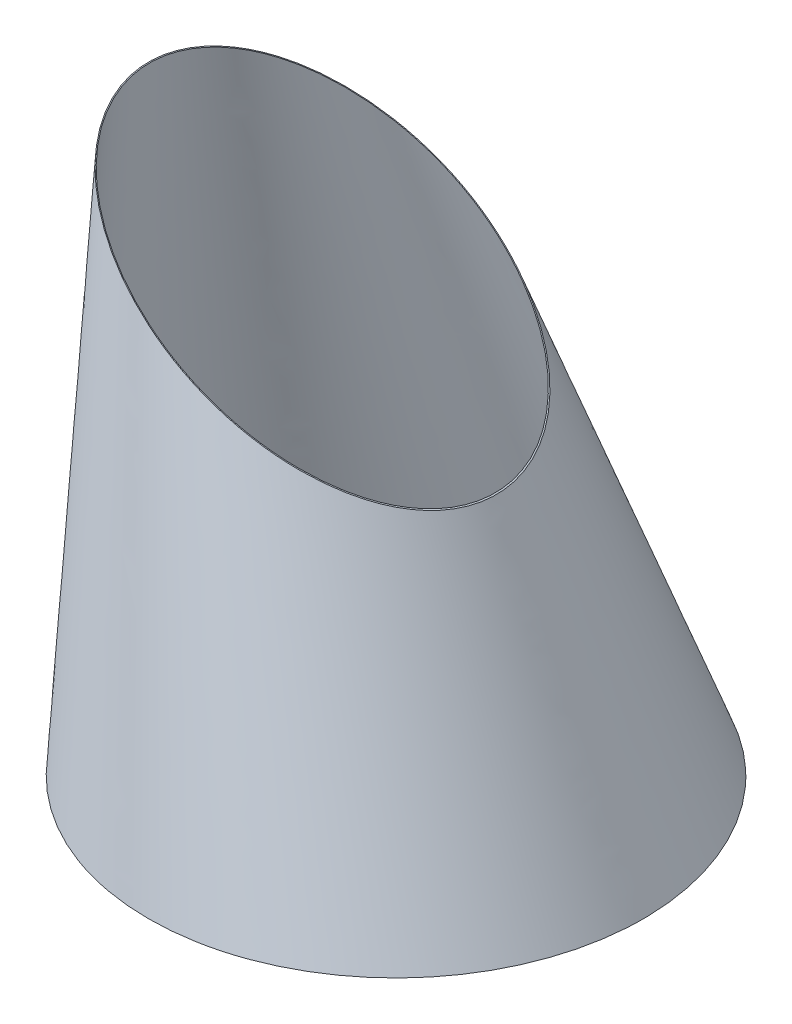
ISO-10303-21;
HEADER;
FILE_DESCRIPTION(('STEP AP214'),'2;1');
FILE_NAME('part.step','',(''),(''),'','','');
FILE_SCHEMA(('AUTOMOTIVE_DESIGN { 1 0 10303 214 1 1 1 1 }'));
ENDSEC;
DATA;
#1=APPLICATION_CONTEXT('core data for automotive mechanical design processes');
#2=APPLICATION_PROTOCOL_DEFINITION('international standard','automotive_design',2000,#1);
#3=PRODUCT_CONTEXT('',#1,'mechanical');
#4=PRODUCT('Part','Part','',(#3));
#5=PRODUCT_RELATED_PRODUCT_CATEGORY('part','',(#4));
#6=PRODUCT_DEFINITION_FORMATION('','',#4);
#7=PRODUCT_DEFINITION_CONTEXT('part definition',#1,'design');
#8=PRODUCT_DEFINITION('design','',#6,#7);
#9=PRODUCT_DEFINITION_SHAPE('','',#8);
#10=(LENGTH_UNIT() NAMED_UNIT(*) SI_UNIT(.MILLI.,.METRE.));
#11=(NAMED_UNIT(*) PLANE_ANGLE_UNIT() SI_UNIT($,.RADIAN.));
#12=(NAMED_UNIT(*) SI_UNIT($,.STERADIAN.) SOLID_ANGLE_UNIT());
#13=UNCERTAINTY_MEASURE_WITH_UNIT(LENGTH_MEASURE(1.E-05),#10,'distance_accuracy_value','');
#14=(GEOMETRIC_REPRESENTATION_CONTEXT(3) GLOBAL_UNCERTAINTY_ASSIGNED_CONTEXT((#13)) GLOBAL_UNIT_ASSIGNED_CONTEXT((#10,
#11,#12)) REPRESENTATION_CONTEXT('',''));
#15=CARTESIAN_POINT('',(0.,0.,0.));
#16=DIRECTION('',(0.,0.,1.));
#17=DIRECTION('',(1.,0.,0.));
#18=AXIS2_PLACEMENT_3D('',#15,#16,#17);
#19=CARTESIAN_POINT('',(-300.,600.,2212.12643875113));
#20=DIRECTION('',(0.500000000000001,0.866025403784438,0.));
#21=DIRECTION('',(-0.866025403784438,0.500000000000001,0.));
#22=AXIS2_PLACEMENT_3D('',#19,#20,#21);
#23=PLANE('',#22);
#24=CARTESIAN_POINT('',(-124.697223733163,498.788894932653,175.302776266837));
#25=CARTESIAN_POINT('',(-126.417622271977,499.78216749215,175.054455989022));
#26=CARTESIAN_POINT('',(-128.136056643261,500.774306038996,174.787935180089));
#27=CARTESIAN_POINT('',(-131.56830063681,502.755913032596,174.218140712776));
#28=CARTESIAN_POINT('',(-133.282110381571,503.745381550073,173.914868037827));
#29=CARTESIAN_POINT('',(-136.704450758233,505.721270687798,173.271646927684));
#30=CARTESIAN_POINT('',(-138.412981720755,506.707691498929,172.931700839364));
#31=CARTESIAN_POINT('',(-141.824213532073,508.677167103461,172.214711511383));
#32=CARTESIAN_POINT('',(-143.526914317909,509.660221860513,171.837667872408));
#33=CARTESIAN_POINT('',(-146.926083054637,511.622732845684,171.046457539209));
#34=CARTESIAN_POINT('',(-148.62255014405,512.602188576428,170.632285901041));
#35=CARTESIAN_POINT('',(-152.008232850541,514.556913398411,169.766471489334));
#36=CARTESIAN_POINT('',(-153.697448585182,515.532182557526,169.314829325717));
#37=CARTESIAN_POINT('',(-158.753178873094,518.451109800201,167.903578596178));
#38=CARTESIAN_POINT('',(-162.108104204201,520.388076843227,166.887569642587));
#39=CARTESIAN_POINT('',(-167.088634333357,523.263587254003,165.256710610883));
#40=CARTESIAN_POINT('',(-168.728627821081,524.210437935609,164.699635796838));
#41=CARTESIAN_POINT('',(-171.998820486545,526.098484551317,163.548248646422));
#42=CARTESIAN_POINT('',(-173.629019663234,527.039680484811,162.953936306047));
#43=CARTESIAN_POINT('',(-176.878703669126,528.915886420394,161.727577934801));
#44=CARTESIAN_POINT('',(-178.498188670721,529.850896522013,161.095532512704));
#45=CARTESIAN_POINT('',(-181.725697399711,531.714299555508,159.793561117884));
#46=CARTESIAN_POINT('',(-183.333721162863,532.642692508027,159.123635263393));
#47=CARTESIAN_POINT('',(-186.540350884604,534.494041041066,157.74433632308));
#48=CARTESIAN_POINT('',(-188.138934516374,535.41698373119,157.034894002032));
#49=CARTESIAN_POINT('',(-191.322670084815,537.255114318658,155.577236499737));
#50=CARTESIAN_POINT('',(-192.907822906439,538.17030272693,154.829023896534));
#51=CARTESIAN_POINT('',(-196.064225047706,539.99265235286,153.293517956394));
#52=CARTESIAN_POINT('',(-197.63547167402,540.899812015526,152.506217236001));
#53=CARTESIAN_POINT('',(-200.762742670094,542.705342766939,150.892187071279));
#54=CARTESIAN_POINT('',(-202.318766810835,543.603713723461,150.065457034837));
#55=CARTESIAN_POINT('',(-205.213456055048,545.274963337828,148.482106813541));
#56=CARTESIAN_POINT('',(-206.554107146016,546.048988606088,147.730323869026));
#57=CARTESIAN_POINT('',(-209.222351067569,547.589499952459,146.19650223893));
#58=CARTESIAN_POINT('',(-210.549944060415,548.355986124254,145.414463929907));
#59=CARTESIAN_POINT('',(-213.191389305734,549.881025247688,143.819784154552));
#60=CARTESIAN_POINT('',(-214.505240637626,550.639577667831,143.007140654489));
#61=CARTESIAN_POINT('',(-217.118285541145,552.148219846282,141.350974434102));
#62=CARTESIAN_POINT('',(-218.417478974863,552.898309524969,140.507451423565));
#63=CARTESIAN_POINT('',(-221.000919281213,554.389859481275,138.788999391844));
#64=CARTESIAN_POINT('',(-222.285159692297,555.131316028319,137.914057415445));
#65=CARTESIAN_POINT('',(-224.837274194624,556.60478002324,136.132979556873));
#66=CARTESIAN_POINT('',(-226.105148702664,557.336787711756,135.22684447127));
#67=CARTESIAN_POINT('',(-228.623510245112,558.790764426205,133.383081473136));
#68=CARTESIAN_POINT('',(-229.87399827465,559.512734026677,132.445455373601));
#69=CARTESIAN_POINT('',(-232.356794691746,560.94617720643,130.538347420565));
#70=CARTESIAN_POINT('',(-233.589101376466,561.657649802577,129.568862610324));
#71=CARTESIAN_POINT('',(-236.033004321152,563.068637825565,127.599169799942));
#72=CARTESIAN_POINT('',(-237.244623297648,563.768166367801,126.598999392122));
#73=CARTESIAN_POINT('',(-239.647621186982,565.15553784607,124.566641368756));
#74=CARTESIAN_POINT('',(-240.838999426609,565.843380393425,123.534452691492));
#75=CARTESIAN_POINT('',(-243.200273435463,567.206662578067,121.437897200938));
#76=CARTESIAN_POINT('',(-244.370169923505,567.882102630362,120.373531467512));
#77=CARTESIAN_POINT('',(-246.687304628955,569.219900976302,118.212503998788));
#78=CARTESIAN_POINT('',(-247.834543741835,569.882259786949,117.115843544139));
#79=CARTESIAN_POINT('',(-250.104785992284,571.192984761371,114.890603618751));
#80=CARTESIAN_POINT('',(-251.227798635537,571.841356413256,113.762037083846));
#81=CARTESIAN_POINT('',(-253.448690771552,573.123589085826,111.472562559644));
#82=CARTESIAN_POINT('',(-254.546571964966,573.757451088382,110.311656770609));
#83=CARTESIAN_POINT('',(-256.71575522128,575.009829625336,107.957558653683));
#84=CARTESIAN_POINT('',(-257.7870614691,575.6283485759,106.764371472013));
#85=CARTESIAN_POINT('',(-259.901861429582,576.849328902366,104.345599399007));
#86=CARTESIAN_POINT('',(-260.945354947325,577.451790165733,103.12001428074));
#87=CARTESIAN_POINT('',(-263.751455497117,579.071893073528,99.7334194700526));
#88=CARTESIAN_POINT('',(-265.485179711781,580.072859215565,97.5402849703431));
#89=CARTESIAN_POINT('',(-268.857272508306,582.019737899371,93.0589685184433));
#90=CARTESIAN_POINT('',(-270.495656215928,582.965659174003,90.7708017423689));
#91=CARTESIAN_POINT('',(-273.669100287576,584.797847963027,86.100764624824));
#92=CARTESIAN_POINT('',(-275.20416289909,585.684116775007,83.7188963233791));
#93=CARTESIAN_POINT('',(-278.161469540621,587.391518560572,78.8653991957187));
#94=CARTESIAN_POINT('',(-279.583776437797,588.212687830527,76.3938215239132));
#95=CARTESIAN_POINT('',(-282.307617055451,589.785297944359,71.3631710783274));
#96=CARTESIAN_POINT('',(-283.609144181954,590.536734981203,68.8040935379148));
#97=CARTESIAN_POINT('',(-286.082310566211,591.964618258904,63.6032259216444));
#98=CARTESIAN_POINT('',(-287.253946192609,592.641062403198,60.961433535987));
#99=CARTESIAN_POINT('',(-289.190673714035,593.75923255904,56.2520966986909));
#100=CARTESIAN_POINT('',(-289.985429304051,594.218084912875,54.2007544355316));
#101=CARTESIAN_POINT('',(-291.491510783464,595.087621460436,50.0573916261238));
#102=CARTESIAN_POINT('',(-292.202831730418,595.49830280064,47.9653686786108));
#103=CARTESIAN_POINT('',(-293.538276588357,596.269322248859,43.7445591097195));
#104=CARTESIAN_POINT('',(-294.162402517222,596.629661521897,41.6157733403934));
#105=CARTESIAN_POINT('',(-295.320201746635,597.298117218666,37.3255273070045));
#106=CARTESIAN_POINT('',(-295.853870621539,597.606231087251,35.1640654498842));
#107=CARTESIAN_POINT('',(-296.827224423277,598.168197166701,30.8149597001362));
#108=CARTESIAN_POINT('',(-297.266990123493,598.422096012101,28.6273400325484));
#109=CARTESIAN_POINT('',(-297.854681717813,598.761399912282,25.3289428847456));
#110=CARTESIAN_POINT('',(-298.038596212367,598.867582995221,24.2265732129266));
#111=CARTESIAN_POINT('',(-298.382133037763,599.065924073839,22.0167961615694));
#112=CARTESIAN_POINT('',(-298.541755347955,599.158082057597,20.9093887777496));
#113=CARTESIAN_POINT('',(-298.983834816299,599.413316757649,17.5809093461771));
#114=CARTESIAN_POINT('',(-299.229574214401,599.555194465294,15.3531892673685));
#115=CARTESIAN_POINT('',(-299.621319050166,599.781368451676,10.8864541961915));
#116=CARTESIAN_POINT('',(-299.76734110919,599.865674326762,8.64744114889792));
#117=CARTESIAN_POINT('',(-299.918006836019,599.952661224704,5.12184390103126));
#118=CARTESIAN_POINT('',(-299.956399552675,599.97482727,3.83707119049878));
#119=CARTESIAN_POINT('',(-300.000149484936,600.000086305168,1.26673156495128));
#120=CARTESIAN_POINT('',(-300.005506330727,600.003179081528,-0.0188353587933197));
#121=CARTESIAN_POINT('',(-299.983143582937,599.990267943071,-2.58944717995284));
#122=CARTESIAN_POINT('',(-299.955427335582,599.9742659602,-3.87449211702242));
#123=CARTESIAN_POINT('',(-299.867042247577,599.923236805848,-6.44306778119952));
#124=CARTESIAN_POINT('',(-299.806373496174,599.888209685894,-7.7265985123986));
#125=CARTESIAN_POINT('',(-299.652184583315,599.799188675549,-10.2909541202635));
#126=CARTESIAN_POINT('',(-299.558666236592,599.745195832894,-11.5717791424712));
#127=CARTESIAN_POINT('',(-299.338944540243,599.61833945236,-14.1296841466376));
#128=CARTESIAN_POINT('',(-299.212741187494,599.545475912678,-15.4067641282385));
#129=CARTESIAN_POINT('',(-298.927979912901,599.381068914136,-17.955966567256));
#130=CARTESIAN_POINT('',(-298.769425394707,599.289527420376,-19.2280895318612));
#131=CARTESIAN_POINT('',(-298.420245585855,599.08792836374,-21.7665088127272));
#132=CARTESIAN_POINT('',(-298.229618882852,598.977869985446,-23.0328048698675));
#133=CARTESIAN_POINT('',(-297.816651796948,598.739443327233,-25.5585057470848));
#134=CARTESIAN_POINT('',(-297.594310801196,598.611074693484,-26.8179104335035));
#135=CARTESIAN_POINT('',(-297.118405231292,598.336310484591,-29.3288164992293));
#136=CARTESIAN_POINT('',(-296.864840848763,598.189915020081,-30.5803179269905));
#137=CARTESIAN_POINT('',(-296.326960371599,597.879369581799,-33.074453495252));
#138=CARTESIAN_POINT('',(-296.042644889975,597.715219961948,-34.3170878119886));
#139=CARTESIAN_POINT('',(-295.443785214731,597.369468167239,-36.7925600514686));
#140=CARTESIAN_POINT('',(-295.129241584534,597.187866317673,-38.0253981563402));
#141=CARTESIAN_POINT('',(-294.325217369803,596.723662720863,-41.0220708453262));
#142=CARTESIAN_POINT('',(-293.819777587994,596.431846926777,-42.7802285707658));
#143=CARTESIAN_POINT('',(-292.749156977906,595.813723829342,-46.2721060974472));
#144=CARTESIAN_POINT('',(-292.183974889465,595.48741579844,-48.005825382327));
#145=CARTESIAN_POINT('',(-290.996002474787,594.801539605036,-51.4464366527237));
#146=CARTESIAN_POINT('',(-290.373220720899,594.441976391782,-53.1533325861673));
#147=CARTESIAN_POINT('',(-289.071945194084,593.690684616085,-56.5387929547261));
#148=CARTESIAN_POINT('',(-288.393444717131,593.298952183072,-58.21735395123));
#149=CARTESIAN_POINT('',(-286.98296386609,592.484610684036,-61.5442878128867));
#150=CARTESIAN_POINT('',(-286.250981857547,592.062000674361,-63.1926597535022));
#151=CARTESIAN_POINT('',(-284.735663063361,591.18713096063,-66.4577779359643));
#152=CARTESIAN_POINT('',(-283.95232197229,590.734868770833,-68.0745215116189));
#153=CARTESIAN_POINT('',(-282.33646560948,589.801953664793,-71.2751724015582));
#154=CARTESIAN_POINT('',(-281.503943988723,589.321297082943,-72.8590754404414));
#155=CARTESIAN_POINT('',(-279.79200210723,588.332906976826,-75.9927439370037));
#156=CARTESIAN_POINT('',(-278.912580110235,587.82517245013,-77.5425081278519));
#157=CARTESIAN_POINT('',(-276.744382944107,586.573363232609,-81.2265512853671));
#158=CARTESIAN_POINT('',(-275.433859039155,585.816731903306,-83.3438191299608));
#159=CARTESIAN_POINT('',(-272.730918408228,584.256188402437,-87.5066532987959));
#160=CARTESIAN_POINT('',(-271.338517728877,583.452285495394,-89.5522335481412));
#161=CARTESIAN_POINT('',(-268.476754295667,581.800045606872,-93.571470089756));
#162=CARTESIAN_POINT('',(-267.007364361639,580.951692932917,-95.5451005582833));
#163=CARTESIAN_POINT('',(-263.997517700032,579.213957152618,-99.418829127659));
#164=CARTESIAN_POINT('',(-262.457057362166,578.324571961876,-101.318923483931));
#165=CARTESIAN_POINT('',(-259.307395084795,576.506113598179,-105.048436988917));
#166=CARTESIAN_POINT('',(-257.698069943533,575.576969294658,-106.877717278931));
#167=CARTESIAN_POINT('',(-254.418253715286,573.683366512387,-110.461531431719));
#168=CARTESIAN_POINT('',(-252.747763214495,572.718908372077,-112.216066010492));
#169=CARTESIAN_POINT('',(-249.350360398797,570.757416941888,-115.650647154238));
#170=CARTESIAN_POINT('',(-247.623448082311,569.760383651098,-117.330693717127));
#171=CARTESIAN_POINT('',(-244.11742064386,567.736177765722,-120.616437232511));
#172=CARTESIAN_POINT('',(-242.338305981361,566.709005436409,-122.222134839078));
#173=CARTESIAN_POINT('',(-238.919774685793,564.73531547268,-125.196264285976));
#174=CARTESIAN_POINT('',(-237.285108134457,563.79154029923,-126.571989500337));
#175=CARTESIAN_POINT('',(-233.979949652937,561.88330616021,-129.264713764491));
#176=CARTESIAN_POINT('',(-232.30945827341,560.918847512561,-130.581713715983));
#177=CARTESIAN_POINT('',(-228.934507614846,558.970318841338,-133.15769235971));
#178=CARTESIAN_POINT('',(-227.230038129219,557.986242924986,-134.416653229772));
#179=CARTESIAN_POINT('',(-224.650137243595,556.496736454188,-136.261697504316));
#180=CARTESIAN_POINT('',(-223.786291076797,555.997994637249,-136.869488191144));
#181=CARTESIAN_POINT('',(-222.051150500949,554.996210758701,-138.070725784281));
#182=CARTESIAN_POINT('',(-221.179856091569,554.493168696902,-138.664172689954));
#183=CARTESIAN_POINT('',(-218.554919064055,552.977660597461,-140.423213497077));
#184=CARTESIAN_POINT('',(-216.790446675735,551.958941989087,-141.56734739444));
#185=CARTESIAN_POINT('',(-213.234803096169,549.906090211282,-143.798778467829));
#186=CARTESIAN_POINT('',(-211.443631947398,548.871957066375,-144.886075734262));
#187=CARTESIAN_POINT('',(-207.837169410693,546.789764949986,-147.004413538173));
#188=CARTESIAN_POINT('',(-206.021885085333,545.741710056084,-148.035470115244));
#189=CARTESIAN_POINT('',(-202.368406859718,543.632373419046,-150.042010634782));
#190=CARTESIAN_POINT('',(-200.530212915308,542.571091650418,-151.017494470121));
#191=CARTESIAN_POINT('',(-197.75732423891,540.970163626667,-152.4393832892));
#192=CARTESIAN_POINT('',(-196.830520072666,540.4350729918,-152.906412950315));
#193=CARTESIAN_POINT('',(-194.971859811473,539.361974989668,-153.826872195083));
#194=CARTESIAN_POINT('',(-194.040003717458,538.823967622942,-154.28030178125));
#195=CARTESIAN_POINT('',(-191.237154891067,537.205742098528,-155.620205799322));
#196=CARTESIAN_POINT('',(-189.358832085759,536.121291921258,-156.48632087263));
#197=CARTESIAN_POINT('',(-185.584768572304,533.942335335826,-158.164430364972));
#198=CARTESIAN_POINT('',(-183.689032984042,532.847831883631,-158.97644014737));
#199=CARTESIAN_POINT('',(-180.833144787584,531.19898406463,-160.154674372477));
#200=CARTESIAN_POINT('',(-179.879116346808,530.648175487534,-160.540795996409));
#201=CARTESIAN_POINT('',(-177.967102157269,529.544273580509,-161.299790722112));
#202=CARTESIAN_POINT('',(-177.009116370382,528.99118022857,-161.672663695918));
#203=CARTESIAN_POINT('',(-174.58547247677,527.591888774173,-162.597469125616));
#204=CARTESIAN_POINT('',(-173.117302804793,526.744240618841,-163.140646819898));
#205=CARTESIAN_POINT('',(-170.172798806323,525.044230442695,-164.19661928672));
#206=CARTESIAN_POINT('',(-168.696464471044,524.191868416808,-164.70941402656));
#207=CARTESIAN_POINT('',(-165.736115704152,522.482710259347,-165.704818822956));
#208=CARTESIAN_POINT('',(-164.252100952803,521.625913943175,-166.187427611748));
#209=CARTESIAN_POINT('',(-161.276907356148,519.908185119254,-167.122531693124));
#210=CARTESIAN_POINT('',(-159.785728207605,519.047252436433,-167.575025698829));
#211=CARTESIAN_POINT('',(-156.798605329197,517.322636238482,-168.449726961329));
#212=CARTESIAN_POINT('',(-155.302669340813,516.458957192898,-168.871969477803));
#213=CARTESIAN_POINT('',(-152.30472087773,514.72809084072,-169.686791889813));
#214=CARTESIAN_POINT('',(-150.802708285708,513.86090346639,-170.079371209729));
#215=CARTESIAN_POINT('',(-147.793169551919,512.1233454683,-170.835030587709));
#216=CARTESIAN_POINT('',(-146.285643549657,511.252974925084,-171.198111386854));
#217=CARTESIAN_POINT('',(-143.265559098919,509.509328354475,-171.895024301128));
#218=CARTESIAN_POINT('',(-141.753000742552,508.636052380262,-172.228856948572));
#219=CARTESIAN_POINT('',(-138.723203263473,506.886797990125,-172.867257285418));
#220=CARTESIAN_POINT('',(-137.205963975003,506.010819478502,-173.171823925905));
#221=CARTESIAN_POINT('',(-134.167398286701,504.25650276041,-173.75198036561));
#222=CARTESIAN_POINT('',(-132.646072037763,503.378164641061,-174.027571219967));
#223=CARTESIAN_POINT('',(-129.59969035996,501.619335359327,-174.549742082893));
#224=CARTESIAN_POINT('',(-128.074634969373,500.738844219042,-174.796322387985));
#225=CARTESIAN_POINT('',(-125.021249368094,498.975971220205,-175.260684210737));
#226=CARTESIAN_POINT('',(-123.492919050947,498.093589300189,-175.478464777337));
#227=CARTESIAN_POINT('',(-115.842497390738,493.676616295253,-176.495665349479));
#228=CARTESIAN_POINT('',(-109.697227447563,490.128643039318,-177.079482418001));
#229=CARTESIAN_POINT('',(-100.466626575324,484.799353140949,-177.613090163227));
#230=CARTESIAN_POINT('',(-97.3876130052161,483.021683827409,-177.733939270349));
#231=CARTESIAN_POINT('',(-92.7677823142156,480.354423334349,-177.829652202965));
#232=CARTESIAN_POINT('',(-91.227647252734,479.465225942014,-177.847296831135));
#233=CARTESIAN_POINT('',(-88.1473365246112,477.686807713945,-177.854222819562));
#234=CARTESIAN_POINT('',(-86.6071608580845,476.797586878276,-177.84350425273));
#235=CARTESIAN_POINT('',(-83.5275606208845,475.019578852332,-177.793549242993));
#236=CARTESIAN_POINT('',(-81.9881359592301,474.130791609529,-177.754320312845));
#237=CARTESIAN_POINT('',(-78.9100676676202,472.353668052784,-177.647358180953));
#238=CARTESIAN_POINT('',(-77.3714240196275,471.465331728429,-177.57962567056));
#239=CARTESIAN_POINT('',(-74.2952412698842,469.689296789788,-177.415763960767));
#240=CARTESIAN_POINT('',(-72.7577021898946,468.801598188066,-177.319634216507));
#241=CARTESIAN_POINT('',(-69.6841534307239,467.027083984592,-177.098793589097));
#242=CARTESIAN_POINT('',(-68.1481437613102,466.140268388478,-176.974082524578));
#243=CARTESIAN_POINT('',(-65.0783247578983,464.367907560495,-176.696036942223));
#244=CARTESIAN_POINT('',(-63.5445151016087,463.48236214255,-176.542707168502));
#245=CARTESIAN_POINT('',(-60.4792405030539,461.712625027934,-176.20749059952));
#246=CARTESIAN_POINT('',(-58.9477755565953,460.828433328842,-176.025603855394));
#247=CARTESIAN_POINT('',(-55.887660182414,459.061674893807,-175.633128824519));
#248=CARTESIAN_POINT('',(-54.3590096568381,458.179108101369,-175.422541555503));
#249=CARTESIAN_POINT('',(-51.3048964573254,456.415815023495,-174.972497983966));
#250=CARTESIAN_POINT('',(-49.7794337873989,455.535088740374,-174.733041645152));
#251=CARTESIAN_POINT('',(-46.7308363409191,453.774980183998,-174.225010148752));
#252=CARTESIAN_POINT('',(-45.2077046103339,452.895599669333,-173.956410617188));
#253=CARTESIAN_POINT('',(-42.1654887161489,451.139175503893,-173.390245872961));
#254=CARTESIAN_POINT('',(-40.6464045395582,450.262131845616,-173.092680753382));
#255=CARTESIAN_POINT('',(-37.6125386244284,448.510528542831,-172.468291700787));
#256=CARTESIAN_POINT('',(-36.0977574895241,447.635969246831,-172.141463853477));
#257=CARTESIAN_POINT('',(-33.07316258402,445.889718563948,-171.458422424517));
#258=CARTESIAN_POINT('',(-31.5633488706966,445.018027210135,-171.102208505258));
#259=CARTESIAN_POINT('',(-28.0253872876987,442.975384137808,-170.231427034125));
#260=CARTESIAN_POINT('',(-25.9994423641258,441.80570429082,-169.704847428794));
#261=CARTESIAN_POINT('',(-21.9586480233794,439.47275059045,-168.597901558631));
#262=CARTESIAN_POINT('',(-19.9437987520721,438.309476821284,-168.017534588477));
#263=CARTESIAN_POINT('',(-13.9166693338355,434.829712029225,-166.194438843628));
#264=CARTESIAN_POINT('',(-9.92255728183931,432.523710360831,-164.869899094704));
#265=CARTESIAN_POINT('',(-3.97647286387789,429.090736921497,-162.717641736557));
#266=CARTESIAN_POINT('',(-2.00172267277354,427.950614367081,-161.972547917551));
#267=CARTESIAN_POINT('',(1.93135746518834,425.679849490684,-160.42641515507));
#268=CARTESIAN_POINT('',(3.88968741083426,424.549207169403,-159.625376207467));
#269=CARTESIAN_POINT('',(7.78937873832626,422.297719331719,-157.966385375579));
#270=CARTESIAN_POINT('',(9.73073034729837,421.176879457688,-157.108402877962));
#271=CARTESIAN_POINT('',(13.5938549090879,418.946503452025,-155.335504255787));
#272=CARTESIAN_POINT('',(15.515627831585,417.8369673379,-154.420588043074));
#273=CARTESIAN_POINT('',(19.3375969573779,415.630352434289,-152.533226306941));
#274=CARTESIAN_POINT('',(21.2377958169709,414.533272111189,-151.560787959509));
#275=CARTESIAN_POINT('',(25.0149955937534,412.352504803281,-149.557587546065));
#276=CARTESIAN_POINT('',(26.8919966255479,411.268817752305,-148.526825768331));
#277=CARTESIAN_POINT('',(30.6205074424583,409.116161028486,-146.406623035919));
#278=CARTESIAN_POINT('',(32.4720224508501,408.047188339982,-145.317194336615));
#279=CARTESIAN_POINT('',(36.1479511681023,405.924889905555,-143.078898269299));
#280=CARTESIAN_POINT('',(37.9723643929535,404.871564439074,-141.930029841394));
#281=CARTESIAN_POINT('',(41.9183126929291,402.593370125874,-139.359430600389));
#282=CARTESIAN_POINT('',(44.0340788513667,401.371831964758,-137.925862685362));
#283=CARTESIAN_POINT('',(48.2207888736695,398.954633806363,-134.973829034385));
#284=CARTESIAN_POINT('',(50.2917318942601,397.758974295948,-133.455361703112));
#285=CARTESIAN_POINT('',(54.384625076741,395.395941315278,-130.332677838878));
#286=CARTESIAN_POINT('',(56.4065748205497,394.228568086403,-128.728460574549));
#287=CARTESIAN_POINT('',(60.3968447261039,391.924784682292,-125.433412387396));
#288=CARTESIAN_POINT('',(62.3651655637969,390.788374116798,-123.742582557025));
#289=CARTESIAN_POINT('',(66.2408121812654,388.550768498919,-120.275749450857));
#290=CARTESIAN_POINT('',(68.1482117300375,387.449530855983,-118.499856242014));
#291=CARTESIAN_POINT('',(71.8993515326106,385.2838092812,-114.860358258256));
#292=CARTESIAN_POINT('',(73.7430897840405,384.219326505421,-112.996750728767));
#293=CARTESIAN_POINT('',(77.3608650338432,382.13060299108,-109.181922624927));
#294=CARTESIAN_POINT('',(79.1349123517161,381.106356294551,-107.23071511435));
#295=CARTESIAN_POINT('',(82.6072426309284,379.101605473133,-103.240762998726));
#296=CARTESIAN_POINT('',(84.3055342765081,378.121096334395,-101.202028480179));
#297=CARTESIAN_POINT('',(87.7057102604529,376.158003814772,-96.9296692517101));
#298=CARTESIAN_POINT('',(89.4032431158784,375.177932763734,-94.6914178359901));
#299=CARTESIAN_POINT('',(92.6992340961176,373.274991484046,-90.1199344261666));
#300=CARTESIAN_POINT('',(94.2977020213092,372.352115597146,-87.7867118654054));
#301=CARTESIAN_POINT('',(97.3872313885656,370.568374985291,-83.0271843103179));
#302=CARTESIAN_POINT('',(98.8782934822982,369.707509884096,-80.6008798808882));
#303=CARTESIAN_POINT('',(101.743817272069,368.053098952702,-75.6586367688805));
#304=CARTESIAN_POINT('',(103.118300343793,367.259540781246,-73.1427146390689));
#305=CARTESIAN_POINT('',(105.741978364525,365.74475956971,-68.0249747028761));
#306=CARTESIAN_POINT('',(106.991168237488,365.023539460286,-65.4231534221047));
#307=CARTESIAN_POINT('',(109.354984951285,363.65878924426,-60.1389189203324));
#308=CARTESIAN_POINT('',(110.469608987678,363.015260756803,-57.4565040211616));
#309=CARTESIAN_POINT('',(112.302130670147,361.957253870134,-52.6785723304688));
#310=CARTESIAN_POINT('',(113.05065195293,361.525094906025,-50.5986522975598));
#311=CARTESIAN_POINT('',(114.461660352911,360.710448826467,-46.400033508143));
#312=CARTESIAN_POINT('',(115.124141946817,360.327964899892,-44.2813322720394));
#313=CARTESIAN_POINT('',(116.359606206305,359.614669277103,-40.0093360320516));
#314=CARTESIAN_POINT('',(116.93259065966,359.283856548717,-37.8560417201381));
#315=CARTESIAN_POINT('',(117.722489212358,358.827808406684,-34.6036926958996));
#316=CARTESIAN_POINT('',(117.974205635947,358.682479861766,-33.5157745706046));
#317=CARTESIAN_POINT('',(118.454070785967,358.405429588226,-31.3330308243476));
#318=CARTESIAN_POINT('',(118.682219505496,358.273707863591,-30.2382052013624));
#319=CARTESIAN_POINT('',(119.330423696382,357.899466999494,-26.9464192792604));
#320=CARTESIAN_POINT('',(119.714777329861,357.677560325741,-24.7399288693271));
#321=CARTESIAN_POINT('',(120.38582495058,357.290130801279,-20.3071788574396));
#322=CARTESIAN_POINT('',(120.672513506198,357.124611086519,-18.0809181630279));
#323=CARTESIAN_POINT('',(121.14626328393,356.851091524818,-13.6145072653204));
#324=CARTESIAN_POINT('',(121.333334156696,356.743086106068,-11.3743584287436));
#325=CARTESIAN_POINT('',(121.606856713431,356.585167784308,-6.88620269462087));
#326=CARTESIAN_POINT('',(121.693326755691,356.535244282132,-4.63819730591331));
#327=CARTESIAN_POINT('',(121.749470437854,356.502829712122,-1.11639545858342));
#328=CARTESIAN_POINT('',(121.753546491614,356.500476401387,0.156784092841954));
#329=CARTESIAN_POINT('',(121.729262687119,356.514496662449,2.70271961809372));
#330=CARTESIAN_POINT('',(121.70090246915,356.530870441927,3.97547558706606));
#331=CARTESIAN_POINT('',(121.567296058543,356.608008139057,7.79121940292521));
#332=CARTESIAN_POINT('',(121.41353311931,356.696783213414,10.3322523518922));
#333=CARTESIAN_POINT('',(121.086817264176,356.885412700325,14.1322161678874));
#334=CARTESIAN_POINT('',(120.961896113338,356.957535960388,15.3969686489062));
#335=CARTESIAN_POINT('',(120.680251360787,357.12014363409,17.9217452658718));
#336=CARTESIAN_POINT('',(120.523527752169,357.210628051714,19.181769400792));
#337=CARTESIAN_POINT('',(120.006162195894,357.509329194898,22.95309477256));
#338=CARTESIAN_POINT('',(119.598291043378,357.744813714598,25.4560483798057));
#339=CARTESIAN_POINT('',(118.894591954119,358.15109457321,29.1869072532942));
#340=CARTESIAN_POINT('',(118.644688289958,358.295376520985,30.4266892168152));
#341=CARTESIAN_POINT('',(118.114658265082,358.601389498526,32.8976513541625));
#342=CARTESIAN_POINT('',(117.834532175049,358.763120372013,34.1288316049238));
#343=CARTESIAN_POINT('',(117.244611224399,359.103711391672,36.5816196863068));
#344=CARTESIAN_POINT('',(116.934817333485,359.282570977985,37.8032278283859));
#345=CARTESIAN_POINT('',(116.286127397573,359.657092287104,40.2361257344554));
#346=CARTESIAN_POINT('',(115.947230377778,359.85275457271,41.4474151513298));
#347=CARTESIAN_POINT('',(115.077651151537,360.354806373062,44.4163166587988));
#348=CARTESIAN_POINT('',(114.530734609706,360.670568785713,46.1676227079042));
#349=CARTESIAN_POINT('',(113.37782053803,361.336204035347,49.644161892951));
#350=CARTESIAN_POINT('',(112.771819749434,361.686078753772,51.3693935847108));
#351=CARTESIAN_POINT('',(111.502994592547,362.418635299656,54.7914769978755));
#352=CARTESIAN_POINT('',(110.84017800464,362.801312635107,56.4883325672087));
#353=CARTESIAN_POINT('',(109.459759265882,363.598297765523,59.8522100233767));
#354=CARTESIAN_POINT('',(108.742152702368,364.01260810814,61.5192294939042));
#355=CARTESIAN_POINT('',(107.254249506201,364.871649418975,64.8219280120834));
#356=CARTESIAN_POINT('',(106.483944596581,365.316385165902,66.4576020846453));
#357=CARTESIAN_POINT('',(104.893057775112,366.234884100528,69.6959617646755));
#358=CARTESIAN_POINT('',(104.072476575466,366.708646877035,71.2986478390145));
#359=CARTESIAN_POINT('',(102.383124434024,367.683994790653,74.4701116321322));
#360=CARTESIAN_POINT('',(101.514346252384,368.185584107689,76.0388842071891));
#361=CARTESIAN_POINT('',(99.7309607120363,369.215222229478,79.1411943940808));
#362=CARTESIAN_POINT('',(98.8163543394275,369.743270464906,80.6747327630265));
#363=CARTESIAN_POINT('',(96.5458386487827,371.054153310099,84.349455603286));
#364=CARTESIAN_POINT('',(95.1674407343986,371.849971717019,86.472175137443));
#365=CARTESIAN_POINT('',(92.3281612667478,373.489230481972,90.6428321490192));
#366=CARTESIAN_POINT('',(90.8672731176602,374.332674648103,92.6907636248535));
#367=CARTESIAN_POINT('',(87.8687431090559,376.063876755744,96.7109535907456));
#368=CARTESIAN_POINT('',(86.3310856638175,376.951643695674,98.6831965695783));
#369=CARTESIAN_POINT('',(83.1847745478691,378.768167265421,102.550951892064));
#370=CARTESIAN_POINT('',(81.5761134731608,379.696928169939,104.44645619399));
#371=CARTESIAN_POINT('',(78.290249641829,381.594022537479,108.163621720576));
#372=CARTESIAN_POINT('',(76.6129266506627,382.562425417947,109.985141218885));
#373=CARTESIAN_POINT('',(73.1977223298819,384.534194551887,113.550453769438));
#374=CARTESIAN_POINT('',(71.4598416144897,385.537560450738,115.294247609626));
#375=CARTESIAN_POINT('',(66.1621503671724,388.59618391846,120.409584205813));
#376=CARTESIAN_POINT('',(62.5177192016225,390.700297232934,123.665724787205));
#377=CARTESIAN_POINT('',(57.1034746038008,393.826212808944,128.159167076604));
#378=CARTESIAN_POINT('',(55.4085841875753,394.804758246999,129.519266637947));
#379=CARTESIAN_POINT('',(51.9833019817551,396.78234585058,132.178729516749));
#380=CARTESIAN_POINT('',(50.252910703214,397.781387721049,133.478093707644));
#381=CARTESIAN_POINT('',(46.7587742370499,399.798728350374,136.016835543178));
#382=CARTESIAN_POINT('',(44.9950191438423,400.817032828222,137.256194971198));
#383=CARTESIAN_POINT('',(41.4370211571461,402.871243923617,139.675130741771));
#384=CARTESIAN_POINT('',(39.6427781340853,403.907150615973,140.854706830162));
#385=CARTESIAN_POINT('',(36.0258500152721,405.995385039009,143.154881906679));
#386=CARTESIAN_POINT('',(34.2031609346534,407.047715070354,144.275472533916));
#387=CARTESIAN_POINT('',(30.5317349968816,409.167413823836,146.458197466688));
#388=CARTESIAN_POINT('',(28.6829981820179,410.234782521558,147.520331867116));
#389=CARTESIAN_POINT('',(24.9614868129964,412.383398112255,149.586593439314));
#390=CARTESIAN_POINT('',(23.0887133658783,413.46464436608,150.590723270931));
#391=CARTESIAN_POINT('',(19.3209068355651,415.639988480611,152.541634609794));
#392=CARTESIAN_POINT('',(17.4258737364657,416.734086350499,153.488416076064));
#393=CARTESIAN_POINT('',(13.6157370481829,418.933869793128,155.325175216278));
#394=CARTESIAN_POINT('',(11.7006376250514,420.039552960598,156.21516441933));
#395=CARTESIAN_POINT('',(7.85163121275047,422.261777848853,157.939131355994));
#396=CARTESIAN_POINT('',(5.91772422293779,423.378319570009,158.773109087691));
#397=CARTESIAN_POINT('',(2.03304289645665,425.621141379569,160.385284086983));
#398=CARTESIAN_POINT('',(0.0822723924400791,426.74741925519,161.163493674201));
#399=CARTESIAN_POINT('',(-3.83507322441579,429.00909980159,162.664934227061));
#400=CARTESIAN_POINT('',(-5.80164838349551,430.144502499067,163.388165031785));
#401=CARTESIAN_POINT('',(-9.61564700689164,432.346515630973,164.733240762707));
#402=CARTESIAN_POINT('',(-11.4621329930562,433.41258481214,165.358634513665));
#403=CARTESIAN_POINT('',(-15.1665492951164,435.551330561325,166.562425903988));
#404=CARTESIAN_POINT('',(-17.024479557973,436.624007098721,167.140823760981));
#405=CARTESIAN_POINT('',(-20.7505134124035,438.775233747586,168.250873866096));
#406=CARTESIAN_POINT('',(-22.6186156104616,439.853783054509,168.782532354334));
#407=CARTESIAN_POINT('',(-26.3642147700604,442.016305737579,169.799710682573));
#408=CARTESIAN_POINT('',(-28.2417117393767,443.100279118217,170.285230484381));
#409=CARTESIAN_POINT('',(-32.002942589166,445.271826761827,171.209824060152));
#410=CARTESIAN_POINT('',(-33.8866664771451,446.359395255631,171.648952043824));
#411=CARTESIAN_POINT('',(-37.6616658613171,448.538892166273,172.481548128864));
#412=CARTESIAN_POINT('',(-39.5529413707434,449.630820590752,172.875016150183));
#413=CARTESIAN_POINT('',(-43.3421335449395,451.818511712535,173.61672410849));
#414=CARTESIAN_POINT('',(-45.240050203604,452.914274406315,173.964964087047));
#415=CARTESIAN_POINT('',(-49.0416273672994,455.10911600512,174.61643129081));
#416=CARTESIAN_POINT('',(-50.9452878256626,456.208194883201,174.919658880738));
#417=CARTESIAN_POINT('',(-55.8050628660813,459.013987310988,175.635390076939));
#418=CARTESIAN_POINT('',(-58.7647206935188,460.722746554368,176.016387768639));
#419=CARTESIAN_POINT('',(-63.2106052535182,463.28957920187,176.507744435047));
#420=CARTESIAN_POINT('',(-64.6936159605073,464.145795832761,176.658172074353));
#421=CARTESIAN_POINT('',(-67.6615464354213,465.859331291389,176.932257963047));
#422=CARTESIAN_POINT('',(-69.1464662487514,466.71665014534,177.05591556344));
#423=CARTESIAN_POINT('',(-72.1179903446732,468.432260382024,177.276509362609));
#424=CARTESIAN_POINT('',(-73.6045948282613,469.290551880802,177.373441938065));
#425=CARTESIAN_POINT('',(-76.5789415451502,471.007791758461,177.540740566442));
#426=CARTESIAN_POINT('',(-78.0666837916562,471.866740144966,177.611106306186));
#427=CARTESIAN_POINT('',(-81.0430313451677,473.585135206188,177.725212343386));
#428=CARTESIAN_POINT('',(-82.5316366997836,474.444581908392,177.768950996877));
#429=CARTESIAN_POINT('',(-85.509231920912,476.163697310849,177.829744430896));
#430=CARTESIAN_POINT('',(-86.9982217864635,477.023366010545,177.846799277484));
#431=CARTESIAN_POINT('',(-91.5127598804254,479.629835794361,177.858286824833));
#432=CARTESIAN_POINT('',(-94.5385039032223,481.376749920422,177.811220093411));
#433=CARTESIAN_POINT('',(-99.0747470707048,483.995751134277,177.657985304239));
#434=CARTESIAN_POINT('',(-100.586405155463,484.868507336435,177.593136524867));
#435=CARTESIAN_POINT('',(-103.608677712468,486.613417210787,177.436030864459));
#436=CARTESIAN_POINT('',(-105.119292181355,487.48557088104,177.343773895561));
#437=CARTESIAN_POINT('',(-108.138820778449,489.228896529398,177.131688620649));
#438=CARTESIAN_POINT('',(-109.647735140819,490.100068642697,177.011864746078));
#439=CARTESIAN_POINT('',(-112.663712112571,491.841343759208,176.74463530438));
#440=CARTESIAN_POINT('',(-114.170774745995,492.7114467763,176.597230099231));
#441=CARTESIAN_POINT('',(-117.182631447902,494.450343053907,176.274847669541));
#442=CARTESIAN_POINT('',(-118.687425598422,495.319136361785,176.099871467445));
#443=CARTESIAN_POINT('',(-121.69438589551,497.055205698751,175.722138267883));
#444=CARTESIAN_POINT('',(-123.196552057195,497.922481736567,175.519381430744));
#445=CARTESIAN_POINT('',(-124.697223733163,498.788894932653,175.302776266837));
#446=B_SPLINE_CURVE_WITH_KNOTS('',3,(#24,#25,#26,#27,#28,#29,#30,#31,#32,#33,#34,#35,#36,#37,
#38,#39,#40,#41,#42,#43,#44,#45,#46,#47,#48,#49,#50,#51,#52,#53,#54,#55,#56,#57,#58,#59,#60,#61,
#62,#63,#64,#65,#66,#67,#68,#69,#70,#71,#72,#73,#74,#75,#76,#77,#78,#79,#80,#81,#82,#83,#84,#85,
#86,#87,#88,#89,#90,#91,#92,#93,#94,#95,#96,#97,#98,#99,#100,#101,#102,#103,#104,#105,#106,#107,
#108,#109,#110,#111,#112,#113,#114,#115,#116,#117,#118,#119,#120,#121,#122,#123,#124,#125,#126,
#127,#128,#129,#130,#131,#132,#133,#134,#135,#136,#137,#138,#139,#140,#141,#142,#143,#144,#145,
#146,#147,#148,#149,#150,#151,#152,#153,#154,#155,#156,#157,#158,#159,#160,#161,#162,#163,#164,
#165,#166,#167,#168,#169,#170,#171,#172,#173,#174,#175,#176,#177,#178,#179,#180,#181,#182,#183,
#184,#185,#186,#187,#188,#189,#190,#191,#192,#193,#194,#195,#196,#197,#198,#199,#200,#201,#202,
#203,#204,#205,#206,#207,#208,#209,#210,#211,#212,#213,#214,#215,#216,#217,#218,#219,#220,#221,
#222,#223,#224,#225,#226,#227,#228,#229,#230,#231,#232,#233,#234,#235,#236,#237,#238,#239,#240,
#241,#242,#243,#244,#245,#246,#247,#248,#249,#250,#251,#252,#253,#254,#255,#256,#257,#258,#259,
#260,#261,#262,#263,#264,#265,#266,#267,#268,#269,#270,#271,#272,#273,#274,#275,#276,#277,#278,
#279,#280,#281,#282,#283,#284,#285,#286,#287,#288,#289,#290,#291,#292,#293,#294,#295,#296,#297,
#298,#299,#300,#301,#302,#303,#304,#305,#306,#307,#308,#309,#310,#311,#312,#313,#314,#315,#316,
#317,#318,#319,#320,#321,#322,#323,#324,#325,#326,#327,#328,#329,#330,#331,#332,#333,#334,#335,
#336,#337,#338,#339,#340,#341,#342,#343,#344,#345,#346,#347,#348,#349,#350,#351,#352,#353,#354,
#355,#356,#357,#358,#359,#360,#361,#362,#363,#364,#365,#366,#367,#368,#369,#370,#371,#372,#373,
#374,#375,#376,#377,#378,#379,#380,#381,#382,#383,#384,#385,#386,#387,#388,#389,#390,#391,#392,
#393,#394,#395,#396,#397,#398,#399,#400,#401,#402,#403,#404,#405,#406,#407,#408,#409,#410,#411,
#412,#413,#414,#415,#416,#417,#418,#419,#420,#421,#422,#423,#424,#425,#426,#427,#428,#429,#430,
#431,#432,#433,#434,#435,#436,#437,#438,#439,#440,#441,#442,#443,#444,#445),.UNSPECIFIED.,.T.,
.F.,(4,2,2,2,2,2,2,2,2,2,2,2,2,2,2,2,2,2,2,2,2,2,2,2,2,2,2,2,2,2,2,2,2,2,2,2,2,2,2,2,2,2,2,2,2,
2,2,2,2,2,2,2,2,2,2,2,2,2,2,2,2,2,2,2,2,2,2,2,2,2,2,2,2,2,2,2,2,2,2,2,2,2,2,2,2,2,2,2,2,2,2,2,2,
2,2,2,2,2,2,2,2,2,2,2,2,2,2,2,2,2,2,2,2,2,2,2,2,2,2,2,2,2,2,2,2,2,2,2,2,2,2,2,2,2,2,2,2,2,2,2,2,
2,2,2,2,2,2,2,2,2,2,2,2,2,2,2,2,2,2,2,2,2,2,2,2,2,2,2,2,2,2,2,2,2,2,2,2,2,2,2,2,2,2,2,2,2,2,2,2,
2,2,2,2,2,2,2,2,2,2,2,2,2,2,2,2,2,2,2,2,2,4),(0.,6.00594010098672,12.0117195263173,
18.017114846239,24.022574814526,30.0288356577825,36.0349987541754,48.0461677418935,
53.9676983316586,59.8892295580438,65.8106652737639,71.7320825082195,77.6642223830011,
83.5959683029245,89.528838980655,95.4617987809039,100.624302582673,105.786742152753,
110.949525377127,116.112357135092,121.277342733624,126.442196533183,131.606753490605,
136.771791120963,141.930735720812,147.089851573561,152.24879447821,157.407533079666,
162.564209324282,167.720535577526,172.876044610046,178.031589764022,186.936260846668,
195.839515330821,204.742576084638,213.640637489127,222.539184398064,231.4379800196,
238.177516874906,244.917452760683,251.657232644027,258.397342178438,265.131630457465,
268.499235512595,271.866843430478,278.600863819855,285.333761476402,289.189877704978,
293.046037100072,296.901806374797,300.757565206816,304.613111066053,308.468657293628,
312.323798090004,316.17910869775,320.034493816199,323.889855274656,327.745139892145,
331.600352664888,337.156287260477,342.712339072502,348.267565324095,353.823460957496,
359.379526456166,364.936058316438,370.493309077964,376.050765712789,383.855171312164,
391.65805242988,399.463707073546,407.269758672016,415.090412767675,422.910991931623,
430.731571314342,438.552081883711,445.55804634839,452.563903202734,459.571897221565,
463.075999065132,466.580101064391,473.58921738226,480.598322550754,487.605418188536,
494.612527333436,498.115394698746,501.618261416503,508.623807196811,515.627355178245,
519.129262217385,522.631203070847,527.97146301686,533.311728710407,538.652218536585,
543.992936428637,549.327324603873,554.661816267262,559.996173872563,565.330434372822,
570.66488598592,575.999143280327,581.333346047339,586.667724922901,608.008890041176,
618.679684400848,624.014895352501,629.35009258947,634.68388445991,640.017546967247,
645.351311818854,650.685110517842,656.018025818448,661.35093156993,666.683648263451,
672.016371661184,677.353589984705,682.690791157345,688.028707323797,693.366684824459,
700.559655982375,707.752721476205,722.141505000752,729.337636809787,736.533769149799,
743.733802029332,750.933846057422,758.132993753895,765.33210586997,772.529719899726,
779.727462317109,788.223591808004,796.719881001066,805.216242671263,813.712497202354,
822.198040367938,830.683850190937,839.168398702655,847.651972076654,856.574041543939,
865.495226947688,874.416358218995,883.335850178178,892.255703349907,901.175742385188,
907.930465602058,914.685622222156,921.440643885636,924.818567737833,928.196492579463,
934.945429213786,941.694741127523,948.443399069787,955.190825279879,959.009880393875,
962.828977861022,970.465467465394,974.283887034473,978.102307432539,985.737945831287,
989.556330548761,993.37468107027,997.192906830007,1001.01126052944,1006.59479039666,
1012.17862839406,1017.76170295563,1023.34522764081,1028.92963131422,1034.51395589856,
1040.09912160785,1045.68416719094,1053.64060111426,1061.59767212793,1069.55636520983,
1077.5158901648,1085.49000525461,1093.46403948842,1109.40935128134,1116.55849945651,
1123.70754478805,1130.85874703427,1138.00997968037,1145.16222326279,1152.31445523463,
1159.46635897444,1166.6182678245,1173.76872015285,1180.91917272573,1188.06804080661,
1195.21692981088,1201.8822930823,1208.54762548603,1215.21206665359,1221.87651333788,
1228.53308428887,1235.18966690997,1241.84624341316,1248.50276597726,1258.81685268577,
1263.97377726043,1269.13082684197,1274.28857526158,1279.44638448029,1284.60451211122,
1289.7626269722,1300.24298473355,1305.48297286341,1310.72297779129,1315.96214096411,
1321.20123538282,1326.44013556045,1331.67900550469),.UNSPECIFIED.);
#447=CARTESIAN_POINT('',(-124.697223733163,498.788894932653,175.302776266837));
#448=VERTEX_POINT('',#447);
#449=EDGE_CURVE('E44',#448,#448,#446,.T.);
#450=ORIENTED_EDGE('',*,*,#449,.F.);
#451=EDGE_LOOP('',(#450));
#452=FACE_BOUND('',#451,.T.);
#453=CARTESIAN_POINT('',(-103.499232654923,486.550229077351,-176.395047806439));
#454=CARTESIAN_POINT('',(-102.181155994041,485.789237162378,-176.469903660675));
#455=CARTESIAN_POINT('',(-100.862629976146,485.027985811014,-176.534259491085));
#456=CARTESIAN_POINT('',(-98.224919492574,483.505102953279,-176.641911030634));
#457=CARTESIAN_POINT('',(-96.9057350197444,482.74347144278,-176.685206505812));
#458=CARTESIAN_POINT('',(-94.2669208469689,481.219951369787,-176.750709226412));
#459=CARTESIAN_POINT('',(-92.9472911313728,480.458062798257,-176.772915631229));
#460=CARTESIAN_POINT('',(-90.3078960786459,478.934207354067,-176.796350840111));
#461=CARTESIAN_POINT('',(-88.9881307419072,478.172240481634,-176.797579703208));
#462=CARTESIAN_POINT('',(-86.3480258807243,476.647975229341,-176.779021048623));
#463=CARTESIAN_POINT('',(-85.027686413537,475.885676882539,-176.759222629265));
#464=CARTESIAN_POINT('',(-82.3873704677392,474.361289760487,-176.69851381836));
#465=CARTESIAN_POINT('',(-81.0673939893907,473.599200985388,-176.657603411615));
#466=CARTESIAN_POINT('',(-78.4280736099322,472.07538865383,-176.554708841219));
#467=CARTESIAN_POINT('',(-77.1087297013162,471.313665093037,-176.492724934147));
#468=CARTESIAN_POINT('',(-74.470908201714,469.790718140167,-176.347740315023));
#469=CARTESIAN_POINT('',(-73.152430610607,469.029494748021,-176.264739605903));
#470=CARTESIAN_POINT('',(-70.5162509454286,467.507495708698,-176.077566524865));
#471=CARTESIAN_POINT('',(-69.1985491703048,466.746720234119,-175.973388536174));
#472=CARTESIAN_POINT('',(-66.5645319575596,465.22596968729,-175.743829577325));
#473=CARTESIAN_POINT('',(-65.2482165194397,464.465994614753,-175.618448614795));
#474=CARTESIAN_POINT('',(-62.6172230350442,462.946989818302,-175.346511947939));
#475=CARTESIAN_POINT('',(-61.3025449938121,462.187960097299,-175.199956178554));
#476=CARTESIAN_POINT('',(-58.6750860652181,460.67099597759,-174.88566255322));
#477=CARTESIAN_POINT('',(-57.3623051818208,459.913061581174,-174.717924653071));
#478=CARTESIAN_POINT('',(-54.7363442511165,458.39696233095,-174.360770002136));
#479=CARTESIAN_POINT('',(-53.4231684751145,457.638799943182,-174.171311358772));
#480=CARTESIAN_POINT('',(-50.7992866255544,456.123901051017,-173.770919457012));
#481=CARTESIAN_POINT('',(-49.4885805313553,455.367164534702,-173.559986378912));
#482=CARTESIAN_POINT('',(-46.8699117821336,453.855275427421,-173.116629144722));
#483=CARTESIAN_POINT('',(-45.561949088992,453.100122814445,-172.884205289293));
#484=CARTESIAN_POINT('',(-42.9489968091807,451.591534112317,-172.397854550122));
#485=CARTESIAN_POINT('',(-41.6440073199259,450.838098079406,-172.143926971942));
#486=CARTESIAN_POINT('',(-37.7346089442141,448.581005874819,-171.349757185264));
#487=CARTESIAN_POINT('',(-35.1350656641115,447.080158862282,-170.777008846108));
#488=CARTESIAN_POINT('',(-31.2475643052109,444.835708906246,-169.852379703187));
#489=CARTESIAN_POINT('',(-29.9536843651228,444.088686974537,-169.533248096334));
#490=CARTESIAN_POINT('',(-27.3701121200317,442.597060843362,-168.873132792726));
#491=CARTESIAN_POINT('',(-26.0804198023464,441.852456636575,-168.532149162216));
#492=CARTESIAN_POINT('',(-22.218762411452,439.622927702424,-167.476396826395));
#493=CARTESIAN_POINT('',(-19.6534960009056,438.141870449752,-166.728655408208));
#494=CARTESIAN_POINT('',(-14.5437535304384,435.191759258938,-165.144089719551));
#495=CARTESIAN_POINT('',(-11.9992769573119,433.722705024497,-164.30726765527));
#496=CARTESIAN_POINT('',(-7.52669756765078,431.140460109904,-162.750355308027));
#497=CARTESIAN_POINT('',(-5.5937434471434,430.024468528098,-162.048797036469));
#498=CARTESIAN_POINT('',(-1.74293826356,427.801205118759,-160.59249050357));
#499=CARTESIAN_POINT('',(0.174913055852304,426.693933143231,-159.837743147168));
#500=CARTESIAN_POINT('',(3.99397225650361,424.488998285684,-158.27449991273));
#501=CARTESIAN_POINT('',(5.89518127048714,423.391334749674,-157.466007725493));
#502=CARTESIAN_POINT('',(9.67966154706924,421.206364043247,-155.79480261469));
#503=CARTESIAN_POINT('',(11.5629327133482,420.119056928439,-154.932089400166));
#504=CARTESIAN_POINT('',(15.3102067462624,417.955567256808,-153.151865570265));
#505=CARTESIAN_POINT('',(17.1742074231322,416.879385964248,-152.234348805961));
#506=CARTESIAN_POINT('',(20.8810146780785,414.739259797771,-150.343888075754));
#507=CARTESIAN_POINT('',(22.7238213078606,413.675314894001,-149.370944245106));
#508=CARTESIAN_POINT('',(26.3832329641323,411.562552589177,-147.370800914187));
#509=CARTESIAN_POINT('',(28.1998786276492,410.513711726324,-146.343700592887));
#510=CARTESIAN_POINT('',(31.8084864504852,408.43028102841,-144.23318934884));
#511=CARTESIAN_POINT('',(33.6004485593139,407.3956912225,-143.149778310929));
#512=CARTESIAN_POINT('',(37.1575976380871,405.341970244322,-140.926097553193));
#513=CARTESIAN_POINT('',(38.9227861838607,404.32283816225,-139.785831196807));
#514=CARTESIAN_POINT('',(42.4243328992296,402.301219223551,-137.44773947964));
#515=CARTESIAN_POINT('',(44.1606911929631,401.298732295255,-136.249914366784));
#516=CARTESIAN_POINT('',(47.6019097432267,399.31194383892,-133.79641440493));
#517=CARTESIAN_POINT('',(49.3067782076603,398.327637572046,-132.540754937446));
#518=CARTESIAN_POINT('',(52.6829962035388,396.378377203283,-129.970936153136));
#519=CARTESIAN_POINT('',(54.3543452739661,395.413423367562,-128.656776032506));
#520=CARTESIAN_POINT('',(59.6888966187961,392.333518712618,-124.321232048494));
#521=CARTESIAN_POINT('',(63.2817713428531,390.259171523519,-121.182200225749));
#522=CARTESIAN_POINT('',(68.5125968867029,387.239152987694,-116.251708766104));
#523=CARTESIAN_POINT('',(70.2298881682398,386.247674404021,-114.571114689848));
#524=CARTESIAN_POINT('',(73.6077595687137,384.29745944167,-111.135233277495));
#525=CARTESIAN_POINT('',(75.2683391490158,383.338723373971,-109.379945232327));
#526=CARTESIAN_POINT('',(78.5266072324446,381.457561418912,-105.796253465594));
#527=CARTESIAN_POINT('',(80.1243469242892,380.53510597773,-103.967911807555));
#528=CARTESIAN_POINT('',(83.2533023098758,378.72860274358,-100.237111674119));
#529=CARTESIAN_POINT('',(84.7845244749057,377.844551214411,-98.3346604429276));
#530=CARTESIAN_POINT('',(87.7752455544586,376.11785759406,-94.4562249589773));
#531=CARTESIAN_POINT('',(89.2347512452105,375.27521159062,-92.4802476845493));
#532=CARTESIAN_POINT('',(92.0764868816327,373.634534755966,-88.4557907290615));
#533=CARTESIAN_POINT('',(93.458720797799,372.836501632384,-86.4073147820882));
#534=CARTESIAN_POINT('',(96.9477630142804,370.822102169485,-80.984017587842));
#535=CARTESIAN_POINT('',(98.9898228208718,369.643118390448,-77.5531307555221));
#536=CARTESIAN_POINT('',(102.836187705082,367.422418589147,-70.5176851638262));
#537=CARTESIAN_POINT('',(104.640519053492,366.380687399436,-66.913145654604));
#538=CARTESIAN_POINT('',(107.149056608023,364.932382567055,-61.388250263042));
#539=CARTESIAN_POINT('',(107.952178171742,364.46870011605,-59.5271129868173));
#540=CARTESIAN_POINT('',(109.48969441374,363.581014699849,-55.7671416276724));
#541=CARTESIAN_POINT('',(110.224087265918,363.157012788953,-53.8683065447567));
#542=CARTESIAN_POINT('',(111.621045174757,362.350478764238,-50.0355790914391));
#543=CARTESIAN_POINT('',(112.283604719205,361.967949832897,-48.1016840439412));
#544=CARTESIAN_POINT('',(113.533836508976,361.246128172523,-44.2019997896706));
#545=CARTESIAN_POINT('',(114.121517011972,360.906830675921,-42.236214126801));
#546=CARTESIAN_POINT('',(114.946933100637,360.430276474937,-39.2589155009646));
#547=CARTESIAN_POINT('',(115.213595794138,360.276318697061,-38.257983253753));
#548=CARTESIAN_POINT('',(115.726935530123,359.979941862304,-36.2493410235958));
#549=CARTESIAN_POINT('',(115.973613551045,359.837522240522,-35.2416313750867));
#550=CARTESIAN_POINT('',(116.446684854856,359.564394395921,-33.2198011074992));
#551=CARTESIAN_POINT('',(116.673076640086,359.433687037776,-32.2056800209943));
#552=CARTESIAN_POINT('',(117.105261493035,359.184164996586,-30.1716089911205));
#553=CARTESIAN_POINT('',(117.311054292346,359.065350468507,-29.1516589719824));
#554=CARTESIAN_POINT('',(117.897151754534,358.726966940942,-26.0838969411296));
#555=CARTESIAN_POINT('',(118.246217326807,358.525433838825,-24.0279943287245));
#556=CARTESIAN_POINT('',(118.859092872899,358.171589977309,-19.8993513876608));
#557=CARTESIAN_POINT('',(119.122901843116,358.01927979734,-17.8266108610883));
#558=CARTESIAN_POINT('',(119.563606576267,357.764838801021,-13.6698237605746));
#559=CARTESIAN_POINT('',(119.740543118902,357.662684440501,-11.5857829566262));
#560=CARTESIAN_POINT('',(120.006860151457,357.508926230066,-7.41007824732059));
#561=CARTESIAN_POINT('',(120.096237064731,357.457324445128,-5.31841403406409));
#562=CARTESIAN_POINT('',(120.164198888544,357.418086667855,-2.17923611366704));
#563=CARTESIAN_POINT('',(120.175835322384,357.411368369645,-1.13255099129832));
#564=CARTESIAN_POINT('',(120.177041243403,357.41067213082,0.960836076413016));
#565=CARTESIAN_POINT('',(120.166610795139,357.416694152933,2.00753802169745));
#566=CARTESIAN_POINT('',(120.10227333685,357.453839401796,5.14642083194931));
#567=CARTESIAN_POINT('',(120.0153294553,357.504036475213,7.23780665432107));
#568=CARTESIAN_POINT('',(119.730606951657,357.668421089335,11.7846696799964));
#569=CARTESIAN_POINT('',(119.515864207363,357.79240287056,14.2387379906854));
#570=CARTESIAN_POINT('',(118.966338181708,358.109671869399,19.1286243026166));
#571=CARTESIAN_POINT('',(118.631565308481,358.302953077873,21.5644438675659));
#572=CARTESIAN_POINT('',(117.844750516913,358.757220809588,26.4105362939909));
#573=CARTESIAN_POINT('',(117.392714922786,359.01820368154,28.8208105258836));
#574=CARTESIAN_POINT('',(116.374472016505,359.606086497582,33.6089390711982));
#575=CARTESIAN_POINT('',(115.808263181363,359.932987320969,35.9867929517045));
#576=CARTESIAN_POINT('',(114.565689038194,360.650387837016,40.703978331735));
#577=CARTESIAN_POINT('',(113.889319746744,361.040889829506,43.0433084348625));
#578=CARTESIAN_POINT('',(112.795570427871,361.672366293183,46.5187910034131));
#579=CARTESIAN_POINT('',(112.417766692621,361.89049138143,47.67175801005));
#580=CARTESIAN_POINT('',(111.636318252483,362.341660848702,49.9659569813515));
#581=CARTESIAN_POINT('',(111.232673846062,362.574705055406,51.1071890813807));
#582=CARTESIAN_POINT('',(110.178366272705,363.183409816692,53.9821982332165));
#583=CARTESIAN_POINT('',(109.510684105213,363.568896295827,55.7076887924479));
#584=CARTESIAN_POINT('',(108.118361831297,364.372753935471,59.1278150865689));
#585=CARTESIAN_POINT('',(107.39371835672,364.791127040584,60.8224489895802));
#586=CARTESIAN_POINT('',(105.889835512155,365.659394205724,64.1789334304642));
#587=CARTESIAN_POINT('',(105.110600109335,366.109285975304,65.8407863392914));
#588=CARTESIAN_POINT('',(103.499908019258,367.039219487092,69.1304068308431));
#589=CARTESIAN_POINT('',(102.668450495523,367.51926171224,70.7581738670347));
#590=CARTESIAN_POINT('',(100.955433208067,368.508272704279,73.9788099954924));
#591=CARTESIAN_POINT('',(100.07385870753,369.017249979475,75.5716686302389));
#592=CARTESIAN_POINT('',(98.2631761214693,370.062648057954,78.720902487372));
#593=CARTESIAN_POINT('',(97.3340683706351,370.599068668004,80.2772779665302));
#594=CARTESIAN_POINT('',(95.4305644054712,371.698057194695,83.3529067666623));
#595=CARTESIAN_POINT('',(94.4561630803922,372.260628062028,84.8721558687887));
#596=CARTESIAN_POINT('',(92.4644119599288,373.410566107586,87.8726570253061));
#597=CARTESIAN_POINT('',(91.4470607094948,373.997934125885,89.3539077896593));
#598=CARTESIAN_POINT('',(88.8739520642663,375.483519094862,92.9790057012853));
#599=CARTESIAN_POINT('',(87.2939457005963,376.395736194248,95.0999859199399));
#600=CARTESIAN_POINT('',(84.0516229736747,378.267692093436,99.2564301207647));
#601=CARTESIAN_POINT('',(82.3892993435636,379.227435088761,101.291886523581));
#602=CARTESIAN_POINT('',(78.9883512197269,381.190973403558,105.277164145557));
#603=CARTESIAN_POINT('',(77.2497040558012,382.194781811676,107.226959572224));
#604=CARTESIAN_POINT('',(73.702924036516,384.242516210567,111.039863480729));
#605=CARTESIAN_POINT('',(71.8947928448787,385.286441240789,112.902974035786));
#606=CARTESIAN_POINT('',(66.3674372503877,388.477661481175,118.369653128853));
#607=CARTESIAN_POINT('',(62.5510232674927,390.681069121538,121.843849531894));
#608=CARTESIAN_POINT('',(56.666189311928,394.07867958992,126.797088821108));
#609=CARTESIAN_POINT('',(54.677683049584,395.226744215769,128.405297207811));
#610=CARTESIAN_POINT('',(50.651155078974,397.551461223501,131.53716928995));
#611=CARTESIAN_POINT('',(48.6131340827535,398.728113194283,133.060834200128));
#612=CARTESIAN_POINT('',(44.7075582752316,400.982998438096,135.869219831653));
#613=CARTESIAN_POINT('',(42.844475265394,402.058649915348,137.162262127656));
#614=CARTESIAN_POINT('',(39.0848955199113,404.229244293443,139.681811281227));
#615=CARTESIAN_POINT('',(37.1883992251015,405.324186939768,140.908319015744));
#616=CARTESIAN_POINT('',(33.3641126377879,407.532139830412,143.295959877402));
#617=CARTESIAN_POINT('',(31.4363135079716,408.645155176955,144.45707411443));
#618=CARTESIAN_POINT('',(27.5523884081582,410.887540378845,146.714296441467));
#619=CARTESIAN_POINT('',(25.5962623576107,412.016910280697,147.810404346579));
#620=CARTESIAN_POINT('',(21.6577578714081,414.290806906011,149.938308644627));
#621=CARTESIAN_POINT('',(19.6753771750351,415.435334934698,150.970099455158));
#622=CARTESIAN_POINT('',(15.6866827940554,417.738208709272,152.970048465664));
#623=CARTESIAN_POINT('',(13.6803689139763,418.896554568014,153.938206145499));
#624=CARTESIAN_POINT('',(9.64522251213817,421.226247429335,155.812059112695));
#625=CARTESIAN_POINT('',(7.61638275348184,422.397598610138,156.717733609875));
#626=CARTESIAN_POINT('',(3.53866300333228,424.751871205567,158.466755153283));
#627=CARTESIAN_POINT('',(1.48978301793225,425.934792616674,159.310102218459));
#628=CARTESIAN_POINT('',(-2.62593833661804,428.311005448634,160.934959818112));
#629=CARTESIAN_POINT('',(-4.69277703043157,429.504295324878,161.716479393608));
#630=CARTESIAN_POINT('',(-8.84296532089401,431.900407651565,163.218661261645));
#631=CARTESIAN_POINT('',(-10.926314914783,433.103230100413,163.939323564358));
#632=CARTESIAN_POINT('',(-15.1079562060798,435.517501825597,165.320208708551));
#633=CARTESIAN_POINT('',(-17.2062477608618,436.728951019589,165.980432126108));
#634=CARTESIAN_POINT('',(-21.4163020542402,439.159626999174,167.24085635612));
#635=CARTESIAN_POINT('',(-23.5280648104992,440.378853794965,167.841057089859));
#636=CARTESIAN_POINT('',(-27.8105663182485,442.851357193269,168.994869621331));
#637=CARTESIAN_POINT('',(-29.9815737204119,444.10478890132,169.547151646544));
#638=CARTESIAN_POINT('',(-34.3346614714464,446.618045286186,170.590080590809));
#639=CARTESIAN_POINT('',(-36.5167418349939,447.877869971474,171.080727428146));
#640=CARTESIAN_POINT('',(-40.8905743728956,450.403103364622,172.00073220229));
#641=CARTESIAN_POINT('',(-43.0823265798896,451.668512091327,172.4300899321));
#642=CARTESIAN_POINT('',(-47.4740820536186,454.204093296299,173.228187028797));
#643=CARTESIAN_POINT('',(-49.6740853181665,455.474265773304,173.59692641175));
#644=CARTESIAN_POINT('',(-54.0810883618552,458.018650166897,174.273768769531));
#645=CARTESIAN_POINT('',(-56.2880881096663,459.292862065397,174.581872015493));
#646=CARTESIAN_POINT('',(-59.602797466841,461.206610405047,174.998865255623));
#647=CARTESIAN_POINT('',(-60.7084117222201,461.84493709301,175.130336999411));
#648=CARTESIAN_POINT('',(-62.9209047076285,463.122320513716,175.378308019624));
#649=CARTESIAN_POINT('',(-64.0277834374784,463.761377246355,175.494807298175));
#650=CARTESIAN_POINT('',(-66.243286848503,465.040498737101,175.712855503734));
#651=CARTESIAN_POINT('',(-67.3519121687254,465.680563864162,175.814395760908));
#652=CARTESIAN_POINT('',(-69.5701185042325,466.961245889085,176.002450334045));
#653=CARTESIAN_POINT('',(-70.6796995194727,467.601862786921,176.088964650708));
#654=CARTESIAN_POINT('',(-72.899662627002,468.883559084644,176.246991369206));
#655=CARTESIAN_POINT('',(-74.0100447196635,469.524638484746,176.318503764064));
#656=CARTESIAN_POINT('',(-76.23145431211,470.807169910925,176.446608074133));
#657=CARTESIAN_POINT('',(-77.342481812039,471.448621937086,176.503199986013));
#658=CARTESIAN_POINT('',(-79.565028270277,472.731809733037,176.601455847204));
#659=CARTESIAN_POINT('',(-80.6765472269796,473.373545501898,176.643119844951));
#660=CARTESIAN_POINT('',(-82.8999299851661,474.657216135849,176.711478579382));
#661=CARTESIAN_POINT('',(-84.0117937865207,475.299151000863,176.738173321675));
#662=CARTESIAN_POINT('',(-86.2357115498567,476.583130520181,176.776596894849));
#663=CARTESIAN_POINT('',(-87.3477655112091,477.225175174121,176.788325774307));
#664=CARTESIAN_POINT('',(-89.5719169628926,478.509289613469,176.79688054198));
#665=CARTESIAN_POINT('',(-90.6840144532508,479.151359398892,176.793706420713));
#666=CARTESIAN_POINT('',(-92.9082045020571,480.435496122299,176.772455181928));
#667=CARTESIAN_POINT('',(-94.0202970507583,481.077563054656,176.754376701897));
#668=CARTESIAN_POINT('',(-96.2442224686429,482.361546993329,176.703249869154));
#669=CARTESIAN_POINT('',(-97.3560553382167,483.003463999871,176.67020153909));
#670=CARTESIAN_POINT('',(-99.579322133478,484.287067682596,176.589127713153));
#671=CARTESIAN_POINT('',(-100.690756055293,484.928754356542,176.541102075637));
#672=CARTESIAN_POINT('',(-102.913069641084,486.211807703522,176.430136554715));
#673=CARTESIAN_POINT('',(-104.023949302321,486.853174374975,176.36719659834));
#674=CARTESIAN_POINT('',(-106.454691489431,488.256564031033,176.213055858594));
#675=CARTESIAN_POINT('',(-107.774407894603,489.018502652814,176.118762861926));
#676=CARTESIAN_POINT('',(-110.412565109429,490.541643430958,175.908926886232));
#677=CARTESIAN_POINT('',(-111.731005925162,491.302845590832,175.793384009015));
#678=CARTESIAN_POINT('',(-114.36638243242,492.824380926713,175.541125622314));
#679=CARTESIAN_POINT('',(-115.683318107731,493.58471409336,175.40440988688));
#680=CARTESIAN_POINT('',(-118.315415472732,495.104356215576,175.109707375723));
#681=CARTESIAN_POINT('',(-119.63057714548,495.863665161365,174.951720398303));
#682=CARTESIAN_POINT('',(-122.259038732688,497.381208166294,174.614356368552));
#683=CARTESIAN_POINT('',(-123.572338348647,498.139442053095,174.43497620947));
#684=CARTESIAN_POINT('',(-126.196609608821,499.654565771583,174.05491230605));
#685=CARTESIAN_POINT('',(-127.50758125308,500.411455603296,173.854228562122));
#686=CARTESIAN_POINT('',(-131.436538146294,502.679839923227,173.219952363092));
#687=CARTESIAN_POINT('',(-134.050701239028,504.189127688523,172.754117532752));
#688=CARTESIAN_POINT('',(-137.96270255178,506.447722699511,171.99073090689));
#689=CARTESIAN_POINT('',(-139.265340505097,507.199801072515,171.725455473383));
#690=CARTESIAN_POINT('',(-141.867116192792,508.701936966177,171.173166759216));
#691=CARTESIAN_POINT('',(-143.166254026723,509.451994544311,170.886154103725));
#692=CARTESIAN_POINT('',(-147.058118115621,511.698963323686,169.992548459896));
#693=CARTESIAN_POINT('',(-149.645321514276,513.192685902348,169.353382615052));
#694=CARTESIAN_POINT('',(-153.511958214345,515.425089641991,168.328886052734));
#695=CARTESIAN_POINT('',(-154.798032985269,516.167605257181,167.976562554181));
#696=CARTESIAN_POINT('',(-157.365529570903,517.649950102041,167.249935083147));
#697=CARTESIAN_POINT('',(-158.64695139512,518.389779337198,166.875631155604));
#698=CARTESIAN_POINT('',(-161.204791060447,519.866548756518,166.104898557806));
#699=CARTESIAN_POINT('',(-162.481208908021,520.603488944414,165.708469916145));
#700=CARTESIAN_POINT('',(-165.028688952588,522.0742772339,164.893290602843));
#701=CARTESIAN_POINT('',(-166.299751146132,522.808125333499,164.474539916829));
#702=CARTESIAN_POINT('',(-168.83597429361,524.272414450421,163.614765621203));
#703=CARTESIAN_POINT('',(-170.101136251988,525.002856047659,163.173745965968));
#704=CARTESIAN_POINT('',(-172.625408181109,526.460245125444,162.269252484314));
#705=CARTESIAN_POINT('',(-173.884518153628,527.187192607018,161.805778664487));
#706=CARTESIAN_POINT('',(-177.652244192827,529.362490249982,160.38128164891));
#707=CARTESIAN_POINT('',(-180.151302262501,530.805322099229,159.386167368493));
#708=CARTESIAN_POINT('',(-183.877727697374,532.956774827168,157.825202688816));
#709=CARTESIAN_POINT('',(-185.115955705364,533.671666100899,157.293600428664));
#710=CARTESIAN_POINT('',(-187.584813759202,535.097061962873,156.207301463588));
#711=CARTESIAN_POINT('',(-188.815443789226,535.807566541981,155.652604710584));
#712=CARTESIAN_POINT('',(-191.268603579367,537.223899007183,154.51997830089));
#713=CARTESIAN_POINT('',(-192.491133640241,537.929727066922,153.942049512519));
#714=CARTESIAN_POINT('',(-194.927719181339,539.336490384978,152.762889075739));
#715=CARTESIAN_POINT('',(-196.141774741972,540.03742568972,152.161657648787));
#716=CARTESIAN_POINT('',(-198.987231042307,541.680250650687,150.719685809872));
#717=CARTESIAN_POINT('',(-200.61493980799,542.620008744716,149.869205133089));
#718=CARTESIAN_POINT('',(-203.852725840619,544.489345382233,148.124729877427));
#719=CARTESIAN_POINT('',(-205.462803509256,545.418924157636,147.230736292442));
#720=CARTESIAN_POINT('',(-208.663993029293,547.267131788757,145.399126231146));
#721=CARTESIAN_POINT('',(-210.255107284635,548.18576203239,144.461515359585));
#722=CARTESIAN_POINT('',(-213.417228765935,550.011413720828,142.542078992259));
#723=CARTESIAN_POINT('',(-214.988235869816,550.918435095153,141.560253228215));
#724=CARTESIAN_POINT('',(-218.108788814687,552.720087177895,139.551784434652));
#725=CARTESIAN_POINT('',(-219.658332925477,553.614716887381,138.525137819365));
#726=CARTESIAN_POINT('',(-222.734433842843,555.390704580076,136.426900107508));
#727=CARTESIAN_POINT('',(-224.260990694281,556.272062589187,135.355309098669));
#728=CARTESIAN_POINT('',(-227.287516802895,558.019428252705,133.168128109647));
#729=CARTESIAN_POINT('',(-228.787518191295,558.885454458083,132.052597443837));
#730=CARTESIAN_POINT('',(-231.7612572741,560.60234351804,129.775771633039));
#731=CARTESIAN_POINT('',(-233.234994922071,561.453206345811,128.614476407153));
#732=CARTESIAN_POINT('',(-236.154491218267,563.138778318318,126.245974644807));
#733=CARTESIAN_POINT('',(-237.600250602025,563.973487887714,125.038769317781));
#734=CARTESIAN_POINT('',(-240.461921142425,565.625674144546,122.578068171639));
#735=CARTESIAN_POINT('',(-241.877832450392,566.443150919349,121.324572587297));
#736=CARTESIAN_POINT('',(-244.67746708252,568.059520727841,118.771232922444));
#737=CARTESIAN_POINT('',(-246.061197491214,568.858417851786,117.471399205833));
#738=CARTESIAN_POINT('',(-248.794785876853,570.436655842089,114.825018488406));
#739=CARTESIAN_POINT('',(-250.144643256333,571.215996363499,113.478470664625));
#740=CARTESIAN_POINT('',(-253.015225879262,572.873328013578,110.525666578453));
#741=CARTESIAN_POINT('',(-254.529911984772,573.747832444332,108.911565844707));
#742=CARTESIAN_POINT('',(-257.507436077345,575.466906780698,105.6207266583));
#743=CARTESIAN_POINT('',(-258.970273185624,576.311476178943,103.943987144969));
#744=CARTESIAN_POINT('',(-261.840276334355,577.968473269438,100.528208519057));
#745=CARTESIAN_POINT('',(-263.247444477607,578.780902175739,98.7891717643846));
#746=CARTESIAN_POINT('',(-266.002097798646,580.371302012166,95.2491890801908));
#747=CARTESIAN_POINT('',(-267.349584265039,581.149273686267,93.4482444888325));
#748=CARTESIAN_POINT('',(-269.979637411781,582.667735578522,89.7865312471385));
#749=CARTESIAN_POINT('',(-271.262253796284,583.408254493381,87.9258102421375));
#750=CARTESIAN_POINT('',(-273.759147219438,584.849836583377,84.1445064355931));
#751=CARTESIAN_POINT('',(-274.973432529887,585.550904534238,82.2239309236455));
#752=CARTESIAN_POINT('',(-277.329254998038,586.911039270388,78.3241973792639));
#753=CARTESIAN_POINT('',(-278.470794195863,587.570107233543,76.3450409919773));
#754=CARTESIAN_POINT('',(-280.676354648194,588.84348815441,72.3302215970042));
#755=CARTESIAN_POINT('',(-281.740384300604,589.457805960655,70.2945647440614));
#756=CARTESIAN_POINT('',(-283.890677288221,590.699278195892,65.9585074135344));
#757=CARTESIAN_POINT('',(-284.968147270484,591.321355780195,63.6522751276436));
#758=CARTESIAN_POINT('',(-287.016966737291,592.504242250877,58.9780319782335));
#759=CARTESIAN_POINT('',(-287.988325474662,593.065056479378,56.6100265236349));
#760=CARTESIAN_POINT('',(-289.818869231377,594.121921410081,51.8166991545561));
#761=CARTESIAN_POINT('',(-290.678056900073,594.617973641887,49.3913785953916));
#762=CARTESIAN_POINT('',(-291.87802136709,595.310773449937,45.7156232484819));
#763=CARTESIAN_POINT('',(-292.263150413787,595.53312780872,44.484282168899));
#764=CARTESIAN_POINT('',(-293.003207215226,595.960399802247,42.0095770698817));
#765=CARTESIAN_POINT('',(-293.35813623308,596.165318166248,40.7662135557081));
#766=CARTESIAN_POINT('',(-294.037191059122,596.557370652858,38.2682125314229));
#767=CARTESIAN_POINT('',(-294.361314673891,596.744503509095,37.0135742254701));
#768=CARTESIAN_POINT('',(-294.978058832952,597.10058091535,34.4940737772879));
#769=CARTESIAN_POINT('',(-295.270679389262,597.269525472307,33.2292116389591));
#770=CARTESIAN_POINT('',(-296.100460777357,597.748599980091,29.4205878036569));
#771=CARTESIAN_POINT('',(-296.589615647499,598.031013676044,26.8625158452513));
#772=CARTESIAN_POINT('',(-297.225026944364,598.397868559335,22.9981414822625));
#773=CARTESIAN_POINT('',(-297.420790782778,598.510892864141,21.7023635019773));
#774=CARTESIAN_POINT('',(-297.778542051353,598.717440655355,19.1046199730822));
#775=CARTESIAN_POINT('',(-297.94053134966,598.810965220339,17.8026547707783));
#776=CARTESIAN_POINT('',(-298.230418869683,598.978331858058,15.1935968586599));
#777=CARTESIAN_POINT('',(-298.358315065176,599.052172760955,13.886503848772));
#778=CARTESIAN_POINT('',(-298.579663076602,599.179968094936,11.2684726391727));
#779=CARTESIAN_POINT('',(-298.67311489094,599.233922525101,9.95753443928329));
#780=CARTESIAN_POINT('',(-298.901551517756,599.365810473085,6.02080299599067));
#781=CARTESIAN_POINT('',(-298.984655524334,599.413790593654,3.39075119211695));
#782=CARTESIAN_POINT('',(-299.011464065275,599.429268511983,-1.87009913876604));
#783=CARTESIAN_POINT('',(-298.955179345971,599.396772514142,-4.50089759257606));
#784=CARTESIAN_POINT('',(-298.766821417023,599.288024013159,-8.44015663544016));
#785=CARTESIAN_POINT('',(-298.686704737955,599.241768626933,-9.75217465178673));
#786=CARTESIAN_POINT('',(-298.491946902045,599.129325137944,-12.3728187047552));
#787=CARTESIAN_POINT('',(-298.377306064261,599.063137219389,-13.6814447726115));
#788=CARTESIAN_POINT('',(-298.113803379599,598.911003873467,-16.2939581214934));
#789=CARTESIAN_POINT('',(-297.964944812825,598.825060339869,-17.5978458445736));
#790=CARTESIAN_POINT('',(-297.633339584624,598.633607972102,-20.199892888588));
#791=CARTESIAN_POINT('',(-297.450591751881,598.528098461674,-21.4980520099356));
#792=CARTESIAN_POINT('',(-296.974041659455,598.25296213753,-24.590350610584));
#793=CARTESIAN_POINT('',(-296.664672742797,598.074347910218,-26.3813198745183));
#794=CARTESIAN_POINT('',(-295.982592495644,597.680548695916,-29.9471526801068));
#795=CARTESIAN_POINT('',(-295.609877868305,597.46536180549,-31.7220153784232));
#796=CARTESIAN_POINT('',(-294.802545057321,596.999247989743,-35.2525887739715));
#797=CARTESIAN_POINT('',(-294.367935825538,596.748326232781,-37.0083022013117));
#798=CARTESIAN_POINT('',(-293.438445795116,596.211684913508,-40.4984818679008));
#799=CARTESIAN_POINT('',(-292.943559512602,595.92596218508,-42.2329461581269));
#800=CARTESIAN_POINT('',(-291.895302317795,595.320750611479,-45.6780767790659));
#801=CARTESIAN_POINT('',(-291.341933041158,595.001262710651,-47.388743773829));
#802=CARTESIAN_POINT('',(-290.178616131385,594.329621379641,-50.7843753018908));
#803=CARTESIAN_POINT('',(-289.56866383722,593.977465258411,-52.4693377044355));
#804=CARTESIAN_POINT('',(-288.294225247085,593.241667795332,-55.8114414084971));
#805=CARTESIAN_POINT('',(-287.629741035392,592.858027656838,-57.468583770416));
#806=CARTESIAN_POINT('',(-286.248271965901,592.06043611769,-60.7535792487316));
#807=CARTESIAN_POINT('',(-285.531282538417,591.646482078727,-62.381429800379));
#808=CARTESIAN_POINT('',(-283.992678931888,590.758168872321,-65.7241304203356));
#809=CARTESIAN_POINT('',(-283.167247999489,590.281606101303,-67.4366386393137));
#810=CARTESIAN_POINT('',(-281.461005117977,589.296506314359,-70.8246273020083));
#811=CARTESIAN_POINT('',(-280.58018820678,588.787966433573,-72.5001044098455));
#812=CARTESIAN_POINT('',(-278.765929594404,587.740503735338,-75.8124337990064));
#813=CARTESIAN_POINT('',(-277.832492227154,587.201583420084,-77.4492892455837));
#814=CARTESIAN_POINT('',(-275.915538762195,586.094829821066,-80.6834790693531));
#815=CARTESIAN_POINT('',(-274.932019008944,585.526994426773,-82.2808105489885));
#816=CARTESIAN_POINT('',(-271.909687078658,583.782050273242,-87.012903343));
#817=CARTESIAN_POINT('',(-269.799381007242,582.563664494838,-90.087256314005));
#818=CARTESIAN_POINT('',(-265.408285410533,580.02846427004,-96.0692007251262));
#819=CARTESIAN_POINT('',(-263.127473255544,578.711636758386,-98.9767699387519));
#820=CARTESIAN_POINT('',(-259.5650097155,576.654847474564,-103.243994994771));
#821=CARTESIAN_POINT('',(-258.339167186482,575.947106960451,-104.666362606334));
#822=CARTESIAN_POINT('',(-255.849916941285,574.509937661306,-107.46666570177));
#823=CARTESIAN_POINT('',(-254.586509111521,573.780508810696,-108.84460105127));
#824=CARTESIAN_POINT('',(-252.023927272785,572.301001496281,-111.556468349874));
#825=CARTESIAN_POINT('',(-250.724740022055,571.550915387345,-112.890383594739));
#826=CARTESIAN_POINT('',(-248.093198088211,570.031593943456,-115.513827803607));
#827=CARTESIAN_POINT('',(-246.760843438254,569.262358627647,-116.80335681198));
#828=CARTESIAN_POINT('',(-244.064753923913,567.705770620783,-119.338194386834));
#829=CARTESIAN_POINT('',(-242.701016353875,566.918416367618,-120.583499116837));
#830=CARTESIAN_POINT('',(-239.944213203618,565.326775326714,-123.029905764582));
#831=CARTESIAN_POINT('',(-238.55114760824,564.522488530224,-124.231007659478));
#832=CARTESIAN_POINT('',(-234.323990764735,562.081938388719,-127.774244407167));
#833=CARTESIAN_POINT('',(-231.448102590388,560.421543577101,-130.050533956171));
#834=CARTESIAN_POINT('',(-227.061738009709,557.889074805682,-133.33384453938));
#835=CARTESIAN_POINT('',(-225.587569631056,557.037963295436,-134.406399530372));
#836=CARTESIAN_POINT('',(-222.616370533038,555.322540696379,-136.508542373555));
#837=CARTESIAN_POINT('',(-221.119339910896,554.458229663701,-137.538130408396));
#838=CARTESIAN_POINT('',(-218.103805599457,552.71721011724,-139.554652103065));
#839=CARTESIAN_POINT('',(-216.585300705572,551.84050090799,-140.541583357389));
#840=CARTESIAN_POINT('',(-213.5281478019,550.075452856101,-142.473028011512));
#841=CARTESIAN_POINT('',(-211.989499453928,549.187113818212,-143.417540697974));
#842=CARTESIAN_POINT('',(-209.4106173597,547.698195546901,-144.956119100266));
#843=CARTESIAN_POINT('',(-208.375587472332,547.100620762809,-145.561852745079));
#844=CARTESIAN_POINT('',(-206.29757340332,545.900878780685,-146.754863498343));
#845=CARTESIAN_POINT('',(-205.254589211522,545.298711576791,-147.342140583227));
#846=CARTESIAN_POINT('',(-203.160977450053,544.089964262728,-148.498288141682));
#847=CARTESIAN_POINT('',(-202.110349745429,543.483384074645,-149.067158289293));
#848=CARTESIAN_POINT('',(-200.001785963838,542.26600420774,-150.186597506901));
#849=CARTESIAN_POINT('',(-198.94384976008,541.655204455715,-150.737166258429));
#850=CARTESIAN_POINT('',(-196.820780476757,540.42944983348,-151.82026980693));
#851=CARTESIAN_POINT('',(-195.755645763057,539.814494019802,-152.352800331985));
#852=CARTESIAN_POINT('',(-193.61874619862,538.580754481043,-153.399857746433));
#853=CARTESIAN_POINT('',(-192.546981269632,537.961970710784,-153.914384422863));
#854=CARTESIAN_POINT('',(-190.397052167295,536.720708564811,-154.9254823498));
#855=CARTESIAN_POINT('',(-189.318887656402,536.098229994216,-155.422052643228));
#856=CARTESIAN_POINT('',(-187.156510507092,534.849780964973,-156.397296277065));
#857=CARTESIAN_POINT('',(-186.072297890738,534.223810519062,-156.875969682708));
#858=CARTESIAN_POINT('',(-183.897916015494,532.968430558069,-157.815648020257));
#859=CARTESIAN_POINT('',(-182.80774568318,532.339020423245,-158.276649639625));
#860=CARTESIAN_POINT('',(-180.621939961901,531.077044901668,-159.181052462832));
#861=CARTESIAN_POINT('',(-179.526304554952,530.444479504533,-159.624453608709));
#862=CARTESIAN_POINT('',(-177.329865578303,529.176364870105,-160.493648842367));
#863=CARTESIAN_POINT('',(-176.229062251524,528.540815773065,-160.919443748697));
#864=CARTESIAN_POINT('',(-174.022503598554,527.26685854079,-161.753520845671));
#865=CARTESIAN_POINT('',(-172.91674832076,526.628450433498,-162.16180320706));
#866=CARTESIAN_POINT('',(-170.702031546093,525.349783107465,-162.960468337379));
#867=CARTESIAN_POINT('',(-169.59307635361,524.709527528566,-163.35087442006));
#868=CARTESIAN_POINT('',(-167.37075794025,523.426471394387,-164.114484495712));
#869=CARTESIAN_POINT('',(-166.257394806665,522.783670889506,-164.487688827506));
#870=CARTESIAN_POINT('',(-164.026445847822,521.49563190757,-165.216909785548));
#871=CARTESIAN_POINT('',(-162.908859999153,520.850393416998,-165.572926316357));
#872=CARTESIAN_POINT('',(-160.669707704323,519.557618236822,-166.267846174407));
#873=CARTESIAN_POINT('',(-159.548141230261,518.910081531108,-166.606749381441));
#874=CARTESIAN_POINT('',(-156.178386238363,516.964552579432,-167.597877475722));
#875=CARTESIAN_POINT('',(-153.924541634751,515.663294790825,-168.22471688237));
#876=CARTESIAN_POINT('',(-150.533895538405,513.705704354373,-169.114282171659));
#877=CARTESIAN_POINT('',(-149.402028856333,513.052220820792,-169.402356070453));
#878=CARTESIAN_POINT('',(-147.135191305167,511.743461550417,-169.961745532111));
#879=CARTESIAN_POINT('',(-146.000220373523,511.08818577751,-170.233060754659));
#880=CARTESIAN_POINT('',(-140.320147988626,507.808794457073,-171.547392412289));
#881=CARTESIAN_POINT('',(-135.752474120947,505.171646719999,-172.465418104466));
#882=CARTESIAN_POINT('',(-130.022294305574,501.863325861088,-173.447971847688));
#883=CARTESIAN_POINT('',(-128.874777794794,501.20080689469,-173.636302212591));
#884=CARTESIAN_POINT('',(-126.577812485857,499.874653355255,-173.996481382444));
#885=CARTESIAN_POINT('',(-125.428363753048,499.211018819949,-174.168330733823));
#886=CARTESIAN_POINT('',(-123.127743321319,497.882754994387,-174.495667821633));
#887=CARTESIAN_POINT('',(-121.976571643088,497.218125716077,-174.651155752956));
#888=CARTESIAN_POINT('',(-119.672654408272,495.887958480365,-174.945715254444));
#889=CARTESIAN_POINT('',(-118.519908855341,495.222420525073,-175.084786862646));
#890=CARTESIAN_POINT('',(-116.21326893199,493.890681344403,-175.346543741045));
#891=CARTESIAN_POINT('',(-115.05937485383,493.224480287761,-175.469232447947));
#892=CARTESIAN_POINT('',(-112.750402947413,491.89139473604,-175.698353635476));
#893=CARTESIAN_POINT('',(-111.595325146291,491.224510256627,-175.804786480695));
#894=CARTESIAN_POINT('',(-109.283916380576,489.890017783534,-176.001357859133));
#895=CARTESIAN_POINT('',(-108.127585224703,489.222409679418,-176.091493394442));
#896=CARTESIAN_POINT('',(-105.814029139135,487.886677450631,-176.255468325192));
#897=CARTESIAN_POINT('',(-104.656804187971,487.218553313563,-176.329307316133));
#898=CARTESIAN_POINT('',(-103.499232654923,486.550229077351,-176.395047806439));
#899=B_SPLINE_CURVE_WITH_KNOTS('',3,(#453,#454,#455,#456,#457,#458,#459,#460,#461,#462,#463,
#464,#465,#466,#467,#468,#469,#470,#471,#472,#473,#474,#475,#476,#477,#478,#479,#480,#481,#482,
#483,#484,#485,#486,#487,#488,#489,#490,#491,#492,#493,#494,#495,#496,#497,#498,#499,#500,#501,
#502,#503,#504,#505,#506,#507,#508,#509,#510,#511,#512,#513,#514,#515,#516,#517,#518,#519,#520,
#521,#522,#523,#524,#525,#526,#527,#528,#529,#530,#531,#532,#533,#534,#535,#536,#537,#538,#539,
#540,#541,#542,#543,#544,#545,#546,#547,#548,#549,#550,#551,#552,#553,#554,#555,#556,#557,#558,
#559,#560,#561,#562,#563,#564,#565,#566,#567,#568,#569,#570,#571,#572,#573,#574,#575,#576,#577,
#578,#579,#580,#581,#582,#583,#584,#585,#586,#587,#588,#589,#590,#591,#592,#593,#594,#595,#596,
#597,#598,#599,#600,#601,#602,#603,#604,#605,#606,#607,#608,#609,#610,#611,#612,#613,#614,#615,
#616,#617,#618,#619,#620,#621,#622,#623,#624,#625,#626,#627,#628,#629,#630,#631,#632,#633,#634,
#635,#636,#637,#638,#639,#640,#641,#642,#643,#644,#645,#646,#647,#648,#649,#650,#651,#652,#653,
#654,#655,#656,#657,#658,#659,#660,#661,#662,#663,#664,#665,#666,#667,#668,#669,#670,#671,#672,
#673,#674,#675,#676,#677,#678,#679,#680,#681,#682,#683,#684,#685,#686,#687,#688,#689,#690,#691,
#692,#693,#694,#695,#696,#697,#698,#699,#700,#701,#702,#703,#704,#705,#706,#707,#708,#709,#710,
#711,#712,#713,#714,#715,#716,#717,#718,#719,#720,#721,#722,#723,#724,#725,#726,#727,#728,#729,
#730,#731,#732,#733,#734,#735,#736,#737,#738,#739,#740,#741,#742,#743,#744,#745,#746,#747,#748,
#749,#750,#751,#752,#753,#754,#755,#756,#757,#758,#759,#760,#761,#762,#763,#764,#765,#766,#767,
#768,#769,#770,#771,#772,#773,#774,#775,#776,#777,#778,#779,#780,#781,#782,#783,#784,#785,#786,
#787,#788,#789,#790,#791,#792,#793,#794,#795,#796,#797,#798,#799,#800,#801,#802,#803,#804,#805,
#806,#807,#808,#809,#810,#811,#812,#813,#814,#815,#816,#817,#818,#819,#820,#821,#822,#823,#824,
#825,#826,#827,#828,#829,#830,#831,#832,#833,#834,#835,#836,#837,#838,#839,#840,#841,#842,#843,
#844,#845,#846,#847,#848,#849,#850,#851,#852,#853,#854,#855,#856,#857,#858,#859,#860,#861,#862,
#863,#864,#865,#866,#867,#868,#869,#870,#871,#872,#873,#874,#875,#876,#877,#878,#879,#880,#881,
#882,#883,#884,#885,#886,#887,#888,#889,#890,#891,#892,#893,#894,#895,#896,#897,#898),
.UNSPECIFIED.,.T.,.F.,(4,2,2,2,2,2,2,2,2,2,2,2,2,2,2,2,2,2,2,2,2,2,2,2,2,2,2,2,2,2,2,2,2,2,2,2,
2,2,2,2,2,2,2,2,2,2,2,2,2,2,2,2,2,2,2,2,2,2,2,2,2,2,2,2,2,2,2,2,2,2,2,2,2,2,2,2,2,2,2,2,2,2,2,2,
2,2,2,2,2,2,2,2,2,2,2,2,2,2,2,2,2,2,2,2,2,2,2,2,2,2,2,2,2,2,2,2,2,2,2,2,2,2,2,2,2,2,2,2,2,2,2,2,
2,2,2,2,2,2,2,2,2,2,2,2,2,2,2,2,2,2,2,2,2,2,2,2,2,2,2,2,2,2,2,2,2,2,2,2,2,2,2,2,2,2,2,2,2,2,2,2,
2,2,2,2,2,2,2,2,2,2,2,2,2,2,2,2,2,2,2,2,2,2,2,2,2,2,2,2,2,2,2,2,2,2,2,2,2,2,2,2,2,2,4),(0.,
4.57143841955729,9.14292762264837,13.7145990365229,18.2862575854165,22.8602874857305,
27.4343206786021,32.0082981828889,36.5822750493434,41.1574666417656,45.7326565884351,
50.3078605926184,54.8830741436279,59.4672652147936,64.0514178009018,68.635506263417,
73.2197428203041,82.3857503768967,86.9688614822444,91.5519586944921,100.715604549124,
109.879023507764,116.897328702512,123.915514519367,130.933218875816,137.950960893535,
144.969491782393,151.988005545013,158.99408458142,166.000177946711,173.005857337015,
180.011506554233,187.015303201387,194.0191961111,209.610443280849,217.406992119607,
225.203614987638,232.993749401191,240.783124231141,248.57176165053,256.359998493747,
268.8368796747,281.312380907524,287.548991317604,293.785767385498,300.023021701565,
306.259587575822,309.401031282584,312.542321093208,315.683842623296,318.825405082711,
325.107975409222,331.39061968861,337.670311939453,343.95026069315,347.090308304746,
350.230346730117,356.509140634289,363.904795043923,371.299808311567,378.694422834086,
386.08913600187,393.484116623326,397.181986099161,400.879812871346,406.547997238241,
412.216517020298,417.884625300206,423.552824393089,429.222698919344,434.892533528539,
440.563009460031,446.233677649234,454.623523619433,463.014111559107,471.407208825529,
479.800105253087,496.61420897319,505.022828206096,513.431326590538,520.960156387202,
528.488886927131,536.019781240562,543.550696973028,551.082265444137,558.613895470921,
566.148019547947,573.682141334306,581.215159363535,588.748176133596,596.281121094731,
603.814075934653,611.5142310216,619.214396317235,626.914587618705,634.614776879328,
642.3149317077,646.165075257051,650.015218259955,653.86758399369,657.719949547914,
661.572316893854,665.424685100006,669.277040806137,673.129395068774,676.981736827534,
680.834081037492,684.686777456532,688.539468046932,692.392195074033,696.244940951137,
700.825163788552,705.405364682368,709.985614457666,714.565907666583,719.146866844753,
723.727825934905,732.889270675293,737.471250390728,742.053098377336,751.216701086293,
755.795333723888,760.373957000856,764.952574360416,769.53119466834,774.109004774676,
778.686813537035,787.842265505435,792.418349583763,796.994443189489,801.570365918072,
806.146245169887,812.334622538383,818.522858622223,824.710301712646,830.897782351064,
837.085758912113,843.273723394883,849.453603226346,855.63349398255,861.813222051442,
867.992918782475,874.171241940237,880.349673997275,887.488087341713,894.626621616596,
901.764885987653,908.902996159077,916.035551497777,923.167241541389,930.298731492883,
937.429447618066,945.287168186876,953.144203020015,961.00105224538,964.928180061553,
968.85514354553,972.782386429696,976.709627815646,984.563253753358,988.508845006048,
992.454217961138,996.399825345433,1000.3454329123,1008.23561620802,1016.12519121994,
1020.07051006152,1024.01579244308,1027.9606967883,1031.90573750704,1037.38284542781,
1042.86023849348,1048.33684016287,1053.81394045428,1059.29088760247,1064.76828631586,
1070.24547577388,1075.7231424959,1081.60133240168,1087.48004969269,1093.35828350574,
1099.23694699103,1110.99607083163,1122.75675813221,1128.77595348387,1134.79516703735,
1140.81663902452,1146.83810499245,1152.86009205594,1158.88208223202,1170.95352500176,
1176.98891180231,1183.02427294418,1189.05997398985,1195.09577649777,1199.11529174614,
1203.13481212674,1207.15440364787,1211.17406507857,1215.19467190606,1219.21532627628,
1223.23619463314,1227.25704833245,1231.27865208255,1235.30026907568,1239.32169888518,
1243.34308947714,1247.35907670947,1251.37498480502,1255.39091519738,1259.40687379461,
1267.43662983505,1271.45154165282,1275.46653497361,1291.51833117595,1295.53338199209,
1299.54829964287,1303.56316946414,1307.57802998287,1311.59204696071,1315.60597389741,
1319.62063845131,1323.63540264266),.UNSPECIFIED.);
#900=CARTESIAN_POINT('',(-124.768085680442,498.829807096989,174.261771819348));
#901=VERTEX_POINT('',#900);
#902=EDGE_CURVE('E97',#901,#901,#899,.T.);
#903=ORIENTED_EDGE('',*,*,#902,.T.);
#904=EDGE_LOOP('',(#903));
#905=FACE_BOUND('',#904,.T.);
#906=ADVANCED_FACE('F37',(#452,#905),#23,.T.);
#907=CARTESIAN_POINT('',(0.,0.,300.));
#908=CARTESIAN_POINT('',(-300.,1200.,0.));
#909=CARTESIAN_POINT('',(4.90468476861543,0.,300.));
#910=CARTESIAN_POINT('',(-300.,1200.,0.));
#911=CARTESIAN_POINT('',(9.9957300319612,0.,299.880199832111));
#912=CARTESIAN_POINT('',(-300.,1200.,0.));
#913=CARTESIAN_POINT('',(20.5742097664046,0.,299.340526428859));
#914=CARTESIAN_POINT('',(-300.,1200.,0.));
#915=CARTESIAN_POINT('',(26.0617238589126,0.,298.920719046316));
#916=CARTESIAN_POINT('',(-300.,1200.,0.));
#917=CARTESIAN_POINT('',(37.4533102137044,0.,297.708010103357));
#918=CARTESIAN_POINT('',(-300.,1200.,0.));
#919=CARTESIAN_POINT('',(43.357495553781,0.,296.915174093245));
#920=CARTESIAN_POINT('',(-300.,1200.,0.));
#921=CARTESIAN_POINT('',(55.5961288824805,0.,294.868722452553));
#922=CARTESIAN_POINT('',(-300.,1200.,0.));
#923=CARTESIAN_POINT('',(61.9307330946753,0.,293.615163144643));
#924=CARTESIAN_POINT('',(-300.,1200.,0.));
#925=CARTESIAN_POINT('',(75.0334435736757,0.,290.543046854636));
#926=CARTESIAN_POINT('',(-300.,1200.,0.));
#927=CARTESIAN_POINT('',(81.8017592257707,0.,288.724521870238));
#928=CARTESIAN_POINT('',(-300.,1200.,0.));
#929=CARTESIAN_POINT('',(95.7592213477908,0.,284.400332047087));
#930=CARTESIAN_POINT('',(-300.,1200.,0.));
#931=CARTESIAN_POINT('',(102.948638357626,0.,281.89465115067));
#932=CARTESIAN_POINT('',(-300.,1200.,0.));
#933=CARTESIAN_POINT('',(117.712549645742,0.,276.05574100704));
#934=CARTESIAN_POINT('',(-300.,1200.,0.));
#935=CARTESIAN_POINT('',(125.287377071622,0.,272.722412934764));
#936=CARTESIAN_POINT('',(-300.,1200.,0.));
#937=CARTESIAN_POINT('',(140.7542134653,0.,265.071108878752));
#938=CARTESIAN_POINT('',(-300.,1200.,0.));
#939=CARTESIAN_POINT('',(148.646605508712,0.,260.752904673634));
#940=CARTESIAN_POINT('',(-300.,1200.,0.));
#941=CARTESIAN_POINT('',(164.637720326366,0.,250.962769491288));
#942=CARTESIAN_POINT('',(-300.,1200.,0.));
#943=CARTESIAN_POINT('',(172.736838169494,0.,245.490425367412));
#944=CARTESIAN_POINT('',(-300.,1200.,0.));
#945=CARTESIAN_POINT('',(188.975745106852,0.,233.220350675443));
#946=CARTESIAN_POINT('',(-300.,1200.,0.));
#947=CARTESIAN_POINT('',(197.115864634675,0.,226.42196859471));
#948=CARTESIAN_POINT('',(-300.,1200.,0.));
#949=CARTESIAN_POINT('',(213.205077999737,0.,211.341351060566));
#950=CARTESIAN_POINT('',(-300.,1200.,0.));
#951=CARTESIAN_POINT('',(221.154311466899,0.,203.058198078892));
#952=CARTESIAN_POINT('',(-300.,1200.,0.));
#953=CARTESIAN_POINT('',(236.556421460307,0.,184.886237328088));
#954=CARTESIAN_POINT('',(-300.,1200.,0.));
#955=CARTESIAN_POINT('',(244.009073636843,0.,174.996282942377));
#956=CARTESIAN_POINT('',(-300.,1200.,0.));
#957=CARTESIAN_POINT('',(254.531978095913,0.,158.916657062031));
#958=CARTESIAN_POINT('',(-300.,1200.,0.));
#959=CARTESIAN_POINT('',(257.929716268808,0.,153.349974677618));
#960=CARTESIAN_POINT('',(-300.,1200.,0.));
#961=CARTESIAN_POINT('',(264.452389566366,0.,141.805807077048));
#962=CARTESIAN_POINT('',(-300.,1200.,0.));
#963=CARTESIAN_POINT('',(267.577290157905,0.,135.828285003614));
#964=CARTESIAN_POINT('',(-300.,1200.,0.));
#965=CARTESIAN_POINT('',(273.498422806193,0.,123.472838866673));
#966=CARTESIAN_POINT('',(-300.,1200.,0.));
#967=CARTESIAN_POINT('',(276.294609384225,0.,117.094882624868));
#968=CARTESIAN_POINT('',(-300.,1200.,0.));
#969=CARTESIAN_POINT('',(281.50083984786,0.,103.957683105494));
#970=CARTESIAN_POINT('',(-300.,1200.,0.));
#971=CARTESIAN_POINT('',(283.910827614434,0.,97.1984156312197));
#972=CARTESIAN_POINT('',(-300.,1200.,0.));
#973=CARTESIAN_POINT('',(288.287103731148,0.,83.3272816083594));
#974=CARTESIAN_POINT('',(-300.,1200.,0.));
#975=CARTESIAN_POINT('',(290.253326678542,0.,76.2154023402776));
#976=CARTESIAN_POINT('',(-300.,1200.,0.));
#977=CARTESIAN_POINT('',(293.686263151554,0.,61.6778731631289));
#978=CARTESIAN_POINT('',(-300.,1200.,0.));
#979=CARTESIAN_POINT('',(295.152904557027,0.,54.2522253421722));
#980=CARTESIAN_POINT('',(-300.,1200.,0.));
#981=CARTESIAN_POINT('',(297.534688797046,0.,39.1363000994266));
#982=CARTESIAN_POINT('',(-300.,1200.,0.));
#983=CARTESIAN_POINT('',(298.449756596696,0.,31.4460422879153));
#984=CARTESIAN_POINT('',(-300.,1200.,0.));
#985=CARTESIAN_POINT('',(299.682448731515,0.,15.8600350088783));
#986=CARTESIAN_POINT('',(-300.,1200.,0.));
#987=CARTESIAN_POINT('',(300.,0.,7.96432428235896));
#988=CARTESIAN_POINT('',(-300.,1200.,0.));
#989=CARTESIAN_POINT('',(300.,0.,-7.96432428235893));
#990=CARTESIAN_POINT('',(-300.,1200.,0.));
#991=CARTESIAN_POINT('',(299.682448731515,0.,-15.8600350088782));
#992=CARTESIAN_POINT('',(-300.,1200.,0.));
#993=CARTESIAN_POINT('',(298.449756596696,0.,-31.4460422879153));
#994=CARTESIAN_POINT('',(-300.,1200.,0.));
#995=CARTESIAN_POINT('',(297.534688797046,0.,-39.1363000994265));
#996=CARTESIAN_POINT('',(-300.,1200.,0.));
#997=CARTESIAN_POINT('',(295.152904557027,0.,-54.2522253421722));
#998=CARTESIAN_POINT('',(-300.,1200.,0.));
#999=CARTESIAN_POINT('',(293.686263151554,0.,-61.6778731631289));
#1000=CARTESIAN_POINT('',(-300.,1200.,0.));
#1001=CARTESIAN_POINT('',(290.253326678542,0.,-76.2154023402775));
#1002=CARTESIAN_POINT('',(-300.,1200.,0.));
#1003=CARTESIAN_POINT('',(288.287103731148,0.,-83.3272816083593));
#1004=CARTESIAN_POINT('',(-300.,1200.,0.));
#1005=CARTESIAN_POINT('',(283.910827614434,0.,-97.1984156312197));
#1006=CARTESIAN_POINT('',(-300.,1200.,0.));
#1007=CARTESIAN_POINT('',(281.50083984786,0.,-103.957683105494));
#1008=CARTESIAN_POINT('',(-300.,1200.,0.));
#1009=CARTESIAN_POINT('',(276.294609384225,0.,-117.094882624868));
#1010=CARTESIAN_POINT('',(-300.,1200.,0.));
#1011=CARTESIAN_POINT('',(273.498422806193,0.,-123.472838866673));
#1012=CARTESIAN_POINT('',(-300.,1200.,0.));
#1013=CARTESIAN_POINT('',(267.577290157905,0.,-135.828285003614));
#1014=CARTESIAN_POINT('',(-300.,1200.,0.));
#1015=CARTESIAN_POINT('',(264.452389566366,0.,-141.805807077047));
#1016=CARTESIAN_POINT('',(-300.,1200.,0.));
#1017=CARTESIAN_POINT('',(257.929716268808,0.,-153.349974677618));
#1018=CARTESIAN_POINT('',(-300.,1200.,0.));
#1019=CARTESIAN_POINT('',(254.531978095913,0.,-158.916657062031));
#1020=CARTESIAN_POINT('',(-300.,1200.,0.));
#1021=CARTESIAN_POINT('',(244.009073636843,0.,-174.996282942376));
#1022=CARTESIAN_POINT('',(-300.,1200.,0.));
#1023=CARTESIAN_POINT('',(236.556421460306,0.,-184.886237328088));
#1024=CARTESIAN_POINT('',(-300.,1200.,0.));
#1025=CARTESIAN_POINT('',(221.154311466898,0.,-203.058198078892));
#1026=CARTESIAN_POINT('',(-300.,1200.,0.));
#1027=CARTESIAN_POINT('',(213.205077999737,0.,-211.341351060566));
#1028=CARTESIAN_POINT('',(-300.,1200.,0.));
#1029=CARTESIAN_POINT('',(197.115864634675,0.,-226.42196859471));
#1030=CARTESIAN_POINT('',(-300.,1200.,0.));
#1031=CARTESIAN_POINT('',(188.975745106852,0.,-233.220350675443));
#1032=CARTESIAN_POINT('',(-300.,1200.,0.));
#1033=CARTESIAN_POINT('',(172.736838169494,0.,-245.490425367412));
#1034=CARTESIAN_POINT('',(-300.,1200.,0.));
#1035=CARTESIAN_POINT('',(164.637720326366,0.,-250.962769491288));
#1036=CARTESIAN_POINT('',(-300.,1200.,0.));
#1037=CARTESIAN_POINT('',(148.646605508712,0.,-260.752904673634));
#1038=CARTESIAN_POINT('',(-300.,1200.,0.));
#1039=CARTESIAN_POINT('',(140.7542134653,0.,-265.071108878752));
#1040=CARTESIAN_POINT('',(-300.,1200.,0.));
#1041=CARTESIAN_POINT('',(125.287377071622,0.,-272.722412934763));
#1042=CARTESIAN_POINT('',(-300.,1200.,0.));
#1043=CARTESIAN_POINT('',(117.712549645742,0.,-276.05574100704));
#1044=CARTESIAN_POINT('',(-300.,1200.,0.));
#1045=CARTESIAN_POINT('',(102.948638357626,0.,-281.89465115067));
#1046=CARTESIAN_POINT('',(-300.,1200.,0.));
#1047=CARTESIAN_POINT('',(95.7592213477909,0.,-284.400332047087));
#1048=CARTESIAN_POINT('',(-300.,1200.,0.));
#1049=CARTESIAN_POINT('',(81.8017592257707,0.,-288.724521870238));
#1050=CARTESIAN_POINT('',(-300.,1200.,0.));
#1051=CARTESIAN_POINT('',(75.0334435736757,0.,-290.543046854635));
#1052=CARTESIAN_POINT('',(-300.,1200.,0.));
#1053=CARTESIAN_POINT('',(61.9307330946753,0.,-293.615163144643));
#1054=CARTESIAN_POINT('',(-300.,1200.,0.));
#1055=CARTESIAN_POINT('',(55.5961288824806,0.,-294.868722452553));
#1056=CARTESIAN_POINT('',(-300.,1200.,0.));
#1057=CARTESIAN_POINT('',(43.3574955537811,0.,-296.915174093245));
#1058=CARTESIAN_POINT('',(-300.,1200.,0.));
#1059=CARTESIAN_POINT('',(37.4533102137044,0.,-297.708010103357));
#1060=CARTESIAN_POINT('',(-300.,1200.,0.));
#1061=CARTESIAN_POINT('',(26.0617238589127,0.,-298.920719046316));
#1062=CARTESIAN_POINT('',(-300.,1200.,0.));
#1063=CARTESIAN_POINT('',(20.5742097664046,0.,-299.340526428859));
#1064=CARTESIAN_POINT('',(-300.,1200.,0.));
#1065=CARTESIAN_POINT('',(9.99573003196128,0.,-299.880199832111));
#1066=CARTESIAN_POINT('',(-300.,1200.,0.));
#1067=CARTESIAN_POINT('',(4.90468476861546,0.,-300.));
#1068=CARTESIAN_POINT('',(-300.,1200.,0.));
#1069=CARTESIAN_POINT('',(-4.9046847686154,0.,-300.));
#1070=CARTESIAN_POINT('',(-300.,1200.,0.));
#1071=CARTESIAN_POINT('',(-9.99573003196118,0.,-299.880199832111));
#1072=CARTESIAN_POINT('',(-300.,1200.,0.));
#1073=CARTESIAN_POINT('',(-20.5742097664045,0.,-299.340526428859));
#1074=CARTESIAN_POINT('',(-300.,1200.,0.));
#1075=CARTESIAN_POINT('',(-26.0617238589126,0.,-298.920719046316));
#1076=CARTESIAN_POINT('',(-300.,1200.,0.));
#1077=CARTESIAN_POINT('',(-37.4533102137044,0.,-297.708010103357));
#1078=CARTESIAN_POINT('',(-300.,1200.,0.));
#1079=CARTESIAN_POINT('',(-43.357495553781,0.,-296.915174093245));
#1080=CARTESIAN_POINT('',(-300.,1200.,0.));
#1081=CARTESIAN_POINT('',(-55.5961288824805,0.,-294.868722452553));
#1082=CARTESIAN_POINT('',(-300.,1200.,0.));
#1083=CARTESIAN_POINT('',(-61.9307330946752,0.,-293.615163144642));
#1084=CARTESIAN_POINT('',(-300.,1200.,0.));
#1085=CARTESIAN_POINT('',(-75.0334435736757,0.,-290.543046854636));
#1086=CARTESIAN_POINT('',(-300.,1200.,0.));
#1087=CARTESIAN_POINT('',(-81.8017592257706,0.,-288.724521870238));
#1088=CARTESIAN_POINT('',(-300.,1200.,0.));
#1089=CARTESIAN_POINT('',(-95.7592213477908,0.,-284.400332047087));
#1090=CARTESIAN_POINT('',(-300.,1200.,0.));
#1091=CARTESIAN_POINT('',(-102.948638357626,0.,-281.89465115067));
#1092=CARTESIAN_POINT('',(-300.,1200.,0.));
#1093=CARTESIAN_POINT('',(-117.712549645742,0.,-276.05574100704));
#1094=CARTESIAN_POINT('',(-300.,1200.,0.));
#1095=CARTESIAN_POINT('',(-125.287377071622,0.,-272.722412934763));
#1096=CARTESIAN_POINT('',(-300.,1200.,0.));
#1097=CARTESIAN_POINT('',(-140.7542134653,0.,-265.071108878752));
#1098=CARTESIAN_POINT('',(-300.,1200.,0.));
#1099=CARTESIAN_POINT('',(-148.646605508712,0.,-260.752904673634));
#1100=CARTESIAN_POINT('',(-300.,1200.,0.));
#1101=CARTESIAN_POINT('',(-164.637720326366,0.,-250.962769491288));
#1102=CARTESIAN_POINT('',(-300.,1200.,0.));
#1103=CARTESIAN_POINT('',(-172.736838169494,0.,-245.490425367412));
#1104=CARTESIAN_POINT('',(-300.,1200.,0.));
#1105=CARTESIAN_POINT('',(-188.975745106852,0.,-233.220350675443));
#1106=CARTESIAN_POINT('',(-300.,1200.,0.));
#1107=CARTESIAN_POINT('',(-197.115864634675,0.,-226.42196859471));
#1108=CARTESIAN_POINT('',(-300.,1200.,0.));
#1109=CARTESIAN_POINT('',(-213.205077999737,0.,-211.341351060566));
#1110=CARTESIAN_POINT('',(-300.,1200.,0.));
#1111=CARTESIAN_POINT('',(-221.154311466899,0.,-203.058198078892));
#1112=CARTESIAN_POINT('',(-300.,1200.,0.));
#1113=CARTESIAN_POINT('',(-236.556421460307,0.,-184.886237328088));
#1114=CARTESIAN_POINT('',(-300.,1200.,0.));
#1115=CARTESIAN_POINT('',(-244.009073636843,0.,-174.996282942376));
#1116=CARTESIAN_POINT('',(-300.,1200.,0.));
#1117=CARTESIAN_POINT('',(-254.531978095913,0.,-158.916657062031));
#1118=CARTESIAN_POINT('',(-300.,1200.,0.));
#1119=CARTESIAN_POINT('',(-257.929716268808,0.,-153.349974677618));
#1120=CARTESIAN_POINT('',(-300.,1200.,0.));
#1121=CARTESIAN_POINT('',(-264.452389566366,0.,-141.805807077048));
#1122=CARTESIAN_POINT('',(-300.,1200.,0.));
#1123=CARTESIAN_POINT('',(-267.577290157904,0.,-135.828285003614));
#1124=CARTESIAN_POINT('',(-300.,1200.,0.));
#1125=CARTESIAN_POINT('',(-273.498422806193,0.,-123.472838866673));
#1126=CARTESIAN_POINT('',(-300.,1200.,0.));
#1127=CARTESIAN_POINT('',(-276.294609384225,0.,-117.094882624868));
#1128=CARTESIAN_POINT('',(-300.,1200.,0.));
#1129=CARTESIAN_POINT('',(-281.50083984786,0.,-103.957683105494));
#1130=CARTESIAN_POINT('',(-300.,1200.,0.));
#1131=CARTESIAN_POINT('',(-283.910827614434,0.,-97.1984156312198));
#1132=CARTESIAN_POINT('',(-300.,1200.,0.));
#1133=CARTESIAN_POINT('',(-288.287103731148,0.,-83.3272816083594));
#1134=CARTESIAN_POINT('',(-300.,1200.,0.));
#1135=CARTESIAN_POINT('',(-290.253326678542,0.,-76.2154023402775));
#1136=CARTESIAN_POINT('',(-300.,1200.,0.));
#1137=CARTESIAN_POINT('',(-293.686263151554,0.,-61.6778731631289));
#1138=CARTESIAN_POINT('',(-300.,1200.,0.));
#1139=CARTESIAN_POINT('',(-295.152904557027,0.,-54.2522253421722));
#1140=CARTESIAN_POINT('',(-300.,1200.,0.));
#1141=CARTESIAN_POINT('',(-297.534688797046,0.,-39.1363000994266));
#1142=CARTESIAN_POINT('',(-300.,1200.,0.));
#1143=CARTESIAN_POINT('',(-298.449756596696,0.,-31.4460422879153));
#1144=CARTESIAN_POINT('',(-300.,1200.,0.));
#1145=CARTESIAN_POINT('',(-299.682448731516,0.,-15.8600350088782));
#1146=CARTESIAN_POINT('',(-300.,1200.,0.));
#1147=CARTESIAN_POINT('',(-300.,0.,-7.96432428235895));
#1148=CARTESIAN_POINT('',(-300.,1200.,0.));
#1149=CARTESIAN_POINT('',(-300.,0.,7.96432428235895));
#1150=CARTESIAN_POINT('',(-300.,1200.,0.));
#1151=CARTESIAN_POINT('',(-299.682448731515,0.,15.8600350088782));
#1152=CARTESIAN_POINT('',(-300.,1200.,0.));
#1153=CARTESIAN_POINT('',(-298.449756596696,0.,31.4460422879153));
#1154=CARTESIAN_POINT('',(-300.,1200.,0.));
#1155=CARTESIAN_POINT('',(-297.534688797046,0.,39.1363000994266));
#1156=CARTESIAN_POINT('',(-300.,1200.,0.));
#1157=CARTESIAN_POINT('',(-295.152904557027,0.,54.2522253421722));
#1158=CARTESIAN_POINT('',(-300.,1200.,0.));
#1159=CARTESIAN_POINT('',(-293.686263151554,0.,61.6778731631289));
#1160=CARTESIAN_POINT('',(-300.,1200.,0.));
#1161=CARTESIAN_POINT('',(-290.253326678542,0.,76.2154023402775));
#1162=CARTESIAN_POINT('',(-300.,1200.,0.));
#1163=CARTESIAN_POINT('',(-288.287103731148,0.,83.3272816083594));
#1164=CARTESIAN_POINT('',(-300.,1200.,0.));
#1165=CARTESIAN_POINT('',(-283.910827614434,0.,97.1984156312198));
#1166=CARTESIAN_POINT('',(-300.,1200.,0.));
#1167=CARTESIAN_POINT('',(-281.50083984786,0.,103.957683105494));
#1168=CARTESIAN_POINT('',(-300.,1200.,0.));
#1169=CARTESIAN_POINT('',(-276.294609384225,0.,117.094882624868));
#1170=CARTESIAN_POINT('',(-300.,1200.,0.));
#1171=CARTESIAN_POINT('',(-273.498422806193,0.,123.472838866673));
#1172=CARTESIAN_POINT('',(-300.,1200.,0.));
#1173=CARTESIAN_POINT('',(-267.577290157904,0.,135.828285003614));
#1174=CARTESIAN_POINT('',(-300.,1200.,0.));
#1175=CARTESIAN_POINT('',(-264.452389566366,0.,141.805807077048));
#1176=CARTESIAN_POINT('',(-300.,1200.,0.));
#1177=CARTESIAN_POINT('',(-257.929716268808,0.,153.349974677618));
#1178=CARTESIAN_POINT('',(-300.,1200.,0.));
#1179=CARTESIAN_POINT('',(-254.531978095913,0.,158.916657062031));
#1180=CARTESIAN_POINT('',(-300.,1200.,0.));
#1181=CARTESIAN_POINT('',(-244.009073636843,0.,174.996282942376));
#1182=CARTESIAN_POINT('',(-300.,1200.,0.));
#1183=CARTESIAN_POINT('',(-236.556421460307,0.,184.886237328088));
#1184=CARTESIAN_POINT('',(-300.,1200.,0.));
#1185=CARTESIAN_POINT('',(-221.154311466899,0.,203.058198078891));
#1186=CARTESIAN_POINT('',(-300.,1200.,0.));
#1187=CARTESIAN_POINT('',(-213.205077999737,0.,211.341351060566));
#1188=CARTESIAN_POINT('',(-300.,1200.,0.));
#1189=CARTESIAN_POINT('',(-197.115864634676,0.,226.421968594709));
#1190=CARTESIAN_POINT('',(-300.,1200.,0.));
#1191=CARTESIAN_POINT('',(-188.975745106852,0.,233.220350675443));
#1192=CARTESIAN_POINT('',(-300.,1200.,0.));
#1193=CARTESIAN_POINT('',(-172.736838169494,0.,245.490425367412));
#1194=CARTESIAN_POINT('',(-300.,1200.,0.));
#1195=CARTESIAN_POINT('',(-164.637720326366,0.,250.962769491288));
#1196=CARTESIAN_POINT('',(-300.,1200.,0.));
#1197=CARTESIAN_POINT('',(-148.646605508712,0.,260.752904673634));
#1198=CARTESIAN_POINT('',(-300.,1200.,0.));
#1199=CARTESIAN_POINT('',(-140.7542134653,0.,265.071108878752));
#1200=CARTESIAN_POINT('',(-300.,1200.,0.));
#1201=CARTESIAN_POINT('',(-125.287377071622,0.,272.722412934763));
#1202=CARTESIAN_POINT('',(-300.,1200.,0.));
#1203=CARTESIAN_POINT('',(-117.712549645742,0.,276.05574100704));
#1204=CARTESIAN_POINT('',(-300.,1200.,0.));
#1205=CARTESIAN_POINT('',(-102.948638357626,0.,281.89465115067));
#1206=CARTESIAN_POINT('',(-300.,1200.,0.));
#1207=CARTESIAN_POINT('',(-95.7592213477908,0.,284.400332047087));
#1208=CARTESIAN_POINT('',(-300.,1200.,0.));
#1209=CARTESIAN_POINT('',(-81.8017592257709,0.,288.724521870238));
#1210=CARTESIAN_POINT('',(-300.,1200.,0.));
#1211=CARTESIAN_POINT('',(-75.0334435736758,0.,290.543046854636));
#1212=CARTESIAN_POINT('',(-300.,1200.,0.));
#1213=CARTESIAN_POINT('',(-61.9307330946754,0.,293.615163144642));
#1214=CARTESIAN_POINT('',(-300.,1200.,0.));
#1215=CARTESIAN_POINT('',(-55.5961288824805,0.,294.868722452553));
#1216=CARTESIAN_POINT('',(-300.,1200.,0.));
#1217=CARTESIAN_POINT('',(-43.3574955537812,0.,296.915174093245));
#1218=CARTESIAN_POINT('',(-300.,1200.,0.));
#1219=CARTESIAN_POINT('',(-37.4533102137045,0.,297.708010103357));
#1220=CARTESIAN_POINT('',(-300.,1200.,0.));
#1221=CARTESIAN_POINT('',(-26.0617238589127,0.,298.920719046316));
#1222=CARTESIAN_POINT('',(-300.,1200.,0.));
#1223=CARTESIAN_POINT('',(-20.5742097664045,0.,299.340526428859));
#1224=CARTESIAN_POINT('',(-300.,1200.,0.));
#1225=CARTESIAN_POINT('',(-9.99573003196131,0.,299.880199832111));
#1226=CARTESIAN_POINT('',(-300.,1200.,0.));
#1227=CARTESIAN_POINT('',(-4.90468476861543,0.,300.));
#1228=CARTESIAN_POINT('',(-300.,1200.,0.));
#1229=CARTESIAN_POINT('',(0.,0.,300.));
#1230=CARTESIAN_POINT('',(-300.,1200.,0.));
#1231=B_SPLINE_SURFACE_WITH_KNOTS('',3,1,((#907,#908),(#909,#910),(#911,#912),(#913,#914),(#915,
#916),(#917,#918),(#919,#920),(#921,#922),(#923,#924),(#925,#926),(#927,#928),(#929,#930),(#931,
#932),(#933,#934),(#935,#936),(#937,#938),(#939,#940),(#941,#942),(#943,#944),(#945,#946),(#947,
#948),(#949,#950),(#951,#952),(#953,#954),(#955,#956),(#957,#958),(#959,#960),(#961,#962),(#963,
#964),(#965,#966),(#967,#968),(#969,#970),(#971,#972),(#973,#974),(#975,#976),(#977,#978),(#979,
#980),(#981,#982),(#983,#984),(#985,#986),(#987,#988),(#989,#990),(#991,#992),(#993,#994),(#995,
#996),(#997,#998),(#999,#1000),(#1001,#1002),(#1003,#1004),(#1005,#1006),(#1007,#1008),(#1009,
#1010),(#1011,#1012),(#1013,#1014),(#1015,#1016),(#1017,#1018),(#1019,#1020),(#1021,#1022),
(#1023,#1024),(#1025,#1026),(#1027,#1028),(#1029,#1030),(#1031,#1032),(#1033,#1034),(#1035,
#1036),(#1037,#1038),(#1039,#1040),(#1041,#1042),(#1043,#1044),(#1045,#1046),(#1047,#1048),
(#1049,#1050),(#1051,#1052),(#1053,#1054),(#1055,#1056),(#1057,#1058),(#1059,#1060),(#1061,
#1062),(#1063,#1064),(#1065,#1066),(#1067,#1068),(#1069,#1070),(#1071,#1072),(#1073,#1074),
(#1075,#1076),(#1077,#1078),(#1079,#1080),(#1081,#1082),(#1083,#1084),(#1085,#1086),(#1087,
#1088),(#1089,#1090),(#1091,#1092),(#1093,#1094),(#1095,#1096),(#1097,#1098),(#1099,#1100),
(#1101,#1102),(#1103,#1104),(#1105,#1106),(#1107,#1108),(#1109,#1110),(#1111,#1112),(#1113,
#1114),(#1115,#1116),(#1117,#1118),(#1119,#1120),(#1121,#1122),(#1123,#1124),(#1125,#1126),
(#1127,#1128),(#1129,#1130),(#1131,#1132),(#1133,#1134),(#1135,#1136),(#1137,#1138),(#1139,
#1140),(#1141,#1142),(#1143,#1144),(#1145,#1146),(#1147,#1148),(#1149,#1150),(#1151,#1152),
(#1153,#1154),(#1155,#1156),(#1157,#1158),(#1159,#1160),(#1161,#1162),(#1163,#1164),(#1165,
#1166),(#1167,#1168),(#1169,#1170),(#1171,#1172),(#1173,#1174),(#1175,#1176),(#1177,#1178),
(#1179,#1180),(#1181,#1182),(#1183,#1184),(#1185,#1186),(#1187,#1188),(#1189,#1190),(#1191,
#1192),(#1193,#1194),(#1195,#1196),(#1197,#1198),(#1199,#1200),(#1201,#1202),(#1203,#1204),
(#1205,#1206),(#1207,#1208),(#1209,#1210),(#1211,#1212),(#1213,#1214),(#1215,#1216),(#1217,
#1218),(#1219,#1220),(#1221,#1222),(#1223,#1224),(#1225,#1226),(#1227,#1228),(#1229,#1230)),
.UNSPECIFIED.,.T.,.F.,.F.,(4,2,2,2,2,2,2,2,2,2,2,2,2,2,2,2,2,2,2,2,2,2,2,2,2,2,2,2,2,2,2,2,2,2,
2,2,2,2,2,2,2,2,2,2,2,2,2,2,2,2,2,2,2,2,2,2,2,2,2,2,2,2,2,2,2,2,2,2,2,2,2,2,2,2,2,2,2,2,2,2,4),
(2,2),(0.,0.015625,0.03125,0.046875,0.0625,0.078125,0.09375,0.109375,0.125,0.140625,0.15625,
0.171875,0.1875,0.1953125,0.203125,0.2109375,0.21875,0.2265625,0.234375,0.2421875,0.25,
0.2578125,0.265625,0.2734375,0.28125,0.2890625,0.296875,0.3046875,0.3125,0.328125,0.34375,
0.359375,0.375,0.390625,0.40625,0.421875,0.4375,0.453125,0.46875,0.484375,0.5,0.515625,0.53125,
0.546875,0.5625,0.578125,0.59375,0.609375,0.625,0.640625,0.65625,0.671875,0.6875,0.6953125,
0.703125,0.7109375,0.71875,0.7265625,0.734375,0.7421875,0.75,0.7578125,0.765625,0.7734375,
0.78125,0.7890625,0.796875,0.8046875,0.8125,0.828125,0.84375,0.859375,0.875,0.890625,0.90625,
0.921875,0.9375,0.953125,0.96875,0.984375,1.),(0.,1.),.UNSPECIFIED.);
#1232=CARTESIAN_POINT('',(0.,0.,0.));
#1233=DIRECTION('',(0.,1.,0.));
#1234=DIRECTION('',(0.,0.,1.));
#1235=AXIS2_PLACEMENT_3D('',#1232,#1233,#1234);
#1236=CIRCLE('',#1235,300.);
#1237=CARTESIAN_POINT('',(0.,0.,300.));
#1238=VERTEX_POINT('',#1237);
#1239=EDGE_CURVE('E11',#1238,#1238,#1236,.T.);
#1240=CARTESIAN_POINT('',(0.,0.,300.));
#1241=CARTESIAN_POINT('',(-1.29892941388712,5.19571765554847,298.701070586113));
#1242=CARTESIAN_POINT('',(-2.59785882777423,10.3914353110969,297.402141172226));
#1243=CARTESIAN_POINT('',(-5.19571765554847,20.7828706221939,294.804282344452));
#1244=CARTESIAN_POINT('',(-6.49464706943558,25.9785882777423,293.505352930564));
#1245=CARTESIAN_POINT('',(-9.09250589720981,36.3700235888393,290.90749410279));
#1246=CARTESIAN_POINT('',(-10.3914353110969,41.5657412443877,289.608564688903));
#1247=CARTESIAN_POINT('',(-12.9892941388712,51.9571765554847,287.010705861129));
#1248=CARTESIAN_POINT('',(-14.2882235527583,57.1528942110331,285.711776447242));
#1249=CARTESIAN_POINT('',(-16.8860823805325,67.5443295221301,283.113917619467));
#1250=CARTESIAN_POINT('',(-18.1850117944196,72.7400471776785,281.81498820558));
#1251=CARTESIAN_POINT('',(-20.7828706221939,83.1314824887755,279.217129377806));
#1252=CARTESIAN_POINT('',(-22.081800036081,88.3272001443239,277.918199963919));
#1253=CARTESIAN_POINT('',(-24.6796588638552,98.7186354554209,275.320341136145));
#1254=CARTESIAN_POINT('',(-25.9785882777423,103.914353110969,274.021411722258));
#1255=CARTESIAN_POINT('',(-28.5764471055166,114.305788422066,271.423552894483));
#1256=CARTESIAN_POINT('',(-29.8753765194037,119.501506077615,270.124623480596));
#1257=CARTESIAN_POINT('',(-32.4732353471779,129.892941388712,267.526764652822));
#1258=CARTESIAN_POINT('',(-33.772164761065,135.08865904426,266.227835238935));
#1259=CARTESIAN_POINT('',(-36.3700235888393,145.480094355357,263.629976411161));
#1260=CARTESIAN_POINT('',(-37.6689530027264,150.675812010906,262.331046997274));
#1261=CARTESIAN_POINT('',(-40.2668118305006,161.067247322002,259.733188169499));
#1262=CARTESIAN_POINT('',(-41.5657412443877,166.262964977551,258.434258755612));
#1263=CARTESIAN_POINT('',(-44.1636000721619,176.654400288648,255.836399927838));
#1264=CARTESIAN_POINT('',(-45.4625294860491,181.850117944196,254.537470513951));
#1265=CARTESIAN_POINT('',(-48.0603883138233,192.241553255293,251.939611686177));
#1266=CARTESIAN_POINT('',(-49.3593177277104,197.437270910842,250.64068227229));
#1267=CARTESIAN_POINT('',(-51.9571765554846,207.828706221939,248.042823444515));
#1268=CARTESIAN_POINT('',(-53.2561059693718,213.024423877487,246.743894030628));
#1269=CARTESIAN_POINT('',(-55.853964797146,223.415859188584,244.146035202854));
#1270=CARTESIAN_POINT('',(-57.1528942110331,228.611576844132,242.847105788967));
#1271=CARTESIAN_POINT('',(-59.7507530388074,239.003012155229,240.249246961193));
#1272=CARTESIAN_POINT('',(-61.0496824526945,244.198729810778,238.950317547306));
#1273=CARTESIAN_POINT('',(-63.6475412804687,254.590165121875,236.352458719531));
#1274=CARTESIAN_POINT('',(-64.9464706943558,259.785882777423,235.053529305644));
#1275=CARTESIAN_POINT('',(-67.54432952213,270.17731808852,232.45567047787));
#1276=CARTESIAN_POINT('',(-68.8432589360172,275.373035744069,231.156741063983));
#1277=CARTESIAN_POINT('',(-71.4411177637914,285.764471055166,228.558882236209));
#1278=CARTESIAN_POINT('',(-72.7400471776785,290.960188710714,227.259952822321));
#1279=CARTESIAN_POINT('',(-75.3379060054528,301.351624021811,224.662093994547));
#1280=CARTESIAN_POINT('',(-76.6368354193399,306.54734167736,223.36316458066));
#1281=CARTESIAN_POINT('',(-79.2346942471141,316.938776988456,220.765305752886));
#1282=CARTESIAN_POINT('',(-80.5336236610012,322.134494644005,219.466376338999));
#1283=CARTESIAN_POINT('',(-83.1314824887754,332.525929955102,216.868517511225));
#1284=CARTESIAN_POINT('',(-84.4304119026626,337.72164761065,215.569588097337));
#1285=CARTESIAN_POINT('',(-87.0282707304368,348.113082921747,212.971729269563));
#1286=CARTESIAN_POINT('',(-88.3272001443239,353.308800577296,211.672799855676));
#1287=CARTESIAN_POINT('',(-90.9250589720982,363.700235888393,209.074941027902));
#1288=CARTESIAN_POINT('',(-92.2239883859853,368.895953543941,207.776011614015));
#1289=CARTESIAN_POINT('',(-94.8218472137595,379.287388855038,205.17815278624));
#1290=CARTESIAN_POINT('',(-96.1207766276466,384.483106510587,203.879223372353));
#1291=CARTESIAN_POINT('',(-98.7186354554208,394.874541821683,201.281364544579));
#1292=CARTESIAN_POINT('',(-100.017564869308,400.070259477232,199.982435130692));
#1293=CARTESIAN_POINT('',(-102.615423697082,410.461694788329,197.384576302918));
#1294=CARTESIAN_POINT('',(-103.914353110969,415.657412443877,196.085646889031));
#1295=CARTESIAN_POINT('',(-106.512211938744,426.048847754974,193.487788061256));
#1296=CARTESIAN_POINT('',(-107.811141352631,431.244565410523,192.188858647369));
#1297=CARTESIAN_POINT('',(-110.409000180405,441.63600072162,189.590999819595));
#1298=CARTESIAN_POINT('',(-111.707929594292,446.831718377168,188.292070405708));
#1299=CARTESIAN_POINT('',(-114.305788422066,457.223153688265,185.694211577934));
#1300=CARTESIAN_POINT('',(-115.604717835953,462.418871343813,184.395282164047));
#1301=CARTESIAN_POINT('',(-118.202576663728,472.81030665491,181.797423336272));
#1302=CARTESIAN_POINT('',(-119.501506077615,478.006024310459,180.498493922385));
#1303=CARTESIAN_POINT('',(-122.099364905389,488.397459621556,177.900635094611));
#1304=CARTESIAN_POINT('',(-123.398294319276,493.593177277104,176.601705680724));
#1305=CARTESIAN_POINT('',(-124.697223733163,498.788894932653,175.302776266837));
#1306=B_SPLINE_CURVE_WITH_KNOTS('',3,(#1240,#1241,#1242,#1243,#1244,#1245,#1246,#1247,#1248,
#1249,#1250,#1251,#1252,#1253,#1254,#1255,#1256,#1257,#1258,#1259,#1260,#1261,#1262,#1263,#1264,
#1265,#1266,#1267,#1268,#1269,#1270,#1271,#1272,#1273,#1274,#1275,#1276,#1277,#1278,#1279,#1280,
#1281,#1282,#1283,#1284,#1285,#1286,#1287,#1288,#1289,#1290,#1291,#1292,#1293,#1294,#1295,#1296,
#1297,#1298,#1299,#1300,#1301,#1302,#1303,#1304,#1305),.UNSPECIFIED.,.F.,.F.,(4,2,2,2,2,2,2,2,2,
2,2,2,2,2,2,2,2,2,2,2,2,2,2,2,2,2,2,2,2,2,2,2,4),(0.,16.5326723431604,33.0653446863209,
49.5980170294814,66.1306893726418,82.6633617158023,99.1960340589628,115.728706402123,
132.261378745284,148.794051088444,165.326723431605,181.859395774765,198.392068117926,
214.924740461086,231.457412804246,247.990085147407,264.522757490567,281.055429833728,
297.588102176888,314.120774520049,330.653446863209,347.18611920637,363.71879154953,
380.25146389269,396.784136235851,413.316808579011,429.849480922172,446.382153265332,
462.914825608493,479.447497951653,495.980170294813,512.512842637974,529.045514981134),.UNSPECIFIED.);
#1307=EDGE_CURVE('BSEAM39',#1238,#448,#1306,.T.);
#1308=ORIENTED_EDGE('',*,*,#1239,.T.);
#1309=ORIENTED_EDGE('',*,*,#449,.T.);
#1310=ORIENTED_EDGE('',*,*,#1307,.T.);
#1311=ORIENTED_EDGE('',*,*,#1307,.F.);
#1312=EDGE_LOOP('',(#1308,#1310,#1309,#1311));
#1313=FACE_BOUND('',#1312,.T.);
#1314=ADVANCED_FACE('F39',(#1313),#1231,.T.);
#1315=CARTESIAN_POINT('',(0.,0.,0.));
#1316=DIRECTION('',(0.,1.,0.));
#1317=DIRECTION('',(0.,0.,1.));
#1318=AXIS2_PLACEMENT_3D('',#1315,#1316,#1317);
#1319=PLANE('',#1318);
#1320=CARTESIAN_POINT('',(-0.000207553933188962,0.,-298.969217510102));
#1321=CARTESIAN_POINT('',(-2.68939590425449,0.,-298.969752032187));
#1322=CARTESIAN_POINT('',(-5.37863551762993,0.,-298.934100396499));
#1323=CARTESIAN_POINT('',(-10.7552056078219,0.,-298.790044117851));
#1324=CARTESIAN_POINT('',(-13.442536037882,0.,-298.681637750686));
#1325=CARTESIAN_POINT('',(-18.8138479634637,0.,-298.392506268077));
#1326=CARTESIAN_POINT('',(-21.4978286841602,0.,-298.211766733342));
#1327=CARTESIAN_POINT('',(-26.8598941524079,0.,-297.777697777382));
#1328=CARTESIAN_POINT('',(-29.5379789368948,0.,-297.524368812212));
#1329=CARTESIAN_POINT('',(-34.8864978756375,0.,-296.945726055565));
#1330=CARTESIAN_POINT('',(-37.5569316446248,0.,-296.620408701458));
#1331=CARTESIAN_POINT('',(-42.8880049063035,0.,-295.89757726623));
#1332=CARTESIAN_POINT('',(-45.5486443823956,0.,-295.500063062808));
#1333=CARTESIAN_POINT('',(-50.8608679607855,0.,-294.633135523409));
#1334=CARTESIAN_POINT('',(-53.5124407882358,0.,-294.163652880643));
#1335=CARTESIAN_POINT('',(-57.4794723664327,0.,-293.405760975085));
#1336=CARTESIAN_POINT('',(-58.8001098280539,0.,-293.144182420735));
#1337=CARTESIAN_POINT('',(-61.4377312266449,0.,-292.603168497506));
#1338=CARTESIAN_POINT('',(-62.7547151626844,0.,-292.323733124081));
#1339=CARTESIAN_POINT('',(-65.3847290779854,0.,-291.747099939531));
#1340=CARTESIAN_POINT('',(-66.6977592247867,0.,-291.449902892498));
#1341=CARTESIAN_POINT('',(-69.3196917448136,0.,-290.837864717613));
#1342=CARTESIAN_POINT('',(-70.6285941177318,0.,-290.523023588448));
#1343=CARTESIAN_POINT('',(-74.5487329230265,0.,-289.552020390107));
#1344=CARTESIAN_POINT('',(-77.1534627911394,0.,-288.869364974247));
#1345=CARTESIAN_POINT('',(-82.3434645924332,0.,-287.433742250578));
#1346=CARTESIAN_POINT('',(-84.9287363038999,0.,-286.680774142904));
#1347=CARTESIAN_POINT('',(-90.0780746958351,0.,-285.105474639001));
#1348=CARTESIAN_POINT('',(-92.6421413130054,0.,-284.283143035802));
#1349=CARTESIAN_POINT('',(-97.8504340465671,0.,-282.534714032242));
#1350=CARTESIAN_POINT('',(-100.493702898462,0.,-281.605763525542));
#1351=CARTESIAN_POINT('',(-105.753045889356,0.,-279.673819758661));
#1352=CARTESIAN_POINT('',(-108.36911993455,0.,-278.670826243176));
#1353=CARTESIAN_POINT('',(-113.572249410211,0.,-276.591867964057));
#1354=CARTESIAN_POINT('',(-116.159303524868,0.,-275.515899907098));
#1355=CARTESIAN_POINT('',(-121.302067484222,0.,-273.291496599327));
#1356=CARTESIAN_POINT('',(-123.857777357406,0.,-272.143061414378));
#1357=CARTESIAN_POINT('',(-128.935900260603,0.,-269.774747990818));
#1358=CARTESIAN_POINT('',(-131.458313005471,0.,-268.554869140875));
#1359=CARTESIAN_POINT('',(-136.467944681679,0.,-266.044867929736));
#1360=CARTESIAN_POINT('',(-138.955163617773,0.,-264.754745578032));
#1361=CARTESIAN_POINT('',(-143.892022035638,0.,-262.105098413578));
#1362=CARTESIAN_POINT('',(-146.3416654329,0.,-260.745580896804));
#1363=CARTESIAN_POINT('',(-151.201722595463,0.,-257.958148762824));
#1364=CARTESIAN_POINT('',(-153.612136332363,0.,-256.530234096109));
#1365=CARTESIAN_POINT('',(-158.391964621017,0.,-253.607397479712));
#1366=CARTESIAN_POINT('',(-160.761379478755,0.,-252.112476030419));
#1367=CARTESIAN_POINT('',(-165.457216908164,0.,-249.056569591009));
#1368=CARTESIAN_POINT('',(-167.78363952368,0.,-247.495584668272));
#1369=CARTESIAN_POINT('',(-172.391600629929,0.,-244.308741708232));
#1370=CARTESIAN_POINT('',(-174.673139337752,0.,-242.682883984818));
#1371=CARTESIAN_POINT('',(-179.189671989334,0.,-239.367753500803));
#1372=CARTESIAN_POINT('',(-181.424665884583,0.,-237.678480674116));
#1373=CARTESIAN_POINT('',(-185.846338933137,0.,-234.23784056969));
#1374=CARTESIAN_POINT('',(-188.033018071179,0.,-232.486473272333));
#1375=CARTESIAN_POINT('',(-192.356225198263,0.,-228.922899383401));
#1376=CARTESIAN_POINT('',(-194.492753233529,0.,-227.110692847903));
#1377=CARTESIAN_POINT('',(-198.713989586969,0.,-223.426884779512));
#1378=CARTESIAN_POINT('',(-200.798697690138,0.,-221.555283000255));
#1379=CARTESIAN_POINT('',(-204.914758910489,0.,-217.75429923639));
#1380=CARTESIAN_POINT('',(-206.946111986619,0.,-215.824917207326));
#1381=CARTESIAN_POINT('',(-210.953790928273,0.,-211.909831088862));
#1382=CARTESIAN_POINT('',(-212.930116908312,0.,-209.924127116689));
#1383=CARTESIAN_POINT('',(-216.826139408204,0.,-205.897923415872));
#1384=CARTESIAN_POINT('',(-218.745835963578,0.,-203.8574237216));
#1385=CARTESIAN_POINT('',(-222.527102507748,0.,-199.723227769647));
#1386=CARTESIAN_POINT('',(-224.388672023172,0.,-197.629531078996));
#1387=CARTESIAN_POINT('',(-228.052267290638,0.,-193.39068136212));
#1388=CARTESIAN_POINT('',(-229.854293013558,0.,-191.245528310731));
#1389=CARTESIAN_POINT('',(-233.397355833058,0.,-186.905394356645));
#1390=CARTESIAN_POINT('',(-235.138392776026,0.,-184.710413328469));
#1391=CARTESIAN_POINT('',(-238.558039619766,0.,-180.272460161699));
#1392=CARTESIAN_POINT('',(-240.236649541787,0.,-178.02948803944));
#1393=CARTESIAN_POINT('',(-245.176834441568,0.,-171.231161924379));
#1394=CARTESIAN_POINT('',(-248.343123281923,0.,-166.605958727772));
#1395=CARTESIAN_POINT('',(-254.410732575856,0.,-157.185118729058));
#1396=CARTESIAN_POINT('',(-257.31204126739,0.,-152.389474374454));
#1397=CARTESIAN_POINT('',(-262.840791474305,0.,-142.642327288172));
#1398=CARTESIAN_POINT('',(-265.468232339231,0.,-137.690824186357));
#1399=CARTESIAN_POINT('',(-269.197357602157,0.,-130.159312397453));
#1400=CARTESIAN_POINT('',(-270.405124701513,0.,-127.631280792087));
#1401=CARTESIAN_POINT('',(-272.749112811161,0.,-122.542297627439));
#1402=CARTESIAN_POINT('',(-273.885336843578,0.,-119.981347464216));
#1403=CARTESIAN_POINT('',(-276.085398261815,0.,-114.828494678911));
#1404=CARTESIAN_POINT('',(-277.149233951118,0.,-112.236591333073));
#1405=CARTESIAN_POINT('',(-279.203602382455,0.,-107.023888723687));
#1406=CARTESIAN_POINT('',(-280.194135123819,0.,-104.403089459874));
#1407=CARTESIAN_POINT('',(-282.10118872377,0.,-99.1346944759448));
#1408=CARTESIAN_POINT('',(-283.017709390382,0.,-96.4870986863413));
#1409=CARTESIAN_POINT('',(-284.775959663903,0.,-91.1671872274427));
#1410=CARTESIAN_POINT('',(-285.617689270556,0.,-88.4948715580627));
#1411=CARTESIAN_POINT('',(-287.225691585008,0.,-83.1276418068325));
#1412=CARTESIAN_POINT('',(-287.991964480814,0.,-80.4327277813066));
#1413=CARTESIAN_POINT('',(-289.448514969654,0.,-75.0224399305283));
#1414=CARTESIAN_POINT('',(-290.138792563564,0.,-72.3070661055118));
#1415=CARTESIAN_POINT('',(-291.442805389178,0.,-66.8575352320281));
#1416=CARTESIAN_POINT('',(-292.056528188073,0.,-64.1233752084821));
#1417=CARTESIAN_POINT('',(-293.206908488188,0.,-58.6388914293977));
#1418=CARTESIAN_POINT('',(-293.743565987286,0.,-55.8885676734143));
#1419=CARTESIAN_POINT('',(-294.739380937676,0.,-50.3739164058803));
#1420=CARTESIAN_POINT('',(-295.198538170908,0.,-47.6095888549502));
#1421=CARTESIAN_POINT('',(-296.038900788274,0.,-42.0691107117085));
#1422=CARTESIAN_POINT('',(-296.420106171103,0.,-39.2929601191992));
#1423=CARTESIAN_POINT('',(-297.104399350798,0.,-33.7310559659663));
#1424=CARTESIAN_POINT('',(-297.407487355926,0.,-30.9453024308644));
#1425=CARTESIAN_POINT('',(-297.935214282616,0.,-25.3663735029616));
#1426=CARTESIAN_POINT('',(-298.159853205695,0.,-22.573198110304));
#1427=CARTESIAN_POINT('',(-298.530485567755,0.,-16.9816384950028));
#1428=CARTESIAN_POINT('',(-298.67647909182,0.,-14.1832542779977));
#1429=CARTESIAN_POINT('',(-298.88983088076,0.,-8.58348976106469));
#1430=CARTESIAN_POINT('',(-298.957189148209,0.,-5.78210946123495));
#1431=CARTESIAN_POINT('',(-299.013074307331,0.,-0.178555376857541));
#1432=CARTESIAN_POINT('',(-299.001601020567,0.,2.62361840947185));
#1433=CARTESIAN_POINT('',(-298.89988315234,0.,8.22653597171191));
#1434=CARTESIAN_POINT('',(-298.809638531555,0.,11.027279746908));
#1435=CARTESIAN_POINT('',(-298.55053185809,0.,16.6251213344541));
#1436=CARTESIAN_POINT('',(-298.38167002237,0.,19.4222191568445));
#1437=CARTESIAN_POINT('',(-297.965308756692,0.,25.0105562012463));
#1438=CARTESIAN_POINT('',(-297.717809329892,0.,27.801795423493));
#1439=CARTESIAN_POINT('',(-297.144474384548,0.,33.376241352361));
#1440=CARTESIAN_POINT('',(-296.81863815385,0.,36.1594479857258));
#1441=CARTESIAN_POINT('',(-296.088898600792,0.,41.7156090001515));
#1442=CARTESIAN_POINT('',(-295.684995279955,0.,44.4885633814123));
#1443=CARTESIAN_POINT('',(-294.799328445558,0.,50.0220166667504));
#1444=CARTESIAN_POINT('',(-294.317564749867,0.,52.7825155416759));
#1445=CARTESIAN_POINT('',(-293.276685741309,0.,58.2888902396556));
#1446=CARTESIAN_POINT('',(-292.717570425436,0.,61.0347660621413));
#1447=CARTESIAN_POINT('',(-291.522366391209,0.,66.50971081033));
#1448=CARTESIAN_POINT('',(-290.886277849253,0.,69.238779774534));
#1449=CARTESIAN_POINT('',(-289.53760787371,0.,74.6779414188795));
#1450=CARTESIAN_POINT('',(-288.825026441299,0.,77.3880340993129));
#1451=CARTESIAN_POINT('',(-287.324004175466,0.,82.787165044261));
#1452=CARTESIAN_POINT('',(-286.535563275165,0.,85.4762032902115));
#1453=CARTESIAN_POINT('',(-284.883404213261,0.,90.830930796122));
#1454=CARTESIAN_POINT('',(-284.019686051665,0.,93.4966200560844));
#1455=CARTESIAN_POINT('',(-281.316594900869,0.,101.45579739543));
#1456=CARTESIAN_POINT('',(-279.365140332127,0.,106.711916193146));
#1457=CARTESIAN_POINT('',(-276.219057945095,0.,114.506665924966));
#1458=CARTESIAN_POINT('',(-275.133819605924,0.,117.090140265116));
#1459=CARTESIAN_POINT('',(-272.891188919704,0.,122.225581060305));
#1460=CARTESIAN_POINT('',(-271.733797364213,0.,124.77754786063));
#1461=CARTESIAN_POINT('',(-268.154579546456,0.,132.383257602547));
#1462=CARTESIAN_POINT('',(-265.625604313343,0.,137.387072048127));
#1463=CARTESIAN_POINT('',(-260.290573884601,0.,147.244383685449));
#1464=CARTESIAN_POINT('',(-257.484517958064,0.,152.097880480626));
#1465=CARTESIAN_POINT('',(-251.604017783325,0.,161.639580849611));
#1466=CARTESIAN_POINT('',(-248.529574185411,0.,166.327784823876));
#1467=CARTESIAN_POINT('',(-242.12210934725,0.,175.523882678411));
#1468=CARTESIAN_POINT('',(-238.789088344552,0.,180.031776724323));
#1469=CARTESIAN_POINT('',(-231.87469056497,0.,188.853359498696));
#1470=CARTESIAN_POINT('',(-228.293313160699,0.,193.167047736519));
#1471=CARTESIAN_POINT('',(-222.744214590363,0.,199.481074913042));
#1472=CARTESIAN_POINT('',(-220.864914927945,0.,201.559762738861));
#1473=CARTESIAN_POINT('',(-217.048523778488,0.,205.663510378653));
#1474=CARTESIAN_POINT('',(-215.11143230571,0.,207.688570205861));
#1475=CARTESIAN_POINT('',(-211.181352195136,0.,211.683089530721));
#1476=CARTESIAN_POINT('',(-209.188371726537,0.,213.652557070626));
#1477=CARTESIAN_POINT('',(-205.147872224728,0.,217.534738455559));
#1478=CARTESIAN_POINT('',(-203.100353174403,0.,219.447452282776));
#1479=CARTESIAN_POINT('',(-198.952391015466,0.,223.214617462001));
#1480=CARTESIAN_POINT('',(-196.851947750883,0.,225.069068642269));
#1481=CARTESIAN_POINT('',(-192.599701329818,0.,228.718122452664));
#1482=CARTESIAN_POINT('',(-190.447898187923,0.,230.512725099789));
#1483=CARTESIAN_POINT('',(-186.09465733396,0.,234.040669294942));
#1484=CARTESIAN_POINT('',(-183.893219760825,0.,235.774011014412));
#1485=CARTESIAN_POINT('',(-179.442573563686,0.,239.178238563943));
#1486=CARTESIAN_POINT('',(-177.193364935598,0.,240.849124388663));
#1487=CARTESIAN_POINT('',(-172.64886528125,0.,244.127012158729));
#1488=CARTESIAN_POINT('',(-170.353574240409,0.,245.73401408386));
#1489=CARTESIAN_POINT('',(-165.718644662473,0.,248.882739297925));
#1490=CARTESIAN_POINT('',(-163.379006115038,0.,250.424462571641));
#1491=CARTESIAN_POINT('',(-158.65732531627,0.,253.441555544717));
#1492=CARTESIAN_POINT('',(-156.275282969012,0.,254.916925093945));
#1493=CARTESIAN_POINT('',(-151.470743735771,0.,257.800253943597));
#1494=CARTESIAN_POINT('',(-149.048246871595,0.,259.208213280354));
#1495=CARTESIAN_POINT('',(-144.164555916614,0.,261.955333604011));
#1496=CARTESIAN_POINT('',(-141.703361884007,0.,263.294494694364));
#1497=CARTESIAN_POINT('',(-136.74427317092,0.,265.903042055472));
#1498=CARTESIAN_POINT('',(-134.246378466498,0.,267.172428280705));
#1499=CARTESIAN_POINT('',(-129.215991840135,0.,269.640675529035));
#1500=CARTESIAN_POINT('',(-126.68350001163,0.,270.839536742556));
#1501=CARTESIAN_POINT('',(-121.585748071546,0.,273.165441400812));
#1502=CARTESIAN_POINT('',(-119.020487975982,0.,274.292484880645));
#1503=CARTESIAN_POINT('',(-113.859269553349,0.,276.473951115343));
#1504=CARTESIAN_POINT('',(-111.263311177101,0.,277.528373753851));
#1505=CARTESIAN_POINT('',(-106.042864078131,0.,279.564027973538));
#1506=CARTESIAN_POINT('',(-103.418375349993,0.,280.545259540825));
#1507=CARTESIAN_POINT('',(-98.1427492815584,0.,282.433374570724));
#1508=CARTESIAN_POINT('',(-95.4916119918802,0.,283.340258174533));
#1509=CARTESIAN_POINT('',(-91.4966432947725,0.,284.644374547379));
#1510=CARTESIAN_POINT('',(-90.1619267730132,0.,285.069716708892));
#1511=CARTESIAN_POINT('',(-87.486667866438,0.,285.901666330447));
#1512=CARTESIAN_POINT('',(-86.1461254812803,0.,286.308273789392));
#1513=CARTESIAN_POINT('',(-82.1161345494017,0.,287.499762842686));
#1514=CARTESIAN_POINT('',(-79.4182533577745,0.,288.256333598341));
#1515=CARTESIAN_POINT('',(-74.0022914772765,0.,289.693118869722));
#1516=CARTESIAN_POINT('',(-71.2842107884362,0.,290.373333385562));
#1517=CARTESIAN_POINT('',(-65.8299933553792,0.,291.65733074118));
#1518=CARTESIAN_POINT('',(-63.0938565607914,0.,292.261113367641));
#1519=CARTESIAN_POINT('',(-58.9777932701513,0.,293.108774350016));
#1520=CARTESIAN_POINT('',(-57.6037796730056,0.,293.381662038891));
#1521=CARTESIAN_POINT('',(-54.8520311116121,0.,293.908060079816));
#1522=CARTESIAN_POINT('',(-53.47429613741,0.,294.16157037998));
#1523=CARTESIAN_POINT('',(-50.7154066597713,0.,294.649223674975));
#1524=CARTESIAN_POINT('',(-49.3342521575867,0.,294.883366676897));
#1525=CARTESIAN_POINT('',(-46.5688068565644,0.,295.33226618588));
#1526=CARTESIAN_POINT('',(-45.1845160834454,0.,295.547022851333));
#1527=CARTESIAN_POINT('',(-42.4130623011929,0.,295.957022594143));
#1528=CARTESIAN_POINT('',(-41.0258993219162,0.,296.152265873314));
#1529=CARTESIAN_POINT('',(-38.2489197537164,0.,296.523195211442));
#1530=CARTESIAN_POINT('',(-36.8591030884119,0.,296.698880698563));
#1531=CARTESIAN_POINT('',(-34.0774954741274,0.,297.030649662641));
#1532=CARTESIAN_POINT('',(-32.6857051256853,0.,297.186738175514));
#1533=CARTESIAN_POINT('',(-29.9000569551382,0.,297.479408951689));
#1534=CARTESIAN_POINT('',(-28.5061991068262,0.,297.615990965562));
#1535=CARTESIAN_POINT('',(-25.7166989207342,0.,297.869529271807));
#1536=CARTESIAN_POINT('',(-24.3210565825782,0.,297.986485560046));
#1537=CARTESIAN_POINT('',(-21.5282809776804,0.,298.200724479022));
#1538=CARTESIAN_POINT('',(-20.1311477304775,0.,298.298007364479));
#1539=CARTESIAN_POINT('',(-17.3356199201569,0.,298.472929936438));
#1540=CARTESIAN_POINT('',(-15.9372253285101,0.,298.550569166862));
#1541=CARTESIAN_POINT('',(-13.1395263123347,0.,298.686246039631));
#1542=CARTESIAN_POINT('',(-11.7402219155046,0.,298.744284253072));
#1543=CARTESIAN_POINT('',(-8.94091932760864,0.,298.840658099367));
#1544=CARTESIAN_POINT('',(-7.54092112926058,0.,298.878993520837));
#1545=CARTESIAN_POINT('',(-4.74051269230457,0.,298.93593859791));
#1546=CARTESIAN_POINT('',(-3.34010245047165,0.,298.954548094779));
#1547=CARTESIAN_POINT('',(-0.539166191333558,0.,298.972123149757));
#1548=CARTESIAN_POINT('',(0.861359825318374,0.,298.971088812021));
#1549=CARTESIAN_POINT('',(3.66225542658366,0.,298.949364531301));
#1550=CARTESIAN_POINT('',(5.06262501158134,0.,298.928674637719));
#1551=CARTESIAN_POINT('',(7.86293789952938,0.,298.867567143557));
#1552=CARTESIAN_POINT('',(9.26288120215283,0.,298.827149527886));
#1553=CARTESIAN_POINT('',(12.0620507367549,0.,298.726621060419));
#1554=CARTESIAN_POINT('',(13.4612769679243,0.,298.666510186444));
#1555=CARTESIAN_POINT('',(17.6574758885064,0.,298.456776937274));
#1556=CARTESIAN_POINT('',(20.4530404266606,0.,298.277752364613));
#1557=CARTESIAN_POINT('',(26.0379673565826,0.,297.840970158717));
#1558=CARTESIAN_POINT('',(28.8273297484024,0.,297.58321252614));
#1559=CARTESIAN_POINT('',(34.3977576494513,0.,296.989629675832));
#1560=CARTESIAN_POINT('',(37.178823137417,0.,296.653804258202));
#1561=CARTESIAN_POINT('',(42.7303665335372,0.,295.903879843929));
#1562=CARTESIAN_POINT('',(45.5008444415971,0.,295.489780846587));
#1563=CARTESIAN_POINT('',(51.0291391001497,0.,294.584086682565));
#1564=CARTESIAN_POINT('',(53.7869558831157,0.,294.09249171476));
#1565=CARTESIAN_POINT('',(57.9123795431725,0.,293.297029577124));
#1566=CARTESIAN_POINT('',(59.2856441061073,0.,293.022195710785));
#1567=CARTESIAN_POINT('',(62.0282166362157,0.,292.453207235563));
#1568=CARTESIAN_POINT('',(63.3975244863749,0.,292.159052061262));
#1569=CARTESIAN_POINT('',(66.1319454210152,0.,291.551518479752));
#1570=CARTESIAN_POINT('',(67.4970582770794,0.,291.238139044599));
#1571=CARTESIAN_POINT('',(70.2227653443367,0.,290.59229271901));
#1572=CARTESIAN_POINT('',(71.5833595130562,0.,290.259825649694));
#1573=CARTESIAN_POINT('',(75.6579601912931,0.,289.233745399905));
#1574=CARTESIAN_POINT('',(78.3648019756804,0.,288.511449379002));
#1575=CARTESIAN_POINT('',(83.7570317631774,0.,286.990922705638));
#1576=CARTESIAN_POINT('',(86.4424199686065,0.,286.192692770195));
#1577=CARTESIAN_POINT('',(91.7896765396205,0.,284.521343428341));
#1578=CARTESIAN_POINT('',(94.4515449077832,0.,283.648224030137));
#1579=CARTESIAN_POINT('',(102.398741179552,0.,280.916805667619));
#1580=CARTESIAN_POINT('',(107.646203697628,0.,278.946293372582));
#1581=CARTESIAN_POINT('',(115.427348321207,0.,275.77262330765));
#1582=CARTESIAN_POINT('',(118.006180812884,0.,274.678356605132));
#1583=CARTESIAN_POINT('',(123.132136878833,0.,272.417522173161));
#1584=CARTESIAN_POINT('',(125.679260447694,0.,271.250954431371));
#1585=CARTESIAN_POINT('',(129.474506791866,0.,269.447800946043));
#1586=CARTESIAN_POINT('',(130.735368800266,0.,268.837856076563));
#1587=CARTESIAN_POINT('',(133.24841405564,0.,267.600366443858));
#1588=CARTESIAN_POINT('',(134.500597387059,0.,266.972821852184));
#1589=CARTESIAN_POINT('',(138.243740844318,0.,265.063899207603));
#1590=CARTESIAN_POINT('',(140.721345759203,0.,263.756207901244));
#1591=CARTESIAN_POINT('',(145.638702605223,0.,261.071581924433));
#1592=CARTESIAN_POINT('',(148.078454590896,0.,259.694647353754));
#1593=CARTESIAN_POINT('',(152.918299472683,0.,256.872737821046));
#1594=CARTESIAN_POINT('',(155.31839233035,0.,255.42776279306));
#1595=CARTESIAN_POINT('',(160.077505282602,0.,252.470824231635));
#1596=CARTESIAN_POINT('',(162.43651844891,0.,250.958849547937));
#1597=CARTESIAN_POINT('',(167.111044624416,0.,247.869087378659));
#1598=CARTESIAN_POINT('',(169.426557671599,0.,246.291299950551));
#1599=CARTESIAN_POINT('',(174.012256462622,0.,243.071171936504));
#1600=CARTESIAN_POINT('',(176.282442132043,0.,241.428831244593));
#1601=CARTESIAN_POINT('',(180.775839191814,0.,238.081097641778));
#1602=CARTESIAN_POINT('',(182.999050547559,0.,236.375704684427));
#1603=CARTESIAN_POINT('',(187.396656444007,0.,232.903106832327));
#1604=CARTESIAN_POINT('',(189.571051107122,0.,231.135902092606));
#1605=CARTESIAN_POINT('',(193.869238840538,0.,227.540993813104));
#1606=CARTESIAN_POINT('',(195.993031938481,0.,225.713290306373));
#1607=CARTESIAN_POINT('',(200.188378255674,0.,221.998881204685));
#1608=CARTESIAN_POINT('',(202.259931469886,0.,220.112175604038));
#1609=CARTESIAN_POINT('',(206.349262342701,0.,216.281358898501));
#1610=CARTESIAN_POINT('',(208.367039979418,0.,214.337247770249));
#1611=CARTESIAN_POINT('',(212.347141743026,0.,210.393051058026));
#1612=CARTESIAN_POINT('',(214.309465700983,0.,208.392965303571));
#1613=CARTESIAN_POINT('',(218.177072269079,0.,204.338392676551));
#1614=CARTESIAN_POINT('',(220.082354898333,0.,202.283905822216));
#1615=CARTESIAN_POINT('',(223.834408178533,0.,198.122159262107));
#1616=CARTESIAN_POINT('',(225.681178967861,0.,196.014899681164));
#1617=CARTESIAN_POINT('',(229.314746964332,0.,191.749403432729));
#1618=CARTESIAN_POINT('',(231.10154415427,0.,189.591166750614));
#1619=CARTESIAN_POINT('',(236.369526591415,0.,183.042764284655));
#1620=CARTESIAN_POINT('',(239.758963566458,0.,178.578173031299));
#1621=CARTESIAN_POINT('',(246.281373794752,0.,169.465834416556));
#1622=CARTESIAN_POINT('',(249.41434651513,0.,164.818086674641));
#1623=CARTESIAN_POINT('',(255.414250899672,0.,155.353815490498));
#1624=CARTESIAN_POINT('',(258.281183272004,0.,150.537292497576));
#1625=CARTESIAN_POINT('',(263.739820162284,0.,140.750866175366));
#1626=CARTESIAN_POINT('',(266.331524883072,0.,135.78096295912));
#1627=CARTESIAN_POINT('',(271.231689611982,0.,125.703034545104));
#1628=CARTESIAN_POINT('',(273.540148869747,0.,120.595008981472));
#1629=CARTESIAN_POINT('',(276.784640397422,0.,112.842396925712));
#1630=CARTESIAN_POINT('',(277.829816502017,0.,110.242969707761));
#1631=CARTESIAN_POINT('',(279.846702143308,0.,105.015686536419));
#1632=CARTESIAN_POINT('',(280.818411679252,0.,102.387830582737));
#1633=CARTESIAN_POINT('',(282.687740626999,0.,97.1055353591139));
#1634=CARTESIAN_POINT('',(283.585351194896,0.,94.4510929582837));
#1635=CARTESIAN_POINT('',(285.305535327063,0.,89.1181232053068));
#1636=CARTESIAN_POINT('',(286.128108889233,0.,86.439595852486));
#1637=CARTESIAN_POINT('',(288.482443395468,0.,78.3707981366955));
#1638=CARTESIAN_POINT('',(289.900998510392,0.,72.9468024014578));
#1639=CARTESIAN_POINT('',(291.798209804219,0.,64.7584637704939));
#1640=CARTESIAN_POINT('',(292.392199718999,0.,62.0201602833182));
#1641=CARTESIAN_POINT('',(293.503060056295,0.,56.5278347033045));
#1642=CARTESIAN_POINT('',(294.019930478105,0.,53.7738126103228));
#1643=CARTESIAN_POINT('',(294.976028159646,0.,48.2523496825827));
#1644=CARTESIAN_POINT('',(295.41525527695,0.,45.4849088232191));
#1645=CARTESIAN_POINT('',(296.215713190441,0.,39.9387625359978));
#1646=CARTESIAN_POINT('',(296.576943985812,0.,37.1600571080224));
#1647=CARTESIAN_POINT('',(297.2212309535,0.,31.5935923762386));
#1648=CARTESIAN_POINT('',(297.504286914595,0.,28.805833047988));
#1649=CARTESIAN_POINT('',(297.991862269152,0.,23.2234534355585));
#1650=CARTESIAN_POINT('',(298.196381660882,0.,20.4288331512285));
#1651=CARTESIAN_POINT('',(298.526790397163,0.,14.8349572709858));
#1652=CARTESIAN_POINT('',(298.652679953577,0.,12.035701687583));
#1653=CARTESIAN_POINT('',(298.82579234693,0.,6.43475838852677));
#1654=CARTESIAN_POINT('',(298.873015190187,0.,3.63307067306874));
#1655=CARTESIAN_POINT('',(298.888603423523,0.,-1.97068649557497));
#1656=CARTESIAN_POINT('',(298.856964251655,0.,-4.77275596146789));
#1657=CARTESIAN_POINT('',(298.714970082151,0.,-10.3748987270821));
#1658=CARTESIAN_POINT('',(298.604615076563,0.,-13.1749720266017));
#1659=CARTESIAN_POINT('',(298.305277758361,0.,-18.7709219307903));
#1660=CARTESIAN_POINT('',(298.116295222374,0.,-21.5667985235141));
#1661=CARTESIAN_POINT('',(297.659728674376,0.,-27.152126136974));
#1662=CARTESIAN_POINT('',(297.39214466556,0.,-29.9415771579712));
#1663=CARTESIAN_POINT('',(296.778732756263,0.,-35.5118512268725));
#1664=CARTESIAN_POINT('',(296.432905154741,0.,-38.2926743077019));
#1665=CARTESIAN_POINT('',(295.66321276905,0.,-43.8435068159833));
#1666=CARTESIAN_POINT('',(295.239347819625,0.,-46.6135162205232));
#1667=CARTESIAN_POINT('',(294.313870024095,0.,-52.1405182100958));
#1668=CARTESIAN_POINT('',(293.812257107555,0.,-54.8975107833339));
#1669=CARTESIAN_POINT('',(292.731793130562,0.,-60.3963193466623));
#1670=CARTESIAN_POINT('',(292.152942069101,0.,-63.1381353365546));
#1671=CARTESIAN_POINT('',(290.918350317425,0.,-68.6044099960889));
#1672=CARTESIAN_POINT('',(290.26260941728,0.,-71.3288686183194));
#1673=CARTESIAN_POINT('',(288.874800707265,0.,-76.7582734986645));
#1674=CARTESIAN_POINT('',(288.142732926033,0.,-79.4632197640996));
#1675=CARTESIAN_POINT('',(286.602886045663,0.,-84.8514713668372));
#1676=CARTESIAN_POINT('',(285.7951071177,0.,-87.5347767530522));
#1677=CARTESIAN_POINT('',(284.104391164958,0.,-92.8775975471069));
#1678=CARTESIAN_POINT('',(283.221454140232,0.,-95.5371129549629));
#1679=CARTESIAN_POINT('',(281.381217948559,0.,-100.830236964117));
#1680=CARTESIAN_POINT('',(280.423920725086,0.,-103.463846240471));
#1681=CARTESIAN_POINT('',(278.435657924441,0.,-108.703133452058));
#1682=CARTESIAN_POINT('',(277.404689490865,0.,-111.308810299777));
#1683=CARTESIAN_POINT('',(274.202557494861,0.,-119.080654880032));
#1684=CARTESIAN_POINT('',(271.921953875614,0.,-124.202250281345));
#1685=CARTESIAN_POINT('',(267.076647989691,0.,-134.308841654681));
#1686=CARTESIAN_POINT('',(264.511946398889,0.,-139.293837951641));
#1687=CARTESIAN_POINT('',(259.106482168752,0.,-149.111736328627));
#1688=CARTESIAN_POINT('',(256.265728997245,0.,-153.944643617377));
#1689=CARTESIAN_POINT('',(250.317153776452,0.,-163.443137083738));
#1690=CARTESIAN_POINT('',(247.209331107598,0.,-168.108722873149));
#1691=CARTESIAN_POINT('',(240.73626311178,0.,-177.257960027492));
#1692=CARTESIAN_POINT('',(237.37101860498,0.,-181.741611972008));
#1693=CARTESIAN_POINT('',(231.266607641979,0.,-189.415594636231));
#1694=CARTESIAN_POINT('',(228.58132237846,0.,-192.648961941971));
#1695=CARTESIAN_POINT('',(223.076701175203,0.,-198.999940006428));
#1696=CARTESIAN_POINT('',(220.257356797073,0.,-202.117543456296));
#1697=CARTESIAN_POINT('',(214.489604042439,0.,-208.23104441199));
#1698=CARTESIAN_POINT('',(211.541198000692,0.,-211.226944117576));
#1699=CARTESIAN_POINT('',(207.02607926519,0.,-215.625362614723));
#1700=CARTESIAN_POINT('',(205.50559410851,0.,-217.075621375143));
#1701=CARTESIAN_POINT('',(202.434409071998,0.,-219.943835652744));
#1702=CARTESIAN_POINT('',(200.883709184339,0.,-221.361791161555));
#1703=CARTESIAN_POINT('',(197.752405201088,0.,-224.165002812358));
#1704=CARTESIAN_POINT('',(196.171794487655,0.,-225.550251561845));
#1705=CARTESIAN_POINT('',(192.981708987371,0.,-228.287058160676));
#1706=CARTESIAN_POINT('',(191.372234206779,0.,-229.638616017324));
#1707=CARTESIAN_POINT('',(186.501517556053,0.,-233.641884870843));
#1708=CARTESIAN_POINT('',(183.197873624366,0.,-236.242289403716));
#1709=CARTESIAN_POINT('',(176.484024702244,0.,-241.301750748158));
#1710=CARTESIAN_POINT('',(173.073818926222,0.,-243.760806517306));
#1711=CARTESIAN_POINT('',(167.8832070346,0.,-247.339522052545));
#1712=CARTESIAN_POINT('',(166.140452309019,0.,-248.514116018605));
#1713=CARTESIAN_POINT('',(162.630526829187,0.,-250.826259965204));
#1714=CARTESIAN_POINT('',(160.863356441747,0.,-251.963810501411));
#1715=CARTESIAN_POINT('',(157.898073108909,0.,-253.82871049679));
#1716=CARTESIAN_POINT('',(156.706493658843,0.,-254.566475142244));
#1717=CARTESIAN_POINT('',(154.313121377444,0.,-256.025212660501));
#1718=CARTESIAN_POINT('',(153.111328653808,0.,-256.74618571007));
#1719=CARTESIAN_POINT('',(149.49102248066,0.,-258.883587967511));
#1720=CARTESIAN_POINT('',(147.057435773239,0.,-260.274591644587));
#1721=CARTESIAN_POINT('',(142.151950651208,0.,-262.987519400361));
#1722=CARTESIAN_POINT('',(139.680050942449,0.,-264.309441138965));
#1723=CARTESIAN_POINT('',(135.945094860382,0.,-266.239755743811));
#1724=CARTESIAN_POINT('',(134.695569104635,0.,-266.874443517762));
#1725=CARTESIAN_POINT('',(132.187741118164,0.,-268.126237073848));
#1726=CARTESIAN_POINT('',(130.929438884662,0.,-268.743342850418));
#1727=CARTESIAN_POINT('',(127.141587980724,0.,-270.568112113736));
#1728=CARTESIAN_POINT('',(124.599172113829,0.,-271.749187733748));
#1729=CARTESIAN_POINT('',(119.482062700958,0.,-274.039196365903));
#1730=CARTESIAN_POINT('',(116.907369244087,0.,-275.148129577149));
#1731=CARTESIAN_POINT('',(113.02402875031,0.,-276.756324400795));
#1732=CARTESIAN_POINT('',(111.72665656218,0.,-277.282950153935));
#1733=CARTESIAN_POINT('',(109.124665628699,0.,-278.317984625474));
#1734=CARTESIAN_POINT('',(107.820046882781,0.,-278.826393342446));
#1735=CARTESIAN_POINT('',(103.895692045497,0.,-280.324054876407));
#1736=CARTESIAN_POINT('',(101.265390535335,0.,-281.28577075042));
#1737=CARTESIAN_POINT('',(95.9789150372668,0.,-283.134652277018));
#1738=CARTESIAN_POINT('',(93.3227428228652,0.,-284.021823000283));
#1739=CARTESIAN_POINT('',(89.3206677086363,0.,-285.296418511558));
#1740=CARTESIAN_POINT('',(87.98365156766,0.,-285.711929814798));
#1741=CARTESIAN_POINT('',(85.3039196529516,0.,-286.524179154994));
#1742=CARTESIAN_POINT('',(83.9612038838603,0.,-286.920917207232));
#1743=CARTESIAN_POINT('',(81.2706492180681,0.,-287.695371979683));
#1744=CARTESIAN_POINT('',(79.922811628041,0.,-288.073093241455));
#1745=CARTESIAN_POINT('',(77.2219507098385,0.,-288.809528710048));
#1746=CARTESIAN_POINT('',(75.8689273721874,0.,-289.168242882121));
#1747=CARTESIAN_POINT('',(73.1580015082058,0.,-289.86659012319));
#1748=CARTESIAN_POINT('',(71.8000991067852,0.,-290.206223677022));
#1749=CARTESIAN_POINT('',(69.0796801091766,0.,-290.866421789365));
#1750=CARTESIAN_POINT('',(67.7171635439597,0.,-291.186986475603));
#1751=CARTESIAN_POINT('',(64.5398946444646,0.,-291.911055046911));
#1752=CARTESIAN_POINT('',(62.7234720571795,0.,-292.307252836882));
#1753=CARTESIAN_POINT('',(59.0835772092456,0.,-293.065613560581));
#1754=CARTESIAN_POINT('',(57.2601050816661,0.,-293.427777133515));
#1755=CARTESIAN_POINT('',(53.6070371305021,0.,-294.117898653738));
#1756=CARTESIAN_POINT('',(51.7774424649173,0.,-294.445862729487));
#1757=CARTESIAN_POINT('',(48.1124663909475,0.,-295.067723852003));
#1758=CARTESIAN_POINT('',(46.2770849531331,0.,-295.36162072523));
#1759=CARTESIAN_POINT('',(42.6013096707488,0.,-295.915081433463));
#1760=CARTESIAN_POINT('',(40.7609162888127,0.,-296.174648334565));
#1761=CARTESIAN_POINT('',(37.075635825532,0.,-296.659315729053));
#1762=CARTESIAN_POINT('',(35.2307487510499,0.,-296.884416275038));
#1763=CARTESIAN_POINT('',(29.6905669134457,0.,-297.508146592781));
#1764=CARTESIAN_POINT('',(25.9892765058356,0.,-297.85527650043));
#1765=CARTESIAN_POINT('',(20.4296853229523,0.,-298.271979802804));
#1766=CARTESIAN_POINT('',(18.5750887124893,0.,-298.39355360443));
#1767=CARTESIAN_POINT('',(14.8639300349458,0.,-298.602184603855));
#1768=CARTESIAN_POINT('',(13.0073679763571,0.,-298.689241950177));
#1769=CARTESIAN_POINT('',(9.29264576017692,0.,-298.828712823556));
#1770=CARTESIAN_POINT('',(7.43448539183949,0.,-298.88112071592));
#1771=CARTESIAN_POINT('',(3.71748900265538,0.,-298.951188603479));
#1772=CARTESIAN_POINT('',(1.85865297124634,0.,-298.968848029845));
#1773=CARTESIAN_POINT('',(-0.000207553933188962,0.,-298.969217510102));
#1774=B_SPLINE_CURVE_WITH_KNOTS('',3,(#1320,#1321,#1322,#1323,#1324,#1325,#1326,#1327,#1328,
#1329,#1330,#1331,#1332,#1333,#1334,#1335,#1336,#1337,#1338,#1339,#1340,#1341,#1342,#1343,#1344,
#1345,#1346,#1347,#1348,#1349,#1350,#1351,#1352,#1353,#1354,#1355,#1356,#1357,#1358,#1359,#1360,
#1361,#1362,#1363,#1364,#1365,#1366,#1367,#1368,#1369,#1370,#1371,#1372,#1373,#1374,#1375,#1376,
#1377,#1378,#1379,#1380,#1381,#1382,#1383,#1384,#1385,#1386,#1387,#1388,#1389,#1390,#1391,#1392,
#1393,#1394,#1395,#1396,#1397,#1398,#1399,#1400,#1401,#1402,#1403,#1404,#1405,#1406,#1407,#1408,
#1409,#1410,#1411,#1412,#1413,#1414,#1415,#1416,#1417,#1418,#1419,#1420,#1421,#1422,#1423,#1424,
#1425,#1426,#1427,#1428,#1429,#1430,#1431,#1432,#1433,#1434,#1435,#1436,#1437,#1438,#1439,#1440,
#1441,#1442,#1443,#1444,#1445,#1446,#1447,#1448,#1449,#1450,#1451,#1452,#1453,#1454,#1455,#1456,
#1457,#1458,#1459,#1460,#1461,#1462,#1463,#1464,#1465,#1466,#1467,#1468,#1469,#1470,#1471,#1472,
#1473,#1474,#1475,#1476,#1477,#1478,#1479,#1480,#1481,#1482,#1483,#1484,#1485,#1486,#1487,#1488,
#1489,#1490,#1491,#1492,#1493,#1494,#1495,#1496,#1497,#1498,#1499,#1500,#1501,#1502,#1503,#1504,
#1505,#1506,#1507,#1508,#1509,#1510,#1511,#1512,#1513,#1514,#1515,#1516,#1517,#1518,#1519,#1520,
#1521,#1522,#1523,#1524,#1525,#1526,#1527,#1528,#1529,#1530,#1531,#1532,#1533,#1534,#1535,#1536,
#1537,#1538,#1539,#1540,#1541,#1542,#1543,#1544,#1545,#1546,#1547,#1548,#1549,#1550,#1551,#1552,
#1553,#1554,#1555,#1556,#1557,#1558,#1559,#1560,#1561,#1562,#1563,#1564,#1565,#1566,#1567,#1568,
#1569,#1570,#1571,#1572,#1573,#1574,#1575,#1576,#1577,#1578,#1579,#1580,#1581,#1582,#1583,#1584,
#1585,#1586,#1587,#1588,#1589,#1590,#1591,#1592,#1593,#1594,#1595,#1596,#1597,#1598,#1599,#1600,
#1601,#1602,#1603,#1604,#1605,#1606,#1607,#1608,#1609,#1610,#1611,#1612,#1613,#1614,#1615,#1616,
#1617,#1618,#1619,#1620,#1621,#1622,#1623,#1624,#1625,#1626,#1627,#1628,#1629,#1630,#1631,#1632,
#1633,#1634,#1635,#1636,#1637,#1638,#1639,#1640,#1641,#1642,#1643,#1644,#1645,#1646,#1647,#1648,
#1649,#1650,#1651,#1652,#1653,#1654,#1655,#1656,#1657,#1658,#1659,#1660,#1661,#1662,#1663,#1664,
#1665,#1666,#1667,#1668,#1669,#1670,#1671,#1672,#1673,#1674,#1675,#1676,#1677,#1678,#1679,#1680,
#1681,#1682,#1683,#1684,#1685,#1686,#1687,#1688,#1689,#1690,#1691,#1692,#1693,#1694,#1695,#1696,
#1697,#1698,#1699,#1700,#1701,#1702,#1703,#1704,#1705,#1706,#1707,#1708,#1709,#1710,#1711,#1712,
#1713,#1714,#1715,#1716,#1717,#1718,#1719,#1720,#1721,#1722,#1723,#1724,#1725,#1726,#1727,#1728,
#1729,#1730,#1731,#1732,#1733,#1734,#1735,#1736,#1737,#1738,#1739,#1740,#1741,#1742,#1743,#1744,
#1745,#1746,#1747,#1748,#1749,#1750,#1751,#1752,#1753,#1754,#1755,#1756,#1757,#1758,#1759,#1760,
#1761,#1762,#1763,#1764,#1765,#1766,#1767,#1768,#1769,#1770,#1771,#1772,#1773),.UNSPECIFIED.,
.T.,.F.,(4,2,2,2,2,2,2,2,2,2,2,2,2,2,2,2,2,2,2,2,2,2,2,2,2,2,2,2,2,2,2,2,2,2,2,2,2,2,2,2,2,2,2,
2,2,2,2,2,2,2,2,2,2,2,2,2,2,2,2,2,2,2,2,2,2,2,2,2,2,2,2,2,2,2,2,2,2,2,2,2,2,2,2,2,2,2,2,2,2,2,2,
2,2,2,2,2,2,2,2,2,2,2,2,2,2,2,2,2,2,2,2,2,2,2,2,2,2,2,2,2,2,2,2,2,2,2,2,2,2,2,2,2,2,2,2,2,2,2,2,
2,2,2,2,2,2,2,2,2,2,2,2,2,2,2,2,2,2,2,2,2,2,2,2,2,2,2,2,2,2,2,2,2,2,2,2,2,2,2,2,2,2,2,2,2,2,2,2,
2,2,2,2,2,2,2,2,2,2,2,2,2,2,2,2,2,2,2,2,2,2,2,2,2,2,2,2,2,2,2,2,2,2,2,2,2,2,2,4),(0.,
8.06739268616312,16.1349765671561,24.2041694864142,32.2733117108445,40.3428533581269,
48.4124086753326,56.4897845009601,60.528563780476,64.5673440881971,68.6059507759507,
72.6445577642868,80.7215821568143,88.7986984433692,96.8758388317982,105.279977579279,
113.684145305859,122.08869256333,130.493232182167,138.89784372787,147.302454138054,
155.706182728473,164.109917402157,172.513589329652,180.917252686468,189.320875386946,
197.724506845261,206.128140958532,214.53176732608,222.935428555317,231.339096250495,
239.74274645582,248.146391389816,256.550104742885,264.953822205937,273.357560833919,
281.761296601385,298.567068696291,315.3735864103,332.180144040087,340.584409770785,
348.988320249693,357.392427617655,365.796535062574,374.200664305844,382.604793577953,
391.008901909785,399.413010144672,407.818481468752,416.22395302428,424.629448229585,
433.034943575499,441.440416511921,449.845889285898,458.251352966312,466.656816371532,
475.062298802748,483.467785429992,491.873248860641,500.27871195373,508.684251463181,
517.089790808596,525.495349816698,533.900909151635,542.306449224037,550.71198916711,
559.117536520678,567.523083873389,584.332557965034,592.738150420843,601.143650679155,
617.953804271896,634.764002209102,651.574159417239,668.384301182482,685.194485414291,
693.600386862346,702.006286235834,710.410963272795,718.815642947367,727.220347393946,
735.625049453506,744.029727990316,752.434407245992,760.839089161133,769.243773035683,
777.648475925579,786.053174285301,794.457860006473,802.862551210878,811.267219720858,
819.671884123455,828.07656199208,836.48124145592,844.885904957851,849.08833987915,
853.290775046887,861.695428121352,870.100081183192,878.504757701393,882.707194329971,
886.909642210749,891.112088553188,895.314500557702,899.516869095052,903.719360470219,
907.920769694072,912.122232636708,916.323696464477,920.52510589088,924.726612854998,
928.927997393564,933.129427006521,937.330890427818,941.532331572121,945.733762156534,
949.935195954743,954.136634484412,962.539296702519,970.941958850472,979.344642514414,
987.747326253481,996.149988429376,1000.3513620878,1004.55285874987,1008.75458026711,
1012.9563411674,1021.35981042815,1029.76320034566,1038.1665893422,1054.97167576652,
1063.37505351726,1071.77843270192,1075.98025512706,1080.18203661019,1088.58542916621,
1096.98880961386,1105.39219820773,1113.79699060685,1122.20177566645,1130.60657452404,
1139.01137957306,1147.41616354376,1155.82094292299,1164.22572311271,1172.63050672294,
1181.03531593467,1189.44012232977,1197.84490884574,1206.24969777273,1223.05631892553,
1239.86297499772,1256.66958633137,1273.47618527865,1290.28282874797,1298.68696134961,
1307.09109403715,1315.49622833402,1323.90136286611,1340.71001206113,1349.11514608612,
1357.52028018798,1365.92542970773,1374.33057931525,1382.73575163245,1391.14092413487,
1399.54607398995,1407.95122316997,1416.35685857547,1424.76249483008,1433.16815496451,
1441.5738147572,1449.97944243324,1458.38508790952,1466.79074100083,1475.19639420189,
1483.60207035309,1492.00774335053,1500.41339734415,1508.81905133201,1517.2244857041,
1525.6302461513,1542.43982080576,1559.24935547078,1576.05831381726,1592.86731115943,
1609.67625494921,1622.28180287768,1634.88814531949,1647.49425980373,1653.79753670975,
1660.1008152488,1666.40550509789,1672.71019358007,1685.31912898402,1697.92815736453,
1704.23267313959,1710.53709430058,1714.7414188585,1718.94569913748,1727.35374508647,
1735.76207566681,1739.96639169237,1744.17070904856,1752.57960371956,1760.98847518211,
1765.18890062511,1769.38932639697,1777.78996104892,1786.19002381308,1790.39019024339,
1794.59035325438,1798.78950838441,1802.98867119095,1807.18772724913,1811.38675517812,
1816.96380650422,1822.54075306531,1828.11669852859,1833.69267239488,1839.26814791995,
1844.84361493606,1855.99310868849,1861.56859736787,1867.14406205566,1872.72043320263,
1878.29689563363),.UNSPECIFIED.);
#1775=CARTESIAN_POINT('',(-0.0606339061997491,-1.68853646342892E-12,298.969223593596));
#1776=VERTEX_POINT('',#1775);
#1777=EDGE_CURVE('E56',#1776,#1776,#1774,.T.);
#1778=ORIENTED_EDGE('',*,*,#1777,.T.);
#1779=EDGE_LOOP('',(#1778));
#1780=FACE_BOUND('',#1779,.T.);
#1781=ORIENTED_EDGE('',*,*,#1239,.F.);
#1782=EDGE_LOOP('',(#1781));
#1783=FACE_BOUND('',#1782,.T.);
#1784=ADVANCED_FACE('F63',(#1780,#1783),#1319,.F.);
#1785=CARTESIAN_POINT('',(1.50975214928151,-6.03900859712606,301.509752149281));
#1786=CARTESIAN_POINT('',(-150.975214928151,603.900859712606,149.024785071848));
#1787=CARTESIAN_POINT('',(6.4391197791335,-6.03900859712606,301.509752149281));
#1788=CARTESIAN_POINT('',(-148.538816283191,603.900859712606,149.024785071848));
#1789=CARTESIAN_POINT('',(11.5557857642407,-6.03900859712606,301.389349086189));
#1790=CARTESIAN_POINT('',(-146.009843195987,603.900859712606,148.965274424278));
#1791=CARTESIAN_POINT('',(22.1875017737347,-6.03900859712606,300.846959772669));
#1792=CARTESIAN_POINT('',(-140.754990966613,603.900859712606,148.697192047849));
#1793=CARTESIAN_POINT('',(27.7026318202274,-6.03900859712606,300.425039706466));
#1794=CARTESIAN_POINT('',(-138.029072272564,603.900859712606,148.488653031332));
#1795=CARTESIAN_POINT('',(39.1515464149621,-6.03900859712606,299.206227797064));
#1796=CARTESIAN_POINT('',(-132.370309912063,603.900859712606,147.886240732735));
#1797=CARTESIAN_POINT('',(45.0854446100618,-6.03900859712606,298.40940183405));
#1798=CARTESIAN_POINT('',(-129.437410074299,603.900859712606,147.492400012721));
#1799=CARTESIAN_POINT('',(57.3856689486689,-6.03900859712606,296.352651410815));
#1800=CARTESIAN_POINT('',(-123.357877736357,603.900859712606,146.475826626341));
#1801=CARTESIAN_POINT('',(63.7521521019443,-6.03900859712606,295.092783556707));
#1802=CARTESIAN_POINT('',(-120.211167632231,603.900859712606,145.85312193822));
#1803=CARTESIAN_POINT('',(76.9208020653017,-6.03900859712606,292.005206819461));
#1804=CARTESIAN_POINT('',(-113.702405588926,603.900859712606,144.327050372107));
#1805=CARTESIAN_POINT('',(83.7231793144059,-6.03900859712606,290.177530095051));
#1806=CARTESIAN_POINT('',(-110.340249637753,603.900859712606,143.423699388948));
#1807=CARTESIAN_POINT('',(97.7508824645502,-6.03900859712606,285.831578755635));
#1808=CARTESIAN_POINT('',(-103.406890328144,603.900859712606,141.275661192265));
#1809=CARTESIAN_POINT('',(104.976480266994,-6.03900859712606,283.313288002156));
#1810=CARTESIAN_POINT('',(-99.8355525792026,603.900859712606,140.030966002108));
#1811=CARTESIAN_POINT('',(119.81469104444,-6.03900859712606,277.444993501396));
#1812=CARTESIAN_POINT('',(-92.5015902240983,603.900859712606,137.130491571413));
#1813=CARTESIAN_POINT('',(127.427638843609,-6.03900859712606,274.094890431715));
#1814=CARTESIAN_POINT('',(-88.7388001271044,603.900859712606,135.474663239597));
#1815=CARTESIAN_POINT('',(142.972312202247,-6.03900859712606,266.405081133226));
#1816=CARTESIAN_POINT('',(-81.0556602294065,603.900859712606,131.673883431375));
#1817=CARTESIAN_POINT('',(150.904422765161,-6.03900859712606,262.065145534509));
#1818=CARTESIAN_POINT('',(-77.1351201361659,603.900859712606,129.528818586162));
#1819=CARTESIAN_POINT('',(166.976012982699,-6.03900859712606,252.225741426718));
#1820=CARTESIAN_POINT('',(-69.1915453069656,603.900859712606,124.66557594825));
#1821=CARTESIAN_POINT('',(175.115889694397,-6.03900859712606,246.725857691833));
#1822=CARTESIAN_POINT('',(-65.1683143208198,603.900859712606,121.947192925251));
#1823=CARTESIAN_POINT('',(191.436519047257,-6.03900859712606,234.394033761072));
#1824=CARTESIAN_POINT('',(-57.1016489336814,603.900859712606,115.85204211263));
#1825=CARTESIAN_POINT('',(199.617603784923,-6.03900859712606,227.561438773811));
#1826=CARTESIAN_POINT('',(-53.0580503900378,603.900859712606,112.474950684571));
#1827=CARTESIAN_POINT('',(215.787786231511,-6.03900859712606,212.404927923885));
#1828=CARTESIAN_POINT('',(-45.0657451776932,603.900859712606,104.98366472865));
#1829=CARTESIAN_POINT('',(223.777024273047,-6.03900859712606,204.080089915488));
#1830=CARTESIAN_POINT('',(-41.1169691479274,603.900859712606,100.869014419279));
#1831=CARTESIAN_POINT('',(239.256645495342,-6.03900859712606,185.816678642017));
#1832=CARTESIAN_POINT('',(-33.4659820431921,603.900859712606,91.8421059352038));
#1833=CARTESIAN_POINT('',(246.746803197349,-6.03900859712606,175.876952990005));
#1834=CARTESIAN_POINT('',(-29.7638824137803,603.900859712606,86.9292781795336));
#1835=CARTESIAN_POINT('',(257.322664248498,-6.03900859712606,159.716406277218));
#1836=CARTESIAN_POINT('',(-24.5366371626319,603.900859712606,78.9417355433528));
#1837=CARTESIAN_POINT('',(260.737501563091,-6.03900859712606,154.121709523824));
#1838=CARTESIAN_POINT('',(-22.848813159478,603.900859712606,76.1764900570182));
#1839=CARTESIAN_POINT('',(267.293000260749,-6.03900859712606,142.519445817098));
#1840=CARTESIAN_POINT('',(-19.6086798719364,603.900859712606,70.4419330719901));
#1841=CARTESIAN_POINT('',(270.433626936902,-6.03900859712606,136.511841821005));
#1842=CARTESIAN_POINT('',(-18.0563877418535,603.900859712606,67.472603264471));
#1843=CARTESIAN_POINT('',(276.384557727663,-6.03900859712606,124.094216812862));
#1844=CARTESIAN_POINT('',(-15.1150693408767,603.900859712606,61.335044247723));
#1845=CARTESIAN_POINT('',(279.194816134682,-6.03900859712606,117.684163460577));
#1846=CARTESIAN_POINT('',(-13.7260656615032,603.900859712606,58.1667990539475));
#1847=CARTESIAN_POINT('',(284.427246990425,-6.03900859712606,104.480850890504));
#1848=CARTESIAN_POINT('',(-11.1398744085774,603.900859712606,51.6409046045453));
#1849=CARTESIAN_POINT('',(286.8493630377,-6.03900859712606,97.6875673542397));
#1850=CARTESIAN_POINT('',(-9.94271471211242,603.900859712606,48.2832433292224));
#1851=CARTESIAN_POINT('',(291.247662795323,-6.03900859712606,83.7466267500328));
#1852=CARTESIAN_POINT('',(-7.76880268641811,603.900859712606,41.3927674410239));
#1853=CARTESIAN_POINT('',(293.223780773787,-6.03900859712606,76.5989568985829));
#1854=CARTESIAN_POINT('',(-6.79208284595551,603.900859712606,37.8599465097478));
#1855=CARTESIAN_POINT('',(296.673993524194,-6.03900859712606,61.9882675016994));
#1856=CARTESIAN_POINT('',(-5.08677411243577,603.900859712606,30.6384393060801));
#1857=CARTESIAN_POINT('',(298.148015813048,-6.03900859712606,54.5252500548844));
#1858=CARTESIAN_POINT('',(-4.35822104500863,603.900859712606,26.9497540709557));
#1859=CARTESIAN_POINT('',(300.541786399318,-6.03900859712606,39.3332538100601));
#1860=CARTESIAN_POINT('',(-3.1750714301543,603.900859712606,19.4409290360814));
#1861=CARTESIAN_POINT('',(301.461459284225,-6.03900859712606,31.6042947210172));
#1862=CARTESIAN_POINT('',(-2.72051215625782,603.900859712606,15.6207989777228));
#1863=CARTESIAN_POINT('',(302.700354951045,-6.03900859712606,15.939850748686));
#1864=CARTESIAN_POINT('',(-2.10817322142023,603.900859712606,7.87846102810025));
#1865=CARTESIAN_POINT('',(303.019504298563,-6.03900859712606,8.00440480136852));
#1866=CARTESIAN_POINT('',(-1.950429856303,603.900859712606,3.9562723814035));
#1867=CARTESIAN_POINT('',(303.019504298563,-6.03900859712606,-8.00440480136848));
#1868=CARTESIAN_POINT('',(-1.95042985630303,603.900859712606,-3.95627238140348));
#1869=CARTESIAN_POINT('',(302.700354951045,-6.03900859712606,-15.939850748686));
#1870=CARTESIAN_POINT('',(-2.10817322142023,603.900859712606,-7.87846102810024));
#1871=CARTESIAN_POINT('',(301.461459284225,-6.03900859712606,-31.6042947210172));
#1872=CARTESIAN_POINT('',(-2.72051215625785,603.900859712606,-15.6207989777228));
#1873=CARTESIAN_POINT('',(300.541786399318,-6.03900859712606,-39.33325381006));
#1874=CARTESIAN_POINT('',(-3.17507143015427,603.900859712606,-19.4409290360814));
#1875=CARTESIAN_POINT('',(298.148015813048,-6.03900859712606,-54.5252500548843));
#1876=CARTESIAN_POINT('',(-4.35822104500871,603.900859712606,-26.9497540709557));
#1877=CARTESIAN_POINT('',(296.673993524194,-6.03900859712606,-61.9882675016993));
#1878=CARTESIAN_POINT('',(-5.08677411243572,603.900859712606,-30.63843930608));
#1879=CARTESIAN_POINT('',(293.223780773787,-6.03900859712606,-76.5989568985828));
#1880=CARTESIAN_POINT('',(-6.79208284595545,603.900859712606,-37.8599465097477));
#1881=CARTESIAN_POINT('',(291.247662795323,-6.03900859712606,-83.7466267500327));
#1882=CARTESIAN_POINT('',(-7.76880268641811,603.900859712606,-41.3927674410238));
#1883=CARTESIAN_POINT('',(286.8493630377,-6.03900859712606,-97.6875673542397));
#1884=CARTESIAN_POINT('',(-9.94271471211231,603.900859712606,-48.2832433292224));
#1885=CARTESIAN_POINT('',(284.427246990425,-6.03900859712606,-104.480850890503));
#1886=CARTESIAN_POINT('',(-11.1398744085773,603.900859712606,-51.6409046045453));
#1887=CARTESIAN_POINT('',(279.194816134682,-6.03900859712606,-117.684163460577));
#1888=CARTESIAN_POINT('',(-13.7260656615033,603.900859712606,-58.1667990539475));
#1889=CARTESIAN_POINT('',(276.384557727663,-6.03900859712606,-124.094216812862));
#1890=CARTESIAN_POINT('',(-15.1150693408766,603.900859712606,-61.335044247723));
#1891=CARTESIAN_POINT('',(270.433626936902,-6.03900859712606,-136.511841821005));
#1892=CARTESIAN_POINT('',(-18.0563877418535,603.900859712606,-67.472603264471));
#1893=CARTESIAN_POINT('',(267.29300026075,-6.03900859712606,-142.519445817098));
#1894=CARTESIAN_POINT('',(-19.6086798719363,603.900859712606,-70.4419330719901));
#1895=CARTESIAN_POINT('',(260.737501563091,-6.03900859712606,-154.121709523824));
#1896=CARTESIAN_POINT('',(-22.848813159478,603.900859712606,-76.1764900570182));
#1897=CARTESIAN_POINT('',(257.322664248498,-6.03900859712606,-159.716406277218));
#1898=CARTESIAN_POINT('',(-24.5366371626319,603.900859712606,-78.9417355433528));
#1899=CARTESIAN_POINT('',(246.746803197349,-6.03900859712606,-175.876952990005));
#1900=CARTESIAN_POINT('',(-29.7638824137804,603.900859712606,-86.9292781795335));
#1901=CARTESIAN_POINT('',(239.256645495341,-6.03900859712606,-185.816678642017));
#1902=CARTESIAN_POINT('',(-33.4659820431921,603.900859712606,-91.8421059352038));
#1903=CARTESIAN_POINT('',(223.777024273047,-6.03900859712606,-204.080089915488));
#1904=CARTESIAN_POINT('',(-41.1169691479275,603.900859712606,-100.869014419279));
#1905=CARTESIAN_POINT('',(215.787786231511,-6.03900859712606,-212.404927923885));
#1906=CARTESIAN_POINT('',(-45.0657451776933,603.900859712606,-104.98366472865));
#1907=CARTESIAN_POINT('',(199.617603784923,-6.03900859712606,-227.561438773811));
#1908=CARTESIAN_POINT('',(-53.0580503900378,603.900859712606,-112.474950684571));
#1909=CARTESIAN_POINT('',(191.436519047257,-6.03900859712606,-234.394033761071));
#1910=CARTESIAN_POINT('',(-57.1016489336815,603.900859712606,-115.85204211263));
#1911=CARTESIAN_POINT('',(175.115889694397,-6.03900859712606,-246.725857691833));
#1912=CARTESIAN_POINT('',(-65.1683143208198,603.900859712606,-121.947192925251));
#1913=CARTESIAN_POINT('',(166.976012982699,-6.03900859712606,-252.225741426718));
#1914=CARTESIAN_POINT('',(-69.1915453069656,603.900859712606,-124.66557594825));
#1915=CARTESIAN_POINT('',(150.904422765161,-6.03900859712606,-262.065145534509));
#1916=CARTESIAN_POINT('',(-77.1351201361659,603.900859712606,-129.528818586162));
#1917=CARTESIAN_POINT('',(142.972312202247,-6.03900859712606,-266.405081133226));
#1918=CARTESIAN_POINT('',(-81.0556602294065,603.900859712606,-131.673883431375));
#1919=CARTESIAN_POINT('',(127.427638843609,-6.03900859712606,-274.094890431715));
#1920=CARTESIAN_POINT('',(-88.7388001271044,603.900859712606,-135.474663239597));
#1921=CARTESIAN_POINT('',(119.81469104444,-6.03900859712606,-277.444993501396));
#1922=CARTESIAN_POINT('',(-92.5015902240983,603.900859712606,-137.130491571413));
#1923=CARTESIAN_POINT('',(104.976480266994,-6.03900859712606,-283.313288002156));
#1924=CARTESIAN_POINT('',(-99.8355525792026,603.900859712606,-140.030966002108));
#1925=CARTESIAN_POINT('',(97.7508824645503,-6.03900859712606,-285.831578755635));
#1926=CARTESIAN_POINT('',(-103.406890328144,603.900859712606,-141.275661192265));
#1927=CARTESIAN_POINT('',(83.7231793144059,-6.03900859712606,-290.177530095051));
#1928=CARTESIAN_POINT('',(-110.340249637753,603.900859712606,-143.423699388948));
#1929=CARTESIAN_POINT('',(76.9208020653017,-6.03900859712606,-292.005206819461));
#1930=CARTESIAN_POINT('',(-113.702405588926,603.900859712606,-144.327050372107));
#1931=CARTESIAN_POINT('',(63.7521521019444,-6.03900859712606,-295.092783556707));
#1932=CARTESIAN_POINT('',(-120.211167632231,603.900859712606,-145.85312193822));
#1933=CARTESIAN_POINT('',(57.3856689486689,-6.03900859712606,-296.352651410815));
#1934=CARTESIAN_POINT('',(-123.357877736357,603.900859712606,-146.475826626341));
#1935=CARTESIAN_POINT('',(45.0854446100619,-6.03900859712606,-298.40940183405));
#1936=CARTESIAN_POINT('',(-129.437410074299,603.900859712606,-147.492400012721));
#1937=CARTESIAN_POINT('',(39.1515464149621,-6.03900859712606,-299.206227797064));
#1938=CARTESIAN_POINT('',(-132.370309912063,603.900859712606,-147.886240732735));
#1939=CARTESIAN_POINT('',(27.7026318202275,-6.03900859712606,-300.425039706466));
#1940=CARTESIAN_POINT('',(-138.029072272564,603.900859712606,-148.488653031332));
#1941=CARTESIAN_POINT('',(22.1875017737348,-6.03900859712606,-300.846959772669));
#1942=CARTESIAN_POINT('',(-140.754990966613,603.900859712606,-148.697192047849));
#1943=CARTESIAN_POINT('',(11.5557857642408,-6.03900859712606,-301.389349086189));
#1944=CARTESIAN_POINT('',(-146.009843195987,603.900859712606,-148.965274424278));
#1945=CARTESIAN_POINT('',(6.43911977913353,-6.03900859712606,-301.509752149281));
#1946=CARTESIAN_POINT('',(-148.538816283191,603.900859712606,-149.024785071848));
#1947=CARTESIAN_POINT('',(-3.41961548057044,-6.03900859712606,-301.509752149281));
#1948=CARTESIAN_POINT('',(-153.411613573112,603.900859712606,-149.024785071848));
#1949=CARTESIAN_POINT('',(-8.53628146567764,-6.03900859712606,-301.389349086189));
#1950=CARTESIAN_POINT('',(-155.940586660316,603.900859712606,-148.965274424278));
#1951=CARTESIAN_POINT('',(-19.1679974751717,-6.03900859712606,-300.846959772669));
#1952=CARTESIAN_POINT('',(-161.19543888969,603.900859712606,-148.697192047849));
#1953=CARTESIAN_POINT('',(-24.6831275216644,-6.03900859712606,-300.425039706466));
#1954=CARTESIAN_POINT('',(-163.921357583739,603.900859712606,-148.488653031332));
#1955=CARTESIAN_POINT('',(-36.132042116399,-6.03900859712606,-299.206227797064));
#1956=CARTESIAN_POINT('',(-169.58011994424,603.900859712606,-147.886240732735));
#1957=CARTESIAN_POINT('',(-42.0659403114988,-6.03900859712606,-298.40940183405));
#1958=CARTESIAN_POINT('',(-172.513019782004,603.900859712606,-147.492400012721));
#1959=CARTESIAN_POINT('',(-54.3661646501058,-6.03900859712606,-296.352651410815));
#1960=CARTESIAN_POINT('',(-178.592552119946,603.900859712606,-146.475826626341));
#1961=CARTESIAN_POINT('',(-60.7326478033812,-6.03900859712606,-295.092783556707));
#1962=CARTESIAN_POINT('',(-181.739262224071,603.900859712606,-145.85312193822));
#1963=CARTESIAN_POINT('',(-73.9012977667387,-6.03900859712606,-292.005206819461));
#1964=CARTESIAN_POINT('',(-188.248024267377,603.900859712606,-144.327050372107));
#1965=CARTESIAN_POINT('',(-80.7036750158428,-6.03900859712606,-290.177530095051));
#1966=CARTESIAN_POINT('',(-191.61018021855,603.900859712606,-143.423699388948));
#1967=CARTESIAN_POINT('',(-94.7313781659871,-6.03900859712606,-285.831578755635));
#1968=CARTESIAN_POINT('',(-198.543539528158,603.900859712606,-141.275661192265));
#1969=CARTESIAN_POINT('',(-101.956975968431,-6.03900859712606,-283.313288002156));
#1970=CARTESIAN_POINT('',(-202.1148772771,603.900859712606,-140.030966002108));
#1971=CARTESIAN_POINT('',(-116.795186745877,-6.03900859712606,-277.444993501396));
#1972=CARTESIAN_POINT('',(-209.448839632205,603.900859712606,-137.130491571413));
#1973=CARTESIAN_POINT('',(-124.408134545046,-6.03900859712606,-274.094890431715));
#1974=CARTESIAN_POINT('',(-213.211629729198,603.900859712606,-135.474663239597));
#1975=CARTESIAN_POINT('',(-139.952807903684,-6.03900859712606,-266.405081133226));
#1976=CARTESIAN_POINT('',(-220.894769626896,603.900859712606,-131.673883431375));
#1977=CARTESIAN_POINT('',(-147.884918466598,-6.03900859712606,-262.065145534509));
#1978=CARTESIAN_POINT('',(-224.815309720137,603.900859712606,-129.528818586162));
#1979=CARTESIAN_POINT('',(-163.956508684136,-6.03900859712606,-252.225741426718));
#1980=CARTESIAN_POINT('',(-232.758884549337,603.900859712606,-124.66557594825));
#1981=CARTESIAN_POINT('',(-172.096385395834,-6.03900859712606,-246.725857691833));
#1982=CARTESIAN_POINT('',(-236.782115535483,603.900859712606,-121.947192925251));
#1983=CARTESIAN_POINT('',(-188.417014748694,-6.03900859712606,-234.394033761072));
#1984=CARTESIAN_POINT('',(-244.848780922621,603.900859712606,-115.85204211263));
#1985=CARTESIAN_POINT('',(-196.59809948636,-6.03900859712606,-227.561438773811));
#1986=CARTESIAN_POINT('',(-248.892379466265,603.900859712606,-112.474950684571));
#1987=CARTESIAN_POINT('',(-212.768281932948,-6.03900859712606,-212.404927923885));
#1988=CARTESIAN_POINT('',(-256.88468467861,603.900859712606,-104.98366472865));
#1989=CARTESIAN_POINT('',(-220.757519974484,-6.03900859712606,-204.080089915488));
#1990=CARTESIAN_POINT('',(-260.833460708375,603.900859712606,-100.869014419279));
#1991=CARTESIAN_POINT('',(-236.237141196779,-6.03900859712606,-185.816678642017));
#1992=CARTESIAN_POINT('',(-268.484447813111,603.900859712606,-91.8421059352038));
#1993=CARTESIAN_POINT('',(-243.727298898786,-6.03900859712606,-175.876952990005));
#1994=CARTESIAN_POINT('',(-272.186547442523,603.900859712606,-86.9292781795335));
#1995=CARTESIAN_POINT('',(-254.303159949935,-6.03900859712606,-159.716406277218));
#1996=CARTESIAN_POINT('',(-277.413792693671,603.900859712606,-78.9417355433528));
#1997=CARTESIAN_POINT('',(-257.717997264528,-6.03900859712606,-154.121709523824));
#1998=CARTESIAN_POINT('',(-279.101616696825,603.900859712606,-76.1764900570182));
#1999=CARTESIAN_POINT('',(-264.273495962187,-6.03900859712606,-142.519445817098));
#2000=CARTESIAN_POINT('',(-282.341749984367,603.900859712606,-70.4419330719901));
#2001=CARTESIAN_POINT('',(-267.414122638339,-6.03900859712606,-136.511841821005));
#2002=CARTESIAN_POINT('',(-283.894042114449,603.900859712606,-67.472603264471));
#2003=CARTESIAN_POINT('',(-273.3650534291,-6.03900859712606,-124.094216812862));
#2004=CARTESIAN_POINT('',(-286.835360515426,603.900859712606,-61.335044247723));
#2005=CARTESIAN_POINT('',(-276.175311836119,-6.03900859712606,-117.684163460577));
#2006=CARTESIAN_POINT('',(-288.2243641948,603.900859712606,-58.1667990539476));
#2007=CARTESIAN_POINT('',(-281.407742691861,-6.03900859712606,-104.480850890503));
#2008=CARTESIAN_POINT('',(-290.810555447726,603.900859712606,-51.6409046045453));
#2009=CARTESIAN_POINT('',(-283.829858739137,-6.03900859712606,-97.6875673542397));
#2010=CARTESIAN_POINT('',(-292.00771514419,603.900859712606,-48.2832433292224));
#2011=CARTESIAN_POINT('',(-288.22815849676,-6.03900859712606,-83.7466267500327));
#2012=CARTESIAN_POINT('',(-294.181627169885,603.900859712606,-41.3927674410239));
#2013=CARTESIAN_POINT('',(-290.204276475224,-6.03900859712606,-76.5989568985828));
#2014=CARTESIAN_POINT('',(-295.158347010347,603.900859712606,-37.8599465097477));
#2015=CARTESIAN_POINT('',(-293.654489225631,-6.03900859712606,-61.9882675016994));
#2016=CARTESIAN_POINT('',(-296.863655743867,603.900859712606,-30.63843930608));
#2017=CARTESIAN_POINT('',(-295.128511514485,-6.03900859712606,-54.5252500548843));
#2018=CARTESIAN_POINT('',(-297.592208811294,603.900859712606,-26.9497540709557));
#2019=CARTESIAN_POINT('',(-297.522282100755,-6.03900859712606,-39.33325381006));
#2020=CARTESIAN_POINT('',(-298.775358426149,603.900859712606,-19.4409290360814));
#2021=CARTESIAN_POINT('',(-298.441954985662,-6.03900859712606,-31.6042947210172));
#2022=CARTESIAN_POINT('',(-299.229917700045,603.900859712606,-15.6207989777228));
#2023=CARTESIAN_POINT('',(-299.680850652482,-6.03900859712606,-15.939850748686));
#2024=CARTESIAN_POINT('',(-299.842256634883,603.900859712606,-7.87846102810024));
#2025=CARTESIAN_POINT('',(-300.,-6.03900859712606,-8.0044048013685));
#2026=CARTESIAN_POINT('',(-300.,603.900859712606,-3.95627238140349));
#2027=CARTESIAN_POINT('',(-300.,-6.03900859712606,8.00440480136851));
#2028=CARTESIAN_POINT('',(-300.,603.900859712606,3.95627238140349));
#2029=CARTESIAN_POINT('',(-299.680850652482,-6.03900859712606,15.939850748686));
#2030=CARTESIAN_POINT('',(-299.842256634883,603.900859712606,7.87846102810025));
#2031=CARTESIAN_POINT('',(-298.441954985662,-6.03900859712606,31.6042947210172));
#2032=CARTESIAN_POINT('',(-299.229917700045,603.900859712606,15.6207989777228));
#2033=CARTESIAN_POINT('',(-297.522282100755,-6.03900859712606,39.33325381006));
#2034=CARTESIAN_POINT('',(-298.775358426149,603.900859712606,19.4409290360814));
#2035=CARTESIAN_POINT('',(-295.128511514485,-6.03900859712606,54.5252500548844));
#2036=CARTESIAN_POINT('',(-297.592208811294,603.900859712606,26.9497540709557));
#2037=CARTESIAN_POINT('',(-293.654489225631,-6.03900859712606,61.9882675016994));
#2038=CARTESIAN_POINT('',(-296.863655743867,603.900859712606,30.63843930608));
#2039=CARTESIAN_POINT('',(-290.204276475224,-6.03900859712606,76.5989568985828));
#2040=CARTESIAN_POINT('',(-295.158347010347,603.900859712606,37.8599465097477));
#2041=CARTESIAN_POINT('',(-288.22815849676,-6.03900859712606,83.7466267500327));
#2042=CARTESIAN_POINT('',(-294.181627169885,603.900859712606,41.3927674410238));
#2043=CARTESIAN_POINT('',(-283.829858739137,-6.03900859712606,97.6875673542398));
#2044=CARTESIAN_POINT('',(-292.007715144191,603.900859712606,48.2832433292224));
#2045=CARTESIAN_POINT('',(-281.407742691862,-6.03900859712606,104.480850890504));
#2046=CARTESIAN_POINT('',(-290.810555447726,603.900859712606,51.6409046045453));
#2047=CARTESIAN_POINT('',(-276.175311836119,-6.03900859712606,117.684163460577));
#2048=CARTESIAN_POINT('',(-288.2243641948,603.900859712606,58.1667990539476));
#2049=CARTESIAN_POINT('',(-273.3650534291,-6.03900859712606,124.094216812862));
#2050=CARTESIAN_POINT('',(-286.835360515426,603.900859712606,61.335044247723));
#2051=CARTESIAN_POINT('',(-267.414122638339,-6.03900859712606,136.511841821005));
#2052=CARTESIAN_POINT('',(-283.894042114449,603.900859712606,67.472603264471));
#2053=CARTESIAN_POINT('',(-264.273495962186,-6.03900859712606,142.519445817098));
#2054=CARTESIAN_POINT('',(-282.341749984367,603.900859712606,70.4419330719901));
#2055=CARTESIAN_POINT('',(-257.717997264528,-6.03900859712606,154.121709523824));
#2056=CARTESIAN_POINT('',(-279.101616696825,603.900859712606,76.1764900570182));
#2057=CARTESIAN_POINT('',(-254.303159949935,-6.03900859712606,159.716406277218));
#2058=CARTESIAN_POINT('',(-277.413792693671,603.900859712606,78.9417355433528));
#2059=CARTESIAN_POINT('',(-243.727298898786,-6.03900859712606,175.876952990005));
#2060=CARTESIAN_POINT('',(-272.186547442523,603.900859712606,86.9292781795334));
#2061=CARTESIAN_POINT('',(-236.237141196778,-6.03900859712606,185.816678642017));
#2062=CARTESIAN_POINT('',(-268.484447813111,603.900859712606,91.8421059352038));
#2063=CARTESIAN_POINT('',(-220.757519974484,-6.03900859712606,204.080089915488));
#2064=CARTESIAN_POINT('',(-260.833460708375,603.900859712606,100.869014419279));
#2065=CARTESIAN_POINT('',(-212.768281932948,-6.03900859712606,212.404927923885));
#2066=CARTESIAN_POINT('',(-256.88468467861,603.900859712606,104.98366472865));
#2067=CARTESIAN_POINT('',(-196.59809948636,-6.03900859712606,227.561438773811));
#2068=CARTESIAN_POINT('',(-248.892379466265,603.900859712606,112.474950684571));
#2069=CARTESIAN_POINT('',(-188.417014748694,-6.03900859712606,234.394033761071));
#2070=CARTESIAN_POINT('',(-244.848780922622,603.900859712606,115.85204211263));
#2071=CARTESIAN_POINT('',(-172.096385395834,-6.03900859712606,246.725857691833));
#2072=CARTESIAN_POINT('',(-236.782115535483,603.900859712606,121.947192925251));
#2073=CARTESIAN_POINT('',(-163.956508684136,-6.03900859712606,252.225741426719));
#2074=CARTESIAN_POINT('',(-232.758884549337,603.900859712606,124.66557594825));
#2075=CARTESIAN_POINT('',(-147.884918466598,-6.03900859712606,262.065145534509));
#2076=CARTESIAN_POINT('',(-224.815309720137,603.900859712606,129.528818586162));
#2077=CARTESIAN_POINT('',(-139.952807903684,-6.03900859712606,266.405081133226));
#2078=CARTESIAN_POINT('',(-220.894769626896,603.900859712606,131.673883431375));
#2079=CARTESIAN_POINT('',(-124.408134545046,-6.03900859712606,274.094890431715));
#2080=CARTESIAN_POINT('',(-213.211629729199,603.900859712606,135.474663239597));
#2081=CARTESIAN_POINT('',(-116.795186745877,-6.03900859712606,277.444993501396));
#2082=CARTESIAN_POINT('',(-209.448839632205,603.900859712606,137.130491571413));
#2083=CARTESIAN_POINT('',(-101.956975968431,-6.03900859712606,283.313288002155));
#2084=CARTESIAN_POINT('',(-202.1148772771,603.900859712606,140.030966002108));
#2085=CARTESIAN_POINT('',(-94.7313781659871,-6.03900859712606,285.831578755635));
#2086=CARTESIAN_POINT('',(-198.543539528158,603.900859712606,141.275661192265));
#2087=CARTESIAN_POINT('',(-80.703675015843,-6.03900859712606,290.177530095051));
#2088=CARTESIAN_POINT('',(-191.61018021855,603.900859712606,143.423699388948));
#2089=CARTESIAN_POINT('',(-73.9012977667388,-6.03900859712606,292.005206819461));
#2090=CARTESIAN_POINT('',(-188.248024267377,603.900859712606,144.327050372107));
#2091=CARTESIAN_POINT('',(-60.7326478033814,-6.03900859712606,295.092783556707));
#2092=CARTESIAN_POINT('',(-181.739262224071,603.900859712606,145.85312193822));
#2093=CARTESIAN_POINT('',(-54.3661646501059,-6.03900859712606,296.352651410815));
#2094=CARTESIAN_POINT('',(-178.592552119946,603.900859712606,146.475826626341));
#2095=CARTESIAN_POINT('',(-42.0659403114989,-6.03900859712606,298.40940183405));
#2096=CARTESIAN_POINT('',(-172.513019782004,603.900859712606,147.492400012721));
#2097=CARTESIAN_POINT('',(-36.1320421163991,-6.03900859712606,299.206227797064));
#2098=CARTESIAN_POINT('',(-169.58011994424,603.900859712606,147.886240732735));
#2099=CARTESIAN_POINT('',(-24.6831275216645,-6.03900859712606,300.425039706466));
#2100=CARTESIAN_POINT('',(-163.921357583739,603.900859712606,148.488653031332));
#2101=CARTESIAN_POINT('',(-19.1679974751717,-6.03900859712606,300.846959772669));
#2102=CARTESIAN_POINT('',(-161.19543888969,603.900859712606,148.697192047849));
#2103=CARTESIAN_POINT('',(-8.53628146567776,-6.03900859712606,301.389349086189));
#2104=CARTESIAN_POINT('',(-155.940586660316,603.900859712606,148.965274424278));
#2105=CARTESIAN_POINT('',(-3.41961548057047,-6.03900859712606,301.509752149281));
#2106=CARTESIAN_POINT('',(-153.411613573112,603.900859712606,149.024785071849));
#2107=CARTESIAN_POINT('',(1.50975214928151,-6.03900859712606,301.509752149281));
#2108=CARTESIAN_POINT('',(-150.975214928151,603.900859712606,149.024785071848));
#2109=B_SPLINE_SURFACE_WITH_KNOTS('',3,1,((#1785,#1786),(#1787,#1788),(#1789,#1790),(#1791,
#1792),(#1793,#1794),(#1795,#1796),(#1797,#1798),(#1799,#1800),(#1801,#1802),(#1803,#1804),
(#1805,#1806),(#1807,#1808),(#1809,#1810),(#1811,#1812),(#1813,#1814),(#1815,#1816),(#1817,
#1818),(#1819,#1820),(#1821,#1822),(#1823,#1824),(#1825,#1826),(#1827,#1828),(#1829,#1830),
(#1831,#1832),(#1833,#1834),(#1835,#1836),(#1837,#1838),(#1839,#1840),(#1841,#1842),(#1843,
#1844),(#1845,#1846),(#1847,#1848),(#1849,#1850),(#1851,#1852),(#1853,#1854),(#1855,#1856),
(#1857,#1858),(#1859,#1860),(#1861,#1862),(#1863,#1864),(#1865,#1866),(#1867,#1868),(#1869,
#1870),(#1871,#1872),(#1873,#1874),(#1875,#1876),(#1877,#1878),(#1879,#1880),(#1881,#1882),
(#1883,#1884),(#1885,#1886),(#1887,#1888),(#1889,#1890),(#1891,#1892),(#1893,#1894),(#1895,
#1896),(#1897,#1898),(#1899,#1900),(#1901,#1902),(#1903,#1904),(#1905,#1906),(#1907,#1908),
(#1909,#1910),(#1911,#1912),(#1913,#1914),(#1915,#1916),(#1917,#1918),(#1919,#1920),(#1921,
#1922),(#1923,#1924),(#1925,#1926),(#1927,#1928),(#1929,#1930),(#1931,#1932),(#1933,#1934),
(#1935,#1936),(#1937,#1938),(#1939,#1940),(#1941,#1942),(#1943,#1944),(#1945,#1946),(#1947,
#1948),(#1949,#1950),(#1951,#1952),(#1953,#1954),(#1955,#1956),(#1957,#1958),(#1959,#1960),
(#1961,#1962),(#1963,#1964),(#1965,#1966),(#1967,#1968),(#1969,#1970),(#1971,#1972),(#1973,
#1974),(#1975,#1976),(#1977,#1978),(#1979,#1980),(#1981,#1982),(#1983,#1984),(#1985,#1986),
(#1987,#1988),(#1989,#1990),(#1991,#1992),(#1993,#1994),(#1995,#1996),(#1997,#1998),(#1999,
#2000),(#2001,#2002),(#2003,#2004),(#2005,#2006),(#2007,#2008),(#2009,#2010),(#2011,#2012),
(#2013,#2014),(#2015,#2016),(#2017,#2018),(#2019,#2020),(#2021,#2022),(#2023,#2024),(#2025,
#2026),(#2027,#2028),(#2029,#2030),(#2031,#2032),(#2033,#2034),(#2035,#2036),(#2037,#2038),
(#2039,#2040),(#2041,#2042),(#2043,#2044),(#2045,#2046),(#2047,#2048),(#2049,#2050),(#2051,
#2052),(#2053,#2054),(#2055,#2056),(#2057,#2058),(#2059,#2060),(#2061,#2062),(#2063,#2064),
(#2065,#2066),(#2067,#2068),(#2069,#2070),(#2071,#2072),(#2073,#2074),(#2075,#2076),(#2077,
#2078),(#2079,#2080),(#2081,#2082),(#2083,#2084),(#2085,#2086),(#2087,#2088),(#2089,#2090),
(#2091,#2092),(#2093,#2094),(#2095,#2096),(#2097,#2098),(#2099,#2100),(#2101,#2102),(#2103,
#2104),(#2105,#2106),(#2107,#2108)),.UNSPECIFIED.,.T.,.F.,.F.,(4,2,2,2,2,2,2,2,2,2,2,2,2,2,2,2,
2,2,2,2,2,2,2,2,2,2,2,2,2,2,2,2,2,2,2,2,2,2,2,2,2,2,2,2,2,2,2,2,2,2,2,2,2,2,2,2,2,2,2,2,2,2,2,2,
2,2,2,2,2,2,2,2,2,2,2,2,2,2,2,2,4),(2,2),(0.,0.015625,0.03125,0.046875,0.0625,0.078125,0.09375,
0.109375,0.125,0.140625,0.15625,0.171875,0.1875,0.1953125,0.203125,0.2109375,0.21875,0.2265625,
0.234375,0.2421875,0.25,0.2578125,0.265625,0.2734375,0.28125,0.2890625,0.296875,0.3046875,
0.3125,0.328125,0.34375,0.359375,0.375,0.390625,0.40625,0.421875,0.4375,0.453125,0.46875,
0.484375,0.5,0.515625,0.53125,0.546875,0.5625,0.578125,0.59375,0.609375,0.625,0.640625,0.65625,
0.671875,0.6875,0.6953125,0.703125,0.7109375,0.71875,0.7265625,0.734375,0.7421875,0.75,
0.7578125,0.765625,0.7734375,0.78125,0.7890625,0.796875,0.8046875,0.8125,0.828125,0.84375,
0.859375,0.875,0.890625,0.90625,0.921875,0.9375,0.953125,0.96875,0.984375,1.),
(-0.00503250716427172,0.503250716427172),.UNSPECIFIED.);
#2110=OFFSET_SURFACE('',#2109,-1.,.F.);
#2111=CARTESIAN_POINT('',(-0.0606339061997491,-1.68853646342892E-12,298.969223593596));
#2112=CARTESIAN_POINT('',(-1.35966986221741,5.19614382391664,297.670187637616));
#2113=CARTESIAN_POINT('',(-2.65870581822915,10.3922876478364,296.371151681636));
#2114=CARTESIAN_POINT('',(-5.25677773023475,20.7845752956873,293.773079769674));
#2115=CARTESIAN_POINT('',(-6.55581368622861,25.9807191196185,292.474043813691));
#2116=CARTESIAN_POINT('',(-9.1538855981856,36.373006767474,289.875971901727));
#2117=CARTESIAN_POINT('',(-10.4529215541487,41.5691505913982,288.576935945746));
#2118=CARTESIAN_POINT('',(-13.0509934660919,51.9614382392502,285.978864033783));
#2119=CARTESIAN_POINT('',(-14.350029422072,57.1575820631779,284.679828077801));
#2120=CARTESIAN_POINT('',(-16.9481013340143,67.5498697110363,282.081756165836));
#2121=CARTESIAN_POINT('',(-18.2471372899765,72.7460135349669,280.782720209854));
#2122=CARTESIAN_POINT('',(-20.8452092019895,83.1383011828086,278.184648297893));
#2123=CARTESIAN_POINT('',(-22.1442451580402,88.3344450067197,276.885612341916));
#2124=CARTESIAN_POINT('',(-24.7423170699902,98.7267326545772,274.287540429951));
#2125=CARTESIAN_POINT('',(-26.0413530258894,103.922876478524,272.988504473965));
#2126=CARTESIAN_POINT('',(-28.6394249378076,114.315164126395,270.390432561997));
#2127=CARTESIAN_POINT('',(-29.9384608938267,119.51130795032,269.091396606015));
#2128=CARTESIAN_POINT('',(-32.5365328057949,129.903595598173,266.493324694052));
#2129=CARTESIAN_POINT('',(-33.835568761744,135.099739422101,265.19428873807));
#2130=CARTESIAN_POINT('',(-36.4336406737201,145.492027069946,262.596216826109));
#2131=CARTESIAN_POINT('',(-37.732676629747,150.688170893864,261.29718087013));
#2132=CARTESIAN_POINT('',(-40.3307485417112,161.080458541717,258.699108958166));
#2133=CARTESIAN_POINT('',(-41.6297844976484,166.276602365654,257.400073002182));
#2134=CARTESIAN_POINT('',(-44.227856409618,176.668890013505,254.802001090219));
#2135=CARTESIAN_POINT('',(-45.5268923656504,181.86503383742,253.50296513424));
#2136=CARTESIAN_POINT('',(-48.1249642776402,192.257321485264,250.904893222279));
#2137=CARTESIAN_POINT('',(-49.4240002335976,197.453465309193,249.605857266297));
#2138=CARTESIAN_POINT('',(-52.0220721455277,207.845752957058,247.007785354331));
#2139=CARTESIAN_POINT('',(-53.3211081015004,213.041896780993,245.708749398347));
#2140=CARTESIAN_POINT('',(-55.9191800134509,223.434184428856,243.110677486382));
#2141=CARTESIAN_POINT('',(-57.2182159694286,228.630328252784,241.8116415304));
#2142=CARTESIAN_POINT('',(-59.8162878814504,239.022615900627,239.213569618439));
#2143=CARTESIAN_POINT('',(-61.1153238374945,244.218759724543,237.91453366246));
#2144=CARTESIAN_POINT('',(-63.7133957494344,254.6110473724,235.316461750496));
#2145=CARTESIAN_POINT('',(-65.0124317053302,259.807191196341,234.01742579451));
#2146=CARTESIAN_POINT('',(-67.6105036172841,270.199478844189,231.419353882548));
#2147=CARTESIAN_POINT('',(-68.9095395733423,275.395622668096,230.120317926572));
#2148=CARTESIAN_POINT('',(-71.5076114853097,285.787910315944,227.52224601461));
#2149=CARTESIAN_POINT('',(-72.806647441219,290.984054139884,226.223210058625));
#2150=CARTESIAN_POINT('',(-75.4047193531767,301.376341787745,223.625138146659));
#2151=CARTESIAN_POINT('',(-76.7037553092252,306.572485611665,222.326102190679));
#2152=CARTESIAN_POINT('',(-79.3018272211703,316.964773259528,219.728030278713));
#2153=CARTESIAN_POINT('',(-80.6008631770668,322.160917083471,218.428994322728));
#2154=CARTESIAN_POINT('',(-83.198935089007,332.553204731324,215.830922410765));
#2155=CARTESIAN_POINT('',(-84.4979710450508,337.749348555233,214.531886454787));
#2156=CARTESIAN_POINT('',(-87.0960429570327,348.141636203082,211.933814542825));
#2157=CARTESIAN_POINT('',(-88.395078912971,353.337780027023,210.63477858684));
#2158=CARTESIAN_POINT('',(-90.99315082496,363.730067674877,208.036706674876));
#2159=CARTESIAN_POINT('',(-92.2921867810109,368.926211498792,206.737670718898));
#2160=CARTESIAN_POINT('',(-94.8902586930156,379.318499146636,204.139598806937));
#2161=CARTESIAN_POINT('',(-96.1892946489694,384.514642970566,202.840562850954));
#2162=CARTESIAN_POINT('',(-98.7873665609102,394.906930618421,200.24249093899));
#2163=CARTESIAN_POINT('',(-100.086402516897,400.103074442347,198.943454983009));
#2164=CARTESIAN_POINT('',(-102.684474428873,410.495362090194,196.345383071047));
#2165=CARTESIAN_POINT('',(-103.983510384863,415.691505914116,195.046347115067));
#2166=CARTESIAN_POINT('',(-106.581582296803,426.083793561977,192.448275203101));
#2167=CARTESIAN_POINT('',(-107.880618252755,431.279937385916,191.149239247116));
#2168=CARTESIAN_POINT('',(-110.478690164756,441.672225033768,188.551167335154));
#2169=CARTESIAN_POINT('',(-111.777726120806,446.868368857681,187.252131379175));
#2170=CARTESIAN_POINT('',(-114.375798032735,457.260656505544,184.654059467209));
#2171=CARTESIAN_POINT('',(-115.674833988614,462.456800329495,183.355023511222));
#2172=CARTESIAN_POINT('',(-118.272905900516,472.84908797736,180.756951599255));
#2173=CARTESIAN_POINT('',(-119.571941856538,478.045231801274,179.457915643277));
#2174=CARTESIAN_POINT('',(-122.170013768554,488.437519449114,176.859843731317));
#2175=CARTESIAN_POINT('',(-123.469049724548,493.63366327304,175.560807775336));
#2176=CARTESIAN_POINT('',(-124.768085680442,498.829807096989,174.261771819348));
#2177=B_SPLINE_CURVE_WITH_KNOTS('',3,(#2111,#2112,#2113,#2114,#2115,#2116,#2117,#2118,#2119,
#2120,#2121,#2122,#2123,#2124,#2125,#2126,#2127,#2128,#2129,#2130,#2131,#2132,#2133,#2134,#2135,
#2136,#2137,#2138,#2139,#2140,#2141,#2142,#2143,#2144,#2145,#2146,#2147,#2148,#2149,#2150,#2151,
#2152,#2153,#2154,#2155,#2156,#2157,#2158,#2159,#2160,#2161,#2162,#2163,#2164,#2165,#2166,#2167,
#2168,#2169,#2170,#2171,#2172,#2173,#2174,#2175,#2176),.UNSPECIFIED.,.F.,.F.,(4,2,2,2,2,2,2,2,2,
2,2,2,2,2,2,2,2,2,2,2,2,2,2,2,2,2,2,2,2,2,2,2,4),(0.,16.5340284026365,33.0680568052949,
49.6020852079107,66.136113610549,82.6701420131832,99.2041704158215,115.738198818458,
132.272227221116,148.806255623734,165.340284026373,181.874312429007,198.408340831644,
214.942369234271,231.476397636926,248.010426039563,264.544454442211,281.078482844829,
297.612511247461,314.146539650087,330.68056805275,347.214596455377,363.748624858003,
380.28265326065,396.816681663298,413.350710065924,429.884738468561,446.418766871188,
462.95279527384,479.486823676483,496.020852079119,512.554880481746,529.088908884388),.UNSPECIFIED.);
#2178=EDGE_CURVE('BSEAM71',#1776,#901,#2177,.T.);
#2179=ORIENTED_EDGE('',*,*,#1777,.F.);
#2180=ORIENTED_EDGE('',*,*,#902,.F.);
#2181=ORIENTED_EDGE('',*,*,#2178,.T.);
#2182=ORIENTED_EDGE('',*,*,#2178,.F.);
#2183=EDGE_LOOP('',(#2179,#2181,#2180,#2182));
#2184=FACE_BOUND('',#2183,.T.);
#2185=ADVANCED_FACE('F71',(#2184),#2110,.F.);
#2186=CLOSED_SHELL('',(#906,#1314,#1784,#2185));
#2187=MANIFOLD_SOLID_BREP('B2',#2186);
#2188=ADVANCED_BREP_SHAPE_REPRESENTATION('',(#18,#2187),#14);
#2189=SHAPE_DEFINITION_REPRESENTATION(#9,#2188);
ENDSEC;
END-ISO-10303-21;
